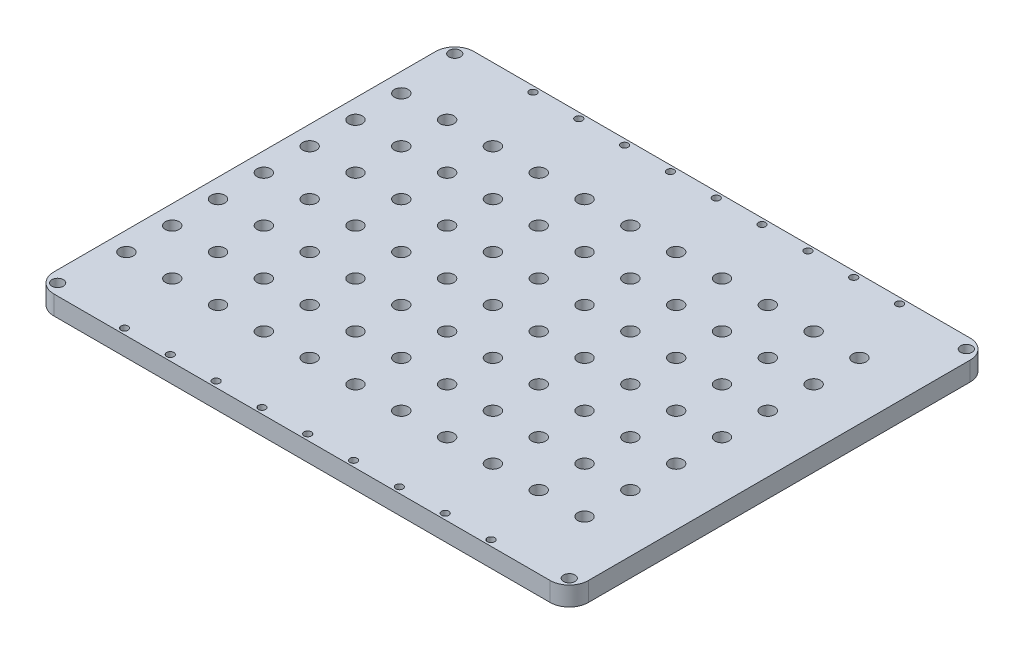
ISO-10303-21;
HEADER;
FILE_DESCRIPTION(('STEP AP214'),'2;1');
FILE_NAME('part.step','',(''),(''),'','','');
FILE_SCHEMA(('AUTOMOTIVE_DESIGN { 1 0 10303 214 1 1 1 1 }'));
ENDSEC;
DATA;
#1=APPLICATION_CONTEXT('core data for automotive mechanical design processes');
#2=APPLICATION_PROTOCOL_DEFINITION('international standard','automotive_design',2000,#1);
#3=PRODUCT_CONTEXT('',#1,'mechanical');
#4=PRODUCT('Part','Part','',(#3));
#5=PRODUCT_RELATED_PRODUCT_CATEGORY('part','',(#4));
#6=PRODUCT_DEFINITION_FORMATION('','',#4);
#7=PRODUCT_DEFINITION_CONTEXT('part definition',#1,'design');
#8=PRODUCT_DEFINITION('design','',#6,#7);
#9=PRODUCT_DEFINITION_SHAPE('','',#8);
#10=(LENGTH_UNIT() NAMED_UNIT(*) SI_UNIT(.MILLI.,.METRE.));
#11=(NAMED_UNIT(*) PLANE_ANGLE_UNIT() SI_UNIT($,.RADIAN.));
#12=(NAMED_UNIT(*) SI_UNIT($,.STERADIAN.) SOLID_ANGLE_UNIT());
#13=UNCERTAINTY_MEASURE_WITH_UNIT(LENGTH_MEASURE(1.E-05),#10,'distance_accuracy_value','');
#14=(GEOMETRIC_REPRESENTATION_CONTEXT(3) GLOBAL_UNCERTAINTY_ASSIGNED_CONTEXT((#13)) GLOBAL_UNIT_ASSIGNED_CONTEXT((#10,
#11,#12)) REPRESENTATION_CONTEXT('',''));
#15=CARTESIAN_POINT('',(0.,0.,0.));
#16=DIRECTION('',(0.,0.,1.));
#17=DIRECTION('',(1.,0.,0.));
#18=AXIS2_PLACEMENT_3D('',#15,#16,#17);
#19=CARTESIAN_POINT('',(55.,0.,-24.));
#20=DIRECTION('',(0.,1.,0.));
#21=DIRECTION('',(0.,0.,1.));
#22=AXIS2_PLACEMENT_3D('',#19,#20,#21);
#23=CYLINDRICAL_SURFACE('',#22,1.79999999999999);
#24=CARTESIAN_POINT('',(55.,0.,-24.));
#25=DIRECTION('',(0.,1.,0.));
#26=DIRECTION('',(0.,0.,1.));
#27=AXIS2_PLACEMENT_3D('',#24,#25,#26);
#28=CIRCLE('',#27,1.79999999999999);
#29=CARTESIAN_POINT('',(55.,0.,-22.2));
#30=VERTEX_POINT('',#29);
#31=EDGE_CURVE('E55',#30,#30,#28,.T.);
#32=ORIENTED_EDGE('',*,*,#31,.F.);
#33=EDGE_LOOP('',(#32));
#34=FACE_BOUND('',#33,.T.);
#35=CARTESIAN_POINT('',(55.,5.,-24.));
#36=DIRECTION('',(0.,1.,0.));
#37=DIRECTION('',(0.,0.,1.));
#38=AXIS2_PLACEMENT_3D('',#35,#36,#37);
#39=CIRCLE('',#38,1.79999999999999);
#40=CARTESIAN_POINT('',(55.,5.,-22.2));
#41=VERTEX_POINT('',#40);
#42=EDGE_CURVE('E11',#41,#41,#39,.T.);
#43=ORIENTED_EDGE('',*,*,#42,.T.);
#44=EDGE_LOOP('',(#43));
#45=FACE_BOUND('',#44,.T.);
#46=ADVANCED_FACE('F47',(#34,#45),#23,.F.);
#47=CARTESIAN_POINT('',(43.,0.,-24.));
#48=DIRECTION('',(0.,1.,0.));
#49=DIRECTION('',(0.,0.,1.));
#50=AXIS2_PLACEMENT_3D('',#47,#48,#49);
#51=CYLINDRICAL_SURFACE('',#50,1.79999999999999);
#52=CARTESIAN_POINT('',(43.,0.,-24.));
#53=DIRECTION('',(0.,1.,0.));
#54=DIRECTION('',(0.,0.,1.));
#55=AXIS2_PLACEMENT_3D('',#52,#53,#54);
#56=CIRCLE('',#55,1.79999999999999);
#57=CARTESIAN_POINT('',(43.,0.,-22.2));
#58=VERTEX_POINT('',#57);
#59=EDGE_CURVE('E686',#58,#58,#56,.T.);
#60=ORIENTED_EDGE('',*,*,#59,.F.);
#61=EDGE_LOOP('',(#60));
#62=FACE_BOUND('',#61,.T.);
#63=CARTESIAN_POINT('',(43.,5.,-24.));
#64=DIRECTION('',(0.,1.,0.));
#65=DIRECTION('',(0.,0.,1.));
#66=AXIS2_PLACEMENT_3D('',#63,#64,#65);
#67=CIRCLE('',#66,1.79999999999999);
#68=CARTESIAN_POINT('',(43.,5.,-22.2));
#69=VERTEX_POINT('',#68);
#70=EDGE_CURVE('E690',#69,#69,#67,.T.);
#71=ORIENTED_EDGE('',*,*,#70,.T.);
#72=EDGE_LOOP('',(#71));
#73=FACE_BOUND('',#72,.T.);
#74=ADVANCED_FACE('F700',(#62,#73),#51,.F.);
#75=CARTESIAN_POINT('',(31.,0.,-24.));
#76=DIRECTION('',(0.,1.,0.));
#77=DIRECTION('',(0.,0.,1.));
#78=AXIS2_PLACEMENT_3D('',#75,#76,#77);
#79=CYLINDRICAL_SURFACE('',#78,1.79999999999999);
#80=CARTESIAN_POINT('',(31.,0.,-24.));
#81=DIRECTION('',(0.,1.,0.));
#82=DIRECTION('',(0.,0.,1.));
#83=AXIS2_PLACEMENT_3D('',#80,#81,#82);
#84=CIRCLE('',#83,1.79999999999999);
#85=CARTESIAN_POINT('',(31.,0.,-22.2));
#86=VERTEX_POINT('',#85);
#87=EDGE_CURVE('E678',#86,#86,#84,.T.);
#88=ORIENTED_EDGE('',*,*,#87,.F.);
#89=EDGE_LOOP('',(#88));
#90=FACE_BOUND('',#89,.T.);
#91=CARTESIAN_POINT('',(31.,5.,-24.));
#92=DIRECTION('',(0.,1.,0.));
#93=DIRECTION('',(0.,0.,1.));
#94=AXIS2_PLACEMENT_3D('',#91,#92,#93);
#95=CIRCLE('',#94,1.79999999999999);
#96=CARTESIAN_POINT('',(31.,5.,-22.2));
#97=VERTEX_POINT('',#96);
#98=EDGE_CURVE('E682',#97,#97,#95,.T.);
#99=ORIENTED_EDGE('',*,*,#98,.T.);
#100=EDGE_LOOP('',(#99));
#101=FACE_BOUND('',#100,.T.);
#102=ADVANCED_FACE('F984',(#90,#101),#79,.F.);
#103=CARTESIAN_POINT('',(19.,0.,-24.));
#104=DIRECTION('',(0.,1.,0.));
#105=DIRECTION('',(0.,0.,1.));
#106=AXIS2_PLACEMENT_3D('',#103,#104,#105);
#107=CYLINDRICAL_SURFACE('',#106,1.79999999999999);
#108=CARTESIAN_POINT('',(19.,0.,-24.));
#109=DIRECTION('',(0.,1.,0.));
#110=DIRECTION('',(0.,0.,1.));
#111=AXIS2_PLACEMENT_3D('',#108,#109,#110);
#112=CIRCLE('',#111,1.79999999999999);
#113=CARTESIAN_POINT('',(19.,0.,-22.2));
#114=VERTEX_POINT('',#113);
#115=EDGE_CURVE('E670',#114,#114,#112,.T.);
#116=ORIENTED_EDGE('',*,*,#115,.F.);
#117=EDGE_LOOP('',(#116));
#118=FACE_BOUND('',#117,.T.);
#119=CARTESIAN_POINT('',(19.,5.,-24.));
#120=DIRECTION('',(0.,1.,0.));
#121=DIRECTION('',(0.,0.,1.));
#122=AXIS2_PLACEMENT_3D('',#119,#120,#121);
#123=CIRCLE('',#122,1.79999999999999);
#124=CARTESIAN_POINT('',(19.,5.,-22.2));
#125=VERTEX_POINT('',#124);
#126=EDGE_CURVE('E674',#125,#125,#123,.T.);
#127=ORIENTED_EDGE('',*,*,#126,.T.);
#128=EDGE_LOOP('',(#127));
#129=FACE_BOUND('',#128,.T.);
#130=ADVANCED_FACE('F980',(#118,#129),#107,.F.);
#131=CARTESIAN_POINT('',(7.00000000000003,0.,-24.));
#132=DIRECTION('',(0.,1.,0.));
#133=DIRECTION('',(0.,0.,1.));
#134=AXIS2_PLACEMENT_3D('',#131,#132,#133);
#135=CYLINDRICAL_SURFACE('',#134,1.79999999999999);
#136=CARTESIAN_POINT('',(7.00000000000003,0.,-24.));
#137=DIRECTION('',(0.,1.,0.));
#138=DIRECTION('',(0.,0.,1.));
#139=AXIS2_PLACEMENT_3D('',#136,#137,#138);
#140=CIRCLE('',#139,1.79999999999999);
#141=CARTESIAN_POINT('',(7.00000000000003,0.,-22.2));
#142=VERTEX_POINT('',#141);
#143=EDGE_CURVE('E662',#142,#142,#140,.T.);
#144=ORIENTED_EDGE('',*,*,#143,.F.);
#145=EDGE_LOOP('',(#144));
#146=FACE_BOUND('',#145,.T.);
#147=CARTESIAN_POINT('',(7.00000000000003,5.,-24.));
#148=DIRECTION('',(0.,1.,0.));
#149=DIRECTION('',(0.,0.,1.));
#150=AXIS2_PLACEMENT_3D('',#147,#148,#149);
#151=CIRCLE('',#150,1.79999999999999);
#152=CARTESIAN_POINT('',(7.00000000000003,5.,-22.2));
#153=VERTEX_POINT('',#152);
#154=EDGE_CURVE('E666',#153,#153,#151,.T.);
#155=ORIENTED_EDGE('',*,*,#154,.T.);
#156=EDGE_LOOP('',(#155));
#157=FACE_BOUND('',#156,.T.);
#158=ADVANCED_FACE('F976',(#146,#157),#135,.F.);
#159=CARTESIAN_POINT('',(-4.99999999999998,0.,-24.));
#160=DIRECTION('',(0.,1.,0.));
#161=DIRECTION('',(0.,0.,1.));
#162=AXIS2_PLACEMENT_3D('',#159,#160,#161);
#163=CYLINDRICAL_SURFACE('',#162,1.79999999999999);
#164=CARTESIAN_POINT('',(-4.99999999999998,0.,-24.));
#165=DIRECTION('',(0.,1.,0.));
#166=DIRECTION('',(0.,0.,1.));
#167=AXIS2_PLACEMENT_3D('',#164,#165,#166);
#168=CIRCLE('',#167,1.79999999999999);
#169=CARTESIAN_POINT('',(-4.99999999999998,0.,-22.2));
#170=VERTEX_POINT('',#169);
#171=EDGE_CURVE('E654',#170,#170,#168,.T.);
#172=ORIENTED_EDGE('',*,*,#171,.F.);
#173=EDGE_LOOP('',(#172));
#174=FACE_BOUND('',#173,.T.);
#175=CARTESIAN_POINT('',(-4.99999999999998,5.,-24.));
#176=DIRECTION('',(0.,1.,0.));
#177=DIRECTION('',(0.,0.,1.));
#178=AXIS2_PLACEMENT_3D('',#175,#176,#177);
#179=CIRCLE('',#178,1.79999999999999);
#180=CARTESIAN_POINT('',(-4.99999999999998,5.,-22.2));
#181=VERTEX_POINT('',#180);
#182=EDGE_CURVE('E658',#181,#181,#179,.T.);
#183=ORIENTED_EDGE('',*,*,#182,.T.);
#184=EDGE_LOOP('',(#183));
#185=FACE_BOUND('',#184,.T.);
#186=ADVANCED_FACE('F972',(#174,#185),#163,.F.);
#187=CARTESIAN_POINT('',(-17.,0.,-24.));
#188=DIRECTION('',(0.,1.,0.));
#189=DIRECTION('',(0.,0.,1.));
#190=AXIS2_PLACEMENT_3D('',#187,#188,#189);
#191=CYLINDRICAL_SURFACE('',#190,1.79999999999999);
#192=CARTESIAN_POINT('',(-17.,0.,-24.));
#193=DIRECTION('',(0.,1.,0.));
#194=DIRECTION('',(0.,0.,1.));
#195=AXIS2_PLACEMENT_3D('',#192,#193,#194);
#196=CIRCLE('',#195,1.79999999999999);
#197=CARTESIAN_POINT('',(-17.,0.,-22.2));
#198=VERTEX_POINT('',#197);
#199=EDGE_CURVE('E646',#198,#198,#196,.T.);
#200=ORIENTED_EDGE('',*,*,#199,.F.);
#201=EDGE_LOOP('',(#200));
#202=FACE_BOUND('',#201,.T.);
#203=CARTESIAN_POINT('',(-17.,5.,-24.));
#204=DIRECTION('',(0.,1.,0.));
#205=DIRECTION('',(0.,0.,1.));
#206=AXIS2_PLACEMENT_3D('',#203,#204,#205);
#207=CIRCLE('',#206,1.79999999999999);
#208=CARTESIAN_POINT('',(-17.,5.,-22.2));
#209=VERTEX_POINT('',#208);
#210=EDGE_CURVE('E650',#209,#209,#207,.T.);
#211=ORIENTED_EDGE('',*,*,#210,.T.);
#212=EDGE_LOOP('',(#211));
#213=FACE_BOUND('',#212,.T.);
#214=ADVANCED_FACE('F968',(#202,#213),#191,.F.);
#215=CARTESIAN_POINT('',(-29.,0.,-24.));
#216=DIRECTION('',(0.,1.,0.));
#217=DIRECTION('',(0.,0.,1.));
#218=AXIS2_PLACEMENT_3D('',#215,#216,#217);
#219=CYLINDRICAL_SURFACE('',#218,1.79999999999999);
#220=CARTESIAN_POINT('',(-29.,0.,-24.));
#221=DIRECTION('',(0.,1.,0.));
#222=DIRECTION('',(0.,0.,1.));
#223=AXIS2_PLACEMENT_3D('',#220,#221,#222);
#224=CIRCLE('',#223,1.79999999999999);
#225=CARTESIAN_POINT('',(-29.,0.,-22.2));
#226=VERTEX_POINT('',#225);
#227=EDGE_CURVE('E638',#226,#226,#224,.T.);
#228=ORIENTED_EDGE('',*,*,#227,.F.);
#229=EDGE_LOOP('',(#228));
#230=FACE_BOUND('',#229,.T.);
#231=CARTESIAN_POINT('',(-29.,5.,-24.));
#232=DIRECTION('',(0.,1.,0.));
#233=DIRECTION('',(0.,0.,1.));
#234=AXIS2_PLACEMENT_3D('',#231,#232,#233);
#235=CIRCLE('',#234,1.79999999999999);
#236=CARTESIAN_POINT('',(-29.,5.,-22.2));
#237=VERTEX_POINT('',#236);
#238=EDGE_CURVE('E642',#237,#237,#235,.T.);
#239=ORIENTED_EDGE('',*,*,#238,.T.);
#240=EDGE_LOOP('',(#239));
#241=FACE_BOUND('',#240,.T.);
#242=ADVANCED_FACE('F964',(#230,#241),#219,.F.);
#243=CARTESIAN_POINT('',(-41.,0.,-24.));
#244=DIRECTION('',(0.,1.,0.));
#245=DIRECTION('',(0.,0.,1.));
#246=AXIS2_PLACEMENT_3D('',#243,#244,#245);
#247=CYLINDRICAL_SURFACE('',#246,1.79999999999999);
#248=CARTESIAN_POINT('',(-41.,0.,-24.));
#249=DIRECTION('',(0.,1.,0.));
#250=DIRECTION('',(0.,0.,1.));
#251=AXIS2_PLACEMENT_3D('',#248,#249,#250);
#252=CIRCLE('',#251,1.79999999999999);
#253=CARTESIAN_POINT('',(-41.,0.,-22.2));
#254=VERTEX_POINT('',#253);
#255=EDGE_CURVE('E630',#254,#254,#252,.T.);
#256=ORIENTED_EDGE('',*,*,#255,.F.);
#257=EDGE_LOOP('',(#256));
#258=FACE_BOUND('',#257,.T.);
#259=CARTESIAN_POINT('',(-41.,5.,-24.));
#260=DIRECTION('',(0.,1.,0.));
#261=DIRECTION('',(0.,0.,1.));
#262=AXIS2_PLACEMENT_3D('',#259,#260,#261);
#263=CIRCLE('',#262,1.79999999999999);
#264=CARTESIAN_POINT('',(-41.,5.,-22.2));
#265=VERTEX_POINT('',#264);
#266=EDGE_CURVE('E634',#265,#265,#263,.T.);
#267=ORIENTED_EDGE('',*,*,#266,.T.);
#268=EDGE_LOOP('',(#267));
#269=FACE_BOUND('',#268,.T.);
#270=ADVANCED_FACE('F960',(#258,#269),#247,.F.);
#271=CARTESIAN_POINT('',(55.,0.,-12.));
#272=DIRECTION('',(0.,1.,0.));
#273=DIRECTION('',(0.,0.,1.));
#274=AXIS2_PLACEMENT_3D('',#271,#272,#273);
#275=CYLINDRICAL_SURFACE('',#274,1.79999999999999);
#276=CARTESIAN_POINT('',(55.,0.,-12.));
#277=DIRECTION('',(0.,1.,0.));
#278=DIRECTION('',(0.,0.,1.));
#279=AXIS2_PLACEMENT_3D('',#276,#277,#278);
#280=CIRCLE('',#279,1.79999999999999);
#281=CARTESIAN_POINT('',(55.,0.,-10.2));
#282=VERTEX_POINT('',#281);
#283=EDGE_CURVE('E622',#282,#282,#280,.T.);
#284=ORIENTED_EDGE('',*,*,#283,.F.);
#285=EDGE_LOOP('',(#284));
#286=FACE_BOUND('',#285,.T.);
#287=CARTESIAN_POINT('',(55.,5.,-12.));
#288=DIRECTION('',(0.,1.,0.));
#289=DIRECTION('',(0.,0.,1.));
#290=AXIS2_PLACEMENT_3D('',#287,#288,#289);
#291=CIRCLE('',#290,1.79999999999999);
#292=CARTESIAN_POINT('',(55.,5.,-10.2));
#293=VERTEX_POINT('',#292);
#294=EDGE_CURVE('E626',#293,#293,#291,.T.);
#295=ORIENTED_EDGE('',*,*,#294,.T.);
#296=EDGE_LOOP('',(#295));
#297=FACE_BOUND('',#296,.T.);
#298=ADVANCED_FACE('F956',(#286,#297),#275,.F.);
#299=CARTESIAN_POINT('',(43.,0.,-12.));
#300=DIRECTION('',(0.,1.,0.));
#301=DIRECTION('',(0.,0.,1.));
#302=AXIS2_PLACEMENT_3D('',#299,#300,#301);
#303=CYLINDRICAL_SURFACE('',#302,1.79999999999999);
#304=CARTESIAN_POINT('',(43.,0.,-12.));
#305=DIRECTION('',(0.,1.,0.));
#306=DIRECTION('',(0.,0.,1.));
#307=AXIS2_PLACEMENT_3D('',#304,#305,#306);
#308=CIRCLE('',#307,1.79999999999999);
#309=CARTESIAN_POINT('',(43.,0.,-10.2));
#310=VERTEX_POINT('',#309);
#311=EDGE_CURVE('E614',#310,#310,#308,.T.);
#312=ORIENTED_EDGE('',*,*,#311,.F.);
#313=EDGE_LOOP('',(#312));
#314=FACE_BOUND('',#313,.T.);
#315=CARTESIAN_POINT('',(43.,5.,-12.));
#316=DIRECTION('',(0.,1.,0.));
#317=DIRECTION('',(0.,0.,1.));
#318=AXIS2_PLACEMENT_3D('',#315,#316,#317);
#319=CIRCLE('',#318,1.79999999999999);
#320=CARTESIAN_POINT('',(43.,5.,-10.2));
#321=VERTEX_POINT('',#320);
#322=EDGE_CURVE('E618',#321,#321,#319,.T.);
#323=ORIENTED_EDGE('',*,*,#322,.T.);
#324=EDGE_LOOP('',(#323));
#325=FACE_BOUND('',#324,.T.);
#326=ADVANCED_FACE('F952',(#314,#325),#303,.F.);
#327=CARTESIAN_POINT('',(31.,0.,-12.));
#328=DIRECTION('',(0.,1.,0.));
#329=DIRECTION('',(0.,0.,1.));
#330=AXIS2_PLACEMENT_3D('',#327,#328,#329);
#331=CYLINDRICAL_SURFACE('',#330,1.79999999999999);
#332=CARTESIAN_POINT('',(31.,0.,-12.));
#333=DIRECTION('',(0.,1.,0.));
#334=DIRECTION('',(0.,0.,1.));
#335=AXIS2_PLACEMENT_3D('',#332,#333,#334);
#336=CIRCLE('',#335,1.79999999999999);
#337=CARTESIAN_POINT('',(31.,0.,-10.2));
#338=VERTEX_POINT('',#337);
#339=EDGE_CURVE('E606',#338,#338,#336,.T.);
#340=ORIENTED_EDGE('',*,*,#339,.F.);
#341=EDGE_LOOP('',(#340));
#342=FACE_BOUND('',#341,.T.);
#343=CARTESIAN_POINT('',(31.,5.,-12.));
#344=DIRECTION('',(0.,1.,0.));
#345=DIRECTION('',(0.,0.,1.));
#346=AXIS2_PLACEMENT_3D('',#343,#344,#345);
#347=CIRCLE('',#346,1.79999999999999);
#348=CARTESIAN_POINT('',(31.,5.,-10.2));
#349=VERTEX_POINT('',#348);
#350=EDGE_CURVE('E610',#349,#349,#347,.T.);
#351=ORIENTED_EDGE('',*,*,#350,.T.);
#352=EDGE_LOOP('',(#351));
#353=FACE_BOUND('',#352,.T.);
#354=ADVANCED_FACE('F948',(#342,#353),#331,.F.);
#355=CARTESIAN_POINT('',(19.,0.,-12.));
#356=DIRECTION('',(0.,1.,0.));
#357=DIRECTION('',(0.,0.,1.));
#358=AXIS2_PLACEMENT_3D('',#355,#356,#357);
#359=CYLINDRICAL_SURFACE('',#358,1.79999999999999);
#360=CARTESIAN_POINT('',(19.,0.,-12.));
#361=DIRECTION('',(0.,1.,0.));
#362=DIRECTION('',(0.,0.,1.));
#363=AXIS2_PLACEMENT_3D('',#360,#361,#362);
#364=CIRCLE('',#363,1.79999999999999);
#365=CARTESIAN_POINT('',(19.,0.,-10.2));
#366=VERTEX_POINT('',#365);
#367=EDGE_CURVE('E598',#366,#366,#364,.T.);
#368=ORIENTED_EDGE('',*,*,#367,.F.);
#369=EDGE_LOOP('',(#368));
#370=FACE_BOUND('',#369,.T.);
#371=CARTESIAN_POINT('',(19.,5.,-12.));
#372=DIRECTION('',(0.,1.,0.));
#373=DIRECTION('',(0.,0.,1.));
#374=AXIS2_PLACEMENT_3D('',#371,#372,#373);
#375=CIRCLE('',#374,1.79999999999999);
#376=CARTESIAN_POINT('',(19.,5.,-10.2));
#377=VERTEX_POINT('',#376);
#378=EDGE_CURVE('E602',#377,#377,#375,.T.);
#379=ORIENTED_EDGE('',*,*,#378,.T.);
#380=EDGE_LOOP('',(#379));
#381=FACE_BOUND('',#380,.T.);
#382=ADVANCED_FACE('F944',(#370,#381),#359,.F.);
#383=CARTESIAN_POINT('',(7.00000000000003,0.,-12.));
#384=DIRECTION('',(0.,1.,0.));
#385=DIRECTION('',(0.,0.,1.));
#386=AXIS2_PLACEMENT_3D('',#383,#384,#385);
#387=CYLINDRICAL_SURFACE('',#386,1.79999999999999);
#388=CARTESIAN_POINT('',(7.00000000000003,0.,-12.));
#389=DIRECTION('',(0.,1.,0.));
#390=DIRECTION('',(0.,0.,1.));
#391=AXIS2_PLACEMENT_3D('',#388,#389,#390);
#392=CIRCLE('',#391,1.79999999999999);
#393=CARTESIAN_POINT('',(7.00000000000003,0.,-10.2));
#394=VERTEX_POINT('',#393);
#395=EDGE_CURVE('E590',#394,#394,#392,.T.);
#396=ORIENTED_EDGE('',*,*,#395,.F.);
#397=EDGE_LOOP('',(#396));
#398=FACE_BOUND('',#397,.T.);
#399=CARTESIAN_POINT('',(7.00000000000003,5.,-12.));
#400=DIRECTION('',(0.,1.,0.));
#401=DIRECTION('',(0.,0.,1.));
#402=AXIS2_PLACEMENT_3D('',#399,#400,#401);
#403=CIRCLE('',#402,1.79999999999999);
#404=CARTESIAN_POINT('',(7.00000000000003,5.,-10.2));
#405=VERTEX_POINT('',#404);
#406=EDGE_CURVE('E594',#405,#405,#403,.T.);
#407=ORIENTED_EDGE('',*,*,#406,.T.);
#408=EDGE_LOOP('',(#407));
#409=FACE_BOUND('',#408,.T.);
#410=ADVANCED_FACE('F940',(#398,#409),#387,.F.);
#411=CARTESIAN_POINT('',(-4.99999999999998,0.,-12.));
#412=DIRECTION('',(0.,1.,0.));
#413=DIRECTION('',(0.,0.,1.));
#414=AXIS2_PLACEMENT_3D('',#411,#412,#413);
#415=CYLINDRICAL_SURFACE('',#414,1.79999999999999);
#416=CARTESIAN_POINT('',(-4.99999999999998,0.,-12.));
#417=DIRECTION('',(0.,1.,0.));
#418=DIRECTION('',(0.,0.,1.));
#419=AXIS2_PLACEMENT_3D('',#416,#417,#418);
#420=CIRCLE('',#419,1.79999999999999);
#421=CARTESIAN_POINT('',(-4.99999999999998,0.,-10.2));
#422=VERTEX_POINT('',#421);
#423=EDGE_CURVE('E582',#422,#422,#420,.T.);
#424=ORIENTED_EDGE('',*,*,#423,.F.);
#425=EDGE_LOOP('',(#424));
#426=FACE_BOUND('',#425,.T.);
#427=CARTESIAN_POINT('',(-4.99999999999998,5.,-12.));
#428=DIRECTION('',(0.,1.,0.));
#429=DIRECTION('',(0.,0.,1.));
#430=AXIS2_PLACEMENT_3D('',#427,#428,#429);
#431=CIRCLE('',#430,1.79999999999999);
#432=CARTESIAN_POINT('',(-4.99999999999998,5.,-10.2));
#433=VERTEX_POINT('',#432);
#434=EDGE_CURVE('E586',#433,#433,#431,.T.);
#435=ORIENTED_EDGE('',*,*,#434,.T.);
#436=EDGE_LOOP('',(#435));
#437=FACE_BOUND('',#436,.T.);
#438=ADVANCED_FACE('F936',(#426,#437),#415,.F.);
#439=CARTESIAN_POINT('',(-17.,0.,-12.));
#440=DIRECTION('',(0.,1.,0.));
#441=DIRECTION('',(0.,0.,1.));
#442=AXIS2_PLACEMENT_3D('',#439,#440,#441);
#443=CYLINDRICAL_SURFACE('',#442,1.79999999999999);
#444=CARTESIAN_POINT('',(-17.,0.,-12.));
#445=DIRECTION('',(0.,1.,0.));
#446=DIRECTION('',(0.,0.,1.));
#447=AXIS2_PLACEMENT_3D('',#444,#445,#446);
#448=CIRCLE('',#447,1.79999999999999);
#449=CARTESIAN_POINT('',(-17.,0.,-10.2));
#450=VERTEX_POINT('',#449);
#451=EDGE_CURVE('E574',#450,#450,#448,.T.);
#452=ORIENTED_EDGE('',*,*,#451,.F.);
#453=EDGE_LOOP('',(#452));
#454=FACE_BOUND('',#453,.T.);
#455=CARTESIAN_POINT('',(-17.,5.,-12.));
#456=DIRECTION('',(0.,1.,0.));
#457=DIRECTION('',(0.,0.,1.));
#458=AXIS2_PLACEMENT_3D('',#455,#456,#457);
#459=CIRCLE('',#458,1.79999999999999);
#460=CARTESIAN_POINT('',(-17.,5.,-10.2));
#461=VERTEX_POINT('',#460);
#462=EDGE_CURVE('E578',#461,#461,#459,.T.);
#463=ORIENTED_EDGE('',*,*,#462,.T.);
#464=EDGE_LOOP('',(#463));
#465=FACE_BOUND('',#464,.T.);
#466=ADVANCED_FACE('F932',(#454,#465),#443,.F.);
#467=CARTESIAN_POINT('',(-29.,0.,-12.));
#468=DIRECTION('',(0.,1.,0.));
#469=DIRECTION('',(0.,0.,1.));
#470=AXIS2_PLACEMENT_3D('',#467,#468,#469);
#471=CYLINDRICAL_SURFACE('',#470,1.79999999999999);
#472=CARTESIAN_POINT('',(-29.,0.,-12.));
#473=DIRECTION('',(0.,1.,0.));
#474=DIRECTION('',(0.,0.,1.));
#475=AXIS2_PLACEMENT_3D('',#472,#473,#474);
#476=CIRCLE('',#475,1.79999999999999);
#477=CARTESIAN_POINT('',(-29.,0.,-10.2));
#478=VERTEX_POINT('',#477);
#479=EDGE_CURVE('E566',#478,#478,#476,.T.);
#480=ORIENTED_EDGE('',*,*,#479,.F.);
#481=EDGE_LOOP('',(#480));
#482=FACE_BOUND('',#481,.T.);
#483=CARTESIAN_POINT('',(-29.,5.,-12.));
#484=DIRECTION('',(0.,1.,0.));
#485=DIRECTION('',(0.,0.,1.));
#486=AXIS2_PLACEMENT_3D('',#483,#484,#485);
#487=CIRCLE('',#486,1.79999999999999);
#488=CARTESIAN_POINT('',(-29.,5.,-10.2));
#489=VERTEX_POINT('',#488);
#490=EDGE_CURVE('E570',#489,#489,#487,.T.);
#491=ORIENTED_EDGE('',*,*,#490,.T.);
#492=EDGE_LOOP('',(#491));
#493=FACE_BOUND('',#492,.T.);
#494=ADVANCED_FACE('F928',(#482,#493),#471,.F.);
#495=CARTESIAN_POINT('',(-41.,0.,-12.));
#496=DIRECTION('',(0.,1.,0.));
#497=DIRECTION('',(0.,0.,1.));
#498=AXIS2_PLACEMENT_3D('',#495,#496,#497);
#499=CYLINDRICAL_SURFACE('',#498,1.79999999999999);
#500=CARTESIAN_POINT('',(-41.,0.,-12.));
#501=DIRECTION('',(0.,1.,0.));
#502=DIRECTION('',(0.,0.,1.));
#503=AXIS2_PLACEMENT_3D('',#500,#501,#502);
#504=CIRCLE('',#503,1.79999999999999);
#505=CARTESIAN_POINT('',(-41.,0.,-10.2));
#506=VERTEX_POINT('',#505);
#507=EDGE_CURVE('E558',#506,#506,#504,.T.);
#508=ORIENTED_EDGE('',*,*,#507,.F.);
#509=EDGE_LOOP('',(#508));
#510=FACE_BOUND('',#509,.T.);
#511=CARTESIAN_POINT('',(-41.,5.,-12.));
#512=DIRECTION('',(0.,1.,0.));
#513=DIRECTION('',(0.,0.,1.));
#514=AXIS2_PLACEMENT_3D('',#511,#512,#513);
#515=CIRCLE('',#514,1.79999999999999);
#516=CARTESIAN_POINT('',(-41.,5.,-10.2));
#517=VERTEX_POINT('',#516);
#518=EDGE_CURVE('E562',#517,#517,#515,.T.);
#519=ORIENTED_EDGE('',*,*,#518,.T.);
#520=EDGE_LOOP('',(#519));
#521=FACE_BOUND('',#520,.T.);
#522=ADVANCED_FACE('F924',(#510,#521),#499,.F.);
#523=CARTESIAN_POINT('',(55.,0.,0.));
#524=DIRECTION('',(0.,1.,0.));
#525=DIRECTION('',(0.,0.,1.));
#526=AXIS2_PLACEMENT_3D('',#523,#524,#525);
#527=CYLINDRICAL_SURFACE('',#526,1.79999999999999);
#528=CARTESIAN_POINT('',(55.,0.,0.));
#529=DIRECTION('',(0.,1.,0.));
#530=DIRECTION('',(0.,0.,1.));
#531=AXIS2_PLACEMENT_3D('',#528,#529,#530);
#532=CIRCLE('',#531,1.79999999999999);
#533=CARTESIAN_POINT('',(55.,0.,1.79999999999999));
#534=VERTEX_POINT('',#533);
#535=EDGE_CURVE('E550',#534,#534,#532,.T.);
#536=ORIENTED_EDGE('',*,*,#535,.F.);
#537=EDGE_LOOP('',(#536));
#538=FACE_BOUND('',#537,.T.);
#539=CARTESIAN_POINT('',(55.,5.,0.));
#540=DIRECTION('',(0.,1.,0.));
#541=DIRECTION('',(0.,0.,1.));
#542=AXIS2_PLACEMENT_3D('',#539,#540,#541);
#543=CIRCLE('',#542,1.79999999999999);
#544=CARTESIAN_POINT('',(55.,5.,1.79999999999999));
#545=VERTEX_POINT('',#544);
#546=EDGE_CURVE('E554',#545,#545,#543,.T.);
#547=ORIENTED_EDGE('',*,*,#546,.T.);
#548=EDGE_LOOP('',(#547));
#549=FACE_BOUND('',#548,.T.);
#550=ADVANCED_FACE('F920',(#538,#549),#527,.F.);
#551=CARTESIAN_POINT('',(43.,0.,0.));
#552=DIRECTION('',(0.,1.,0.));
#553=DIRECTION('',(0.,0.,1.));
#554=AXIS2_PLACEMENT_3D('',#551,#552,#553);
#555=CYLINDRICAL_SURFACE('',#554,1.79999999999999);
#556=CARTESIAN_POINT('',(43.,0.,0.));
#557=DIRECTION('',(0.,1.,0.));
#558=DIRECTION('',(0.,0.,1.));
#559=AXIS2_PLACEMENT_3D('',#556,#557,#558);
#560=CIRCLE('',#559,1.79999999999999);
#561=CARTESIAN_POINT('',(43.,0.,1.79999999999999));
#562=VERTEX_POINT('',#561);
#563=EDGE_CURVE('E542',#562,#562,#560,.T.);
#564=ORIENTED_EDGE('',*,*,#563,.F.);
#565=EDGE_LOOP('',(#564));
#566=FACE_BOUND('',#565,.T.);
#567=CARTESIAN_POINT('',(43.,5.,0.));
#568=DIRECTION('',(0.,1.,0.));
#569=DIRECTION('',(0.,0.,1.));
#570=AXIS2_PLACEMENT_3D('',#567,#568,#569);
#571=CIRCLE('',#570,1.79999999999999);
#572=CARTESIAN_POINT('',(43.,5.,1.79999999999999));
#573=VERTEX_POINT('',#572);
#574=EDGE_CURVE('E546',#573,#573,#571,.T.);
#575=ORIENTED_EDGE('',*,*,#574,.T.);
#576=EDGE_LOOP('',(#575));
#577=FACE_BOUND('',#576,.T.);
#578=ADVANCED_FACE('F916',(#566,#577),#555,.F.);
#579=CARTESIAN_POINT('',(31.,0.,0.));
#580=DIRECTION('',(0.,1.,0.));
#581=DIRECTION('',(0.,0.,1.));
#582=AXIS2_PLACEMENT_3D('',#579,#580,#581);
#583=CYLINDRICAL_SURFACE('',#582,1.79999999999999);
#584=CARTESIAN_POINT('',(31.,0.,0.));
#585=DIRECTION('',(0.,1.,0.));
#586=DIRECTION('',(0.,0.,1.));
#587=AXIS2_PLACEMENT_3D('',#584,#585,#586);
#588=CIRCLE('',#587,1.79999999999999);
#589=CARTESIAN_POINT('',(31.,0.,1.79999999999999));
#590=VERTEX_POINT('',#589);
#591=EDGE_CURVE('E534',#590,#590,#588,.T.);
#592=ORIENTED_EDGE('',*,*,#591,.F.);
#593=EDGE_LOOP('',(#592));
#594=FACE_BOUND('',#593,.T.);
#595=CARTESIAN_POINT('',(31.,5.,0.));
#596=DIRECTION('',(0.,1.,0.));
#597=DIRECTION('',(0.,0.,1.));
#598=AXIS2_PLACEMENT_3D('',#595,#596,#597);
#599=CIRCLE('',#598,1.79999999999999);
#600=CARTESIAN_POINT('',(31.,5.,1.79999999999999));
#601=VERTEX_POINT('',#600);
#602=EDGE_CURVE('E538',#601,#601,#599,.T.);
#603=ORIENTED_EDGE('',*,*,#602,.T.);
#604=EDGE_LOOP('',(#603));
#605=FACE_BOUND('',#604,.T.);
#606=ADVANCED_FACE('F912',(#594,#605),#583,.F.);
#607=CARTESIAN_POINT('',(19.,0.,0.));
#608=DIRECTION('',(0.,1.,0.));
#609=DIRECTION('',(0.,0.,1.));
#610=AXIS2_PLACEMENT_3D('',#607,#608,#609);
#611=CYLINDRICAL_SURFACE('',#610,1.79999999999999);
#612=CARTESIAN_POINT('',(19.,0.,0.));
#613=DIRECTION('',(0.,1.,0.));
#614=DIRECTION('',(0.,0.,1.));
#615=AXIS2_PLACEMENT_3D('',#612,#613,#614);
#616=CIRCLE('',#615,1.79999999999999);
#617=CARTESIAN_POINT('',(19.,0.,1.79999999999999));
#618=VERTEX_POINT('',#617);
#619=EDGE_CURVE('E526',#618,#618,#616,.T.);
#620=ORIENTED_EDGE('',*,*,#619,.F.);
#621=EDGE_LOOP('',(#620));
#622=FACE_BOUND('',#621,.T.);
#623=CARTESIAN_POINT('',(19.,5.,0.));
#624=DIRECTION('',(0.,1.,0.));
#625=DIRECTION('',(0.,0.,1.));
#626=AXIS2_PLACEMENT_3D('',#623,#624,#625);
#627=CIRCLE('',#626,1.79999999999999);
#628=CARTESIAN_POINT('',(19.,5.,1.79999999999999));
#629=VERTEX_POINT('',#628);
#630=EDGE_CURVE('E530',#629,#629,#627,.T.);
#631=ORIENTED_EDGE('',*,*,#630,.T.);
#632=EDGE_LOOP('',(#631));
#633=FACE_BOUND('',#632,.T.);
#634=ADVANCED_FACE('F908',(#622,#633),#611,.F.);
#635=CARTESIAN_POINT('',(7.00000000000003,0.,0.));
#636=DIRECTION('',(0.,1.,0.));
#637=DIRECTION('',(0.,0.,1.));
#638=AXIS2_PLACEMENT_3D('',#635,#636,#637);
#639=CYLINDRICAL_SURFACE('',#638,1.79999999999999);
#640=CARTESIAN_POINT('',(7.00000000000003,0.,0.));
#641=DIRECTION('',(0.,1.,0.));
#642=DIRECTION('',(0.,0.,1.));
#643=AXIS2_PLACEMENT_3D('',#640,#641,#642);
#644=CIRCLE('',#643,1.79999999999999);
#645=CARTESIAN_POINT('',(7.00000000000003,0.,1.79999999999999));
#646=VERTEX_POINT('',#645);
#647=EDGE_CURVE('E518',#646,#646,#644,.T.);
#648=ORIENTED_EDGE('',*,*,#647,.F.);
#649=EDGE_LOOP('',(#648));
#650=FACE_BOUND('',#649,.T.);
#651=CARTESIAN_POINT('',(7.00000000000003,5.,0.));
#652=DIRECTION('',(0.,1.,0.));
#653=DIRECTION('',(0.,0.,1.));
#654=AXIS2_PLACEMENT_3D('',#651,#652,#653);
#655=CIRCLE('',#654,1.79999999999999);
#656=CARTESIAN_POINT('',(7.00000000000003,5.,1.79999999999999));
#657=VERTEX_POINT('',#656);
#658=EDGE_CURVE('E522',#657,#657,#655,.T.);
#659=ORIENTED_EDGE('',*,*,#658,.T.);
#660=EDGE_LOOP('',(#659));
#661=FACE_BOUND('',#660,.T.);
#662=ADVANCED_FACE('F904',(#650,#661),#639,.F.);
#663=CARTESIAN_POINT('',(-4.99999999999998,0.,0.));
#664=DIRECTION('',(0.,1.,0.));
#665=DIRECTION('',(0.,0.,1.));
#666=AXIS2_PLACEMENT_3D('',#663,#664,#665);
#667=CYLINDRICAL_SURFACE('',#666,1.79999999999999);
#668=CARTESIAN_POINT('',(-4.99999999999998,0.,0.));
#669=DIRECTION('',(0.,1.,0.));
#670=DIRECTION('',(0.,0.,1.));
#671=AXIS2_PLACEMENT_3D('',#668,#669,#670);
#672=CIRCLE('',#671,1.79999999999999);
#673=CARTESIAN_POINT('',(-4.99999999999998,0.,1.79999999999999));
#674=VERTEX_POINT('',#673);
#675=EDGE_CURVE('E510',#674,#674,#672,.T.);
#676=ORIENTED_EDGE('',*,*,#675,.F.);
#677=EDGE_LOOP('',(#676));
#678=FACE_BOUND('',#677,.T.);
#679=CARTESIAN_POINT('',(-4.99999999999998,5.,0.));
#680=DIRECTION('',(0.,1.,0.));
#681=DIRECTION('',(0.,0.,1.));
#682=AXIS2_PLACEMENT_3D('',#679,#680,#681);
#683=CIRCLE('',#682,1.79999999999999);
#684=CARTESIAN_POINT('',(-4.99999999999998,5.,1.79999999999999));
#685=VERTEX_POINT('',#684);
#686=EDGE_CURVE('E514',#685,#685,#683,.T.);
#687=ORIENTED_EDGE('',*,*,#686,.T.);
#688=EDGE_LOOP('',(#687));
#689=FACE_BOUND('',#688,.T.);
#690=ADVANCED_FACE('F900',(#678,#689),#667,.F.);
#691=CARTESIAN_POINT('',(-17.,0.,0.));
#692=DIRECTION('',(0.,1.,0.));
#693=DIRECTION('',(0.,0.,1.));
#694=AXIS2_PLACEMENT_3D('',#691,#692,#693);
#695=CYLINDRICAL_SURFACE('',#694,1.79999999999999);
#696=CARTESIAN_POINT('',(-17.,0.,0.));
#697=DIRECTION('',(0.,1.,0.));
#698=DIRECTION('',(0.,0.,1.));
#699=AXIS2_PLACEMENT_3D('',#696,#697,#698);
#700=CIRCLE('',#699,1.79999999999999);
#701=CARTESIAN_POINT('',(-17.,0.,1.79999999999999));
#702=VERTEX_POINT('',#701);
#703=EDGE_CURVE('E502',#702,#702,#700,.T.);
#704=ORIENTED_EDGE('',*,*,#703,.F.);
#705=EDGE_LOOP('',(#704));
#706=FACE_BOUND('',#705,.T.);
#707=CARTESIAN_POINT('',(-17.,5.,0.));
#708=DIRECTION('',(0.,1.,0.));
#709=DIRECTION('',(0.,0.,1.));
#710=AXIS2_PLACEMENT_3D('',#707,#708,#709);
#711=CIRCLE('',#710,1.79999999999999);
#712=CARTESIAN_POINT('',(-17.,5.,1.79999999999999));
#713=VERTEX_POINT('',#712);
#714=EDGE_CURVE('E506',#713,#713,#711,.T.);
#715=ORIENTED_EDGE('',*,*,#714,.T.);
#716=EDGE_LOOP('',(#715));
#717=FACE_BOUND('',#716,.T.);
#718=ADVANCED_FACE('F896',(#706,#717),#695,.F.);
#719=CARTESIAN_POINT('',(-29.,0.,0.));
#720=DIRECTION('',(0.,1.,0.));
#721=DIRECTION('',(0.,0.,1.));
#722=AXIS2_PLACEMENT_3D('',#719,#720,#721);
#723=CYLINDRICAL_SURFACE('',#722,1.79999999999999);
#724=CARTESIAN_POINT('',(-29.,0.,0.));
#725=DIRECTION('',(0.,1.,0.));
#726=DIRECTION('',(0.,0.,1.));
#727=AXIS2_PLACEMENT_3D('',#724,#725,#726);
#728=CIRCLE('',#727,1.79999999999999);
#729=CARTESIAN_POINT('',(-29.,0.,1.79999999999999));
#730=VERTEX_POINT('',#729);
#731=EDGE_CURVE('E494',#730,#730,#728,.T.);
#732=ORIENTED_EDGE('',*,*,#731,.F.);
#733=EDGE_LOOP('',(#732));
#734=FACE_BOUND('',#733,.T.);
#735=CARTESIAN_POINT('',(-29.,5.,0.));
#736=DIRECTION('',(0.,1.,0.));
#737=DIRECTION('',(0.,0.,1.));
#738=AXIS2_PLACEMENT_3D('',#735,#736,#737);
#739=CIRCLE('',#738,1.79999999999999);
#740=CARTESIAN_POINT('',(-29.,5.,1.79999999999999));
#741=VERTEX_POINT('',#740);
#742=EDGE_CURVE('E498',#741,#741,#739,.T.);
#743=ORIENTED_EDGE('',*,*,#742,.T.);
#744=EDGE_LOOP('',(#743));
#745=FACE_BOUND('',#744,.T.);
#746=ADVANCED_FACE('F892',(#734,#745),#723,.F.);
#747=CARTESIAN_POINT('',(-41.,0.,0.));
#748=DIRECTION('',(0.,1.,0.));
#749=DIRECTION('',(0.,0.,1.));
#750=AXIS2_PLACEMENT_3D('',#747,#748,#749);
#751=CYLINDRICAL_SURFACE('',#750,1.79999999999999);
#752=CARTESIAN_POINT('',(-41.,0.,0.));
#753=DIRECTION('',(0.,1.,0.));
#754=DIRECTION('',(0.,0.,1.));
#755=AXIS2_PLACEMENT_3D('',#752,#753,#754);
#756=CIRCLE('',#755,1.79999999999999);
#757=CARTESIAN_POINT('',(-41.,0.,1.79999999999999));
#758=VERTEX_POINT('',#757);
#759=EDGE_CURVE('E486',#758,#758,#756,.T.);
#760=ORIENTED_EDGE('',*,*,#759,.F.);
#761=EDGE_LOOP('',(#760));
#762=FACE_BOUND('',#761,.T.);
#763=CARTESIAN_POINT('',(-41.,5.,0.));
#764=DIRECTION('',(0.,1.,0.));
#765=DIRECTION('',(0.,0.,1.));
#766=AXIS2_PLACEMENT_3D('',#763,#764,#765);
#767=CIRCLE('',#766,1.79999999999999);
#768=CARTESIAN_POINT('',(-41.,5.,1.79999999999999));
#769=VERTEX_POINT('',#768);
#770=EDGE_CURVE('E490',#769,#769,#767,.T.);
#771=ORIENTED_EDGE('',*,*,#770,.T.);
#772=EDGE_LOOP('',(#771));
#773=FACE_BOUND('',#772,.T.);
#774=ADVANCED_FACE('F888',(#762,#773),#751,.F.);
#775=CARTESIAN_POINT('',(55.0000000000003,0.,12.));
#776=DIRECTION('',(0.,1.,0.));
#777=DIRECTION('',(0.,0.,1.));
#778=AXIS2_PLACEMENT_3D('',#775,#776,#777);
#779=CYLINDRICAL_SURFACE('',#778,1.79999999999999);
#780=CARTESIAN_POINT('',(55.0000000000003,0.,12.));
#781=DIRECTION('',(0.,1.,0.));
#782=DIRECTION('',(0.,0.,1.));
#783=AXIS2_PLACEMENT_3D('',#780,#781,#782);
#784=CIRCLE('',#783,1.79999999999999);
#785=CARTESIAN_POINT('',(55.0000000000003,0.,13.8));
#786=VERTEX_POINT('',#785);
#787=EDGE_CURVE('E478',#786,#786,#784,.T.);
#788=ORIENTED_EDGE('',*,*,#787,.F.);
#789=EDGE_LOOP('',(#788));
#790=FACE_BOUND('',#789,.T.);
#791=CARTESIAN_POINT('',(55.0000000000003,5.,12.));
#792=DIRECTION('',(0.,1.,0.));
#793=DIRECTION('',(0.,0.,1.));
#794=AXIS2_PLACEMENT_3D('',#791,#792,#793);
#795=CIRCLE('',#794,1.79999999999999);
#796=CARTESIAN_POINT('',(55.0000000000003,5.,13.8));
#797=VERTEX_POINT('',#796);
#798=EDGE_CURVE('E482',#797,#797,#795,.T.);
#799=ORIENTED_EDGE('',*,*,#798,.T.);
#800=EDGE_LOOP('',(#799));
#801=FACE_BOUND('',#800,.T.);
#802=ADVANCED_FACE('F884',(#790,#801),#779,.F.);
#803=CARTESIAN_POINT('',(43.0000000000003,0.,12.));
#804=DIRECTION('',(0.,1.,0.));
#805=DIRECTION('',(0.,0.,1.));
#806=AXIS2_PLACEMENT_3D('',#803,#804,#805);
#807=CYLINDRICAL_SURFACE('',#806,1.79999999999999);
#808=CARTESIAN_POINT('',(43.0000000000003,0.,12.));
#809=DIRECTION('',(0.,1.,0.));
#810=DIRECTION('',(0.,0.,1.));
#811=AXIS2_PLACEMENT_3D('',#808,#809,#810);
#812=CIRCLE('',#811,1.79999999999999);
#813=CARTESIAN_POINT('',(43.0000000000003,0.,13.8));
#814=VERTEX_POINT('',#813);
#815=EDGE_CURVE('E470',#814,#814,#812,.T.);
#816=ORIENTED_EDGE('',*,*,#815,.F.);
#817=EDGE_LOOP('',(#816));
#818=FACE_BOUND('',#817,.T.);
#819=CARTESIAN_POINT('',(43.0000000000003,5.,12.));
#820=DIRECTION('',(0.,1.,0.));
#821=DIRECTION('',(0.,0.,1.));
#822=AXIS2_PLACEMENT_3D('',#819,#820,#821);
#823=CIRCLE('',#822,1.79999999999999);
#824=CARTESIAN_POINT('',(43.0000000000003,5.,13.8));
#825=VERTEX_POINT('',#824);
#826=EDGE_CURVE('E474',#825,#825,#823,.T.);
#827=ORIENTED_EDGE('',*,*,#826,.T.);
#828=EDGE_LOOP('',(#827));
#829=FACE_BOUND('',#828,.T.);
#830=ADVANCED_FACE('F880',(#818,#829),#807,.F.);
#831=CARTESIAN_POINT('',(31.0000000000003,0.,12.));
#832=DIRECTION('',(0.,1.,0.));
#833=DIRECTION('',(0.,0.,1.));
#834=AXIS2_PLACEMENT_3D('',#831,#832,#833);
#835=CYLINDRICAL_SURFACE('',#834,1.79999999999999);
#836=CARTESIAN_POINT('',(31.0000000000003,0.,12.));
#837=DIRECTION('',(0.,1.,0.));
#838=DIRECTION('',(0.,0.,1.));
#839=AXIS2_PLACEMENT_3D('',#836,#837,#838);
#840=CIRCLE('',#839,1.79999999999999);
#841=CARTESIAN_POINT('',(31.0000000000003,0.,13.8));
#842=VERTEX_POINT('',#841);
#843=EDGE_CURVE('E462',#842,#842,#840,.T.);
#844=ORIENTED_EDGE('',*,*,#843,.F.);
#845=EDGE_LOOP('',(#844));
#846=FACE_BOUND('',#845,.T.);
#847=CARTESIAN_POINT('',(31.0000000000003,5.,12.));
#848=DIRECTION('',(0.,1.,0.));
#849=DIRECTION('',(0.,0.,1.));
#850=AXIS2_PLACEMENT_3D('',#847,#848,#849);
#851=CIRCLE('',#850,1.79999999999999);
#852=CARTESIAN_POINT('',(31.0000000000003,5.,13.8));
#853=VERTEX_POINT('',#852);
#854=EDGE_CURVE('E466',#853,#853,#851,.T.);
#855=ORIENTED_EDGE('',*,*,#854,.T.);
#856=EDGE_LOOP('',(#855));
#857=FACE_BOUND('',#856,.T.);
#858=ADVANCED_FACE('F876',(#846,#857),#835,.F.);
#859=CARTESIAN_POINT('',(19.0000000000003,0.,12.));
#860=DIRECTION('',(0.,1.,0.));
#861=DIRECTION('',(0.,0.,1.));
#862=AXIS2_PLACEMENT_3D('',#859,#860,#861);
#863=CYLINDRICAL_SURFACE('',#862,1.79999999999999);
#864=CARTESIAN_POINT('',(19.0000000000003,0.,12.));
#865=DIRECTION('',(0.,1.,0.));
#866=DIRECTION('',(0.,0.,1.));
#867=AXIS2_PLACEMENT_3D('',#864,#865,#866);
#868=CIRCLE('',#867,1.79999999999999);
#869=CARTESIAN_POINT('',(19.0000000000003,0.,13.8));
#870=VERTEX_POINT('',#869);
#871=EDGE_CURVE('E454',#870,#870,#868,.T.);
#872=ORIENTED_EDGE('',*,*,#871,.F.);
#873=EDGE_LOOP('',(#872));
#874=FACE_BOUND('',#873,.T.);
#875=CARTESIAN_POINT('',(19.0000000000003,5.,12.));
#876=DIRECTION('',(0.,1.,0.));
#877=DIRECTION('',(0.,0.,1.));
#878=AXIS2_PLACEMENT_3D('',#875,#876,#877);
#879=CIRCLE('',#878,1.79999999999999);
#880=CARTESIAN_POINT('',(19.0000000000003,5.,13.8));
#881=VERTEX_POINT('',#880);
#882=EDGE_CURVE('E458',#881,#881,#879,.T.);
#883=ORIENTED_EDGE('',*,*,#882,.T.);
#884=EDGE_LOOP('',(#883));
#885=FACE_BOUND('',#884,.T.);
#886=ADVANCED_FACE('F872',(#874,#885),#863,.F.);
#887=CARTESIAN_POINT('',(7.00000000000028,0.,12.));
#888=DIRECTION('',(0.,1.,0.));
#889=DIRECTION('',(0.,0.,1.));
#890=AXIS2_PLACEMENT_3D('',#887,#888,#889);
#891=CYLINDRICAL_SURFACE('',#890,1.79999999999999);
#892=CARTESIAN_POINT('',(7.00000000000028,0.,12.));
#893=DIRECTION('',(0.,1.,0.));
#894=DIRECTION('',(0.,0.,1.));
#895=AXIS2_PLACEMENT_3D('',#892,#893,#894);
#896=CIRCLE('',#895,1.79999999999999);
#897=CARTESIAN_POINT('',(7.00000000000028,0.,13.8));
#898=VERTEX_POINT('',#897);
#899=EDGE_CURVE('E446',#898,#898,#896,.T.);
#900=ORIENTED_EDGE('',*,*,#899,.F.);
#901=EDGE_LOOP('',(#900));
#902=FACE_BOUND('',#901,.T.);
#903=CARTESIAN_POINT('',(7.00000000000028,5.,12.));
#904=DIRECTION('',(0.,1.,0.));
#905=DIRECTION('',(0.,0.,1.));
#906=AXIS2_PLACEMENT_3D('',#903,#904,#905);
#907=CIRCLE('',#906,1.79999999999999);
#908=CARTESIAN_POINT('',(7.00000000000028,5.,13.8));
#909=VERTEX_POINT('',#908);
#910=EDGE_CURVE('E450',#909,#909,#907,.T.);
#911=ORIENTED_EDGE('',*,*,#910,.T.);
#912=EDGE_LOOP('',(#911));
#913=FACE_BOUND('',#912,.T.);
#914=ADVANCED_FACE('F868',(#902,#913),#891,.F.);
#915=CARTESIAN_POINT('',(-4.99999999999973,0.,12.));
#916=DIRECTION('',(0.,1.,0.));
#917=DIRECTION('',(0.,0.,1.));
#918=AXIS2_PLACEMENT_3D('',#915,#916,#917);
#919=CYLINDRICAL_SURFACE('',#918,1.79999999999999);
#920=CARTESIAN_POINT('',(-4.99999999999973,0.,12.));
#921=DIRECTION('',(0.,1.,0.));
#922=DIRECTION('',(0.,0.,1.));
#923=AXIS2_PLACEMENT_3D('',#920,#921,#922);
#924=CIRCLE('',#923,1.79999999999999);
#925=CARTESIAN_POINT('',(-4.99999999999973,0.,13.8));
#926=VERTEX_POINT('',#925);
#927=EDGE_CURVE('E438',#926,#926,#924,.T.);
#928=ORIENTED_EDGE('',*,*,#927,.F.);
#929=EDGE_LOOP('',(#928));
#930=FACE_BOUND('',#929,.T.);
#931=CARTESIAN_POINT('',(-4.99999999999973,5.,12.));
#932=DIRECTION('',(0.,1.,0.));
#933=DIRECTION('',(0.,0.,1.));
#934=AXIS2_PLACEMENT_3D('',#931,#932,#933);
#935=CIRCLE('',#934,1.79999999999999);
#936=CARTESIAN_POINT('',(-4.99999999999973,5.,13.8));
#937=VERTEX_POINT('',#936);
#938=EDGE_CURVE('E442',#937,#937,#935,.T.);
#939=ORIENTED_EDGE('',*,*,#938,.T.);
#940=EDGE_LOOP('',(#939));
#941=FACE_BOUND('',#940,.T.);
#942=ADVANCED_FACE('F864',(#930,#941),#919,.F.);
#943=CARTESIAN_POINT('',(-16.9999999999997,0.,12.));
#944=DIRECTION('',(0.,1.,0.));
#945=DIRECTION('',(0.,0.,1.));
#946=AXIS2_PLACEMENT_3D('',#943,#944,#945);
#947=CYLINDRICAL_SURFACE('',#946,1.79999999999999);
#948=CARTESIAN_POINT('',(-16.9999999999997,0.,12.));
#949=DIRECTION('',(0.,1.,0.));
#950=DIRECTION('',(0.,0.,1.));
#951=AXIS2_PLACEMENT_3D('',#948,#949,#950);
#952=CIRCLE('',#951,1.79999999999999);
#953=CARTESIAN_POINT('',(-16.9999999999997,0.,13.8));
#954=VERTEX_POINT('',#953);
#955=EDGE_CURVE('E430',#954,#954,#952,.T.);
#956=ORIENTED_EDGE('',*,*,#955,.F.);
#957=EDGE_LOOP('',(#956));
#958=FACE_BOUND('',#957,.T.);
#959=CARTESIAN_POINT('',(-16.9999999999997,5.,12.));
#960=DIRECTION('',(0.,1.,0.));
#961=DIRECTION('',(0.,0.,1.));
#962=AXIS2_PLACEMENT_3D('',#959,#960,#961);
#963=CIRCLE('',#962,1.79999999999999);
#964=CARTESIAN_POINT('',(-16.9999999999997,5.,13.8));
#965=VERTEX_POINT('',#964);
#966=EDGE_CURVE('E434',#965,#965,#963,.T.);
#967=ORIENTED_EDGE('',*,*,#966,.T.);
#968=EDGE_LOOP('',(#967));
#969=FACE_BOUND('',#968,.T.);
#970=ADVANCED_FACE('F860',(#958,#969),#947,.F.);
#971=CARTESIAN_POINT('',(-28.9999999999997,0.,12.));
#972=DIRECTION('',(0.,1.,0.));
#973=DIRECTION('',(0.,0.,1.));
#974=AXIS2_PLACEMENT_3D('',#971,#972,#973);
#975=CYLINDRICAL_SURFACE('',#974,1.79999999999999);
#976=CARTESIAN_POINT('',(-28.9999999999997,0.,12.));
#977=DIRECTION('',(0.,1.,0.));
#978=DIRECTION('',(0.,0.,1.));
#979=AXIS2_PLACEMENT_3D('',#976,#977,#978);
#980=CIRCLE('',#979,1.79999999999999);
#981=CARTESIAN_POINT('',(-28.9999999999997,0.,13.8));
#982=VERTEX_POINT('',#981);
#983=EDGE_CURVE('E422',#982,#982,#980,.T.);
#984=ORIENTED_EDGE('',*,*,#983,.F.);
#985=EDGE_LOOP('',(#984));
#986=FACE_BOUND('',#985,.T.);
#987=CARTESIAN_POINT('',(-28.9999999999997,5.,12.));
#988=DIRECTION('',(0.,1.,0.));
#989=DIRECTION('',(0.,0.,1.));
#990=AXIS2_PLACEMENT_3D('',#987,#988,#989);
#991=CIRCLE('',#990,1.79999999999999);
#992=CARTESIAN_POINT('',(-28.9999999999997,5.,13.8));
#993=VERTEX_POINT('',#992);
#994=EDGE_CURVE('E426',#993,#993,#991,.T.);
#995=ORIENTED_EDGE('',*,*,#994,.T.);
#996=EDGE_LOOP('',(#995));
#997=FACE_BOUND('',#996,.T.);
#998=ADVANCED_FACE('F856',(#986,#997),#975,.F.);
#999=CARTESIAN_POINT('',(-40.9999999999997,0.,12.));
#1000=DIRECTION('',(0.,1.,0.));
#1001=DIRECTION('',(0.,0.,1.));
#1002=AXIS2_PLACEMENT_3D('',#999,#1000,#1001);
#1003=CYLINDRICAL_SURFACE('',#1002,1.79999999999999);
#1004=CARTESIAN_POINT('',(-40.9999999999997,0.,12.));
#1005=DIRECTION('',(0.,1.,0.));
#1006=DIRECTION('',(0.,0.,1.));
#1007=AXIS2_PLACEMENT_3D('',#1004,#1005,#1006);
#1008=CIRCLE('',#1007,1.79999999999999);
#1009=CARTESIAN_POINT('',(-40.9999999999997,0.,13.8));
#1010=VERTEX_POINT('',#1009);
#1011=EDGE_CURVE('E414',#1010,#1010,#1008,.T.);
#1012=ORIENTED_EDGE('',*,*,#1011,.F.);
#1013=EDGE_LOOP('',(#1012));
#1014=FACE_BOUND('',#1013,.T.);
#1015=CARTESIAN_POINT('',(-40.9999999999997,5.,12.));
#1016=DIRECTION('',(0.,1.,0.));
#1017=DIRECTION('',(0.,0.,1.));
#1018=AXIS2_PLACEMENT_3D('',#1015,#1016,#1017);
#1019=CIRCLE('',#1018,1.79999999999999);
#1020=CARTESIAN_POINT('',(-40.9999999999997,5.,13.8));
#1021=VERTEX_POINT('',#1020);
#1022=EDGE_CURVE('E418',#1021,#1021,#1019,.T.);
#1023=ORIENTED_EDGE('',*,*,#1022,.T.);
#1024=EDGE_LOOP('',(#1023));
#1025=FACE_BOUND('',#1024,.T.);
#1026=ADVANCED_FACE('F852',(#1014,#1025),#1003,.F.);
#1027=CARTESIAN_POINT('',(55.0000000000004,0.,24.));
#1028=DIRECTION('',(0.,1.,0.));
#1029=DIRECTION('',(0.,0.,1.));
#1030=AXIS2_PLACEMENT_3D('',#1027,#1028,#1029);
#1031=CYLINDRICAL_SURFACE('',#1030,1.79999999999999);
#1032=CARTESIAN_POINT('',(55.0000000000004,0.,24.));
#1033=DIRECTION('',(0.,1.,0.));
#1034=DIRECTION('',(0.,0.,1.));
#1035=AXIS2_PLACEMENT_3D('',#1032,#1033,#1034);
#1036=CIRCLE('',#1035,1.79999999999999);
#1037=CARTESIAN_POINT('',(55.0000000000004,0.,25.8));
#1038=VERTEX_POINT('',#1037);
#1039=EDGE_CURVE('E406',#1038,#1038,#1036,.T.);
#1040=ORIENTED_EDGE('',*,*,#1039,.F.);
#1041=EDGE_LOOP('',(#1040));
#1042=FACE_BOUND('',#1041,.T.);
#1043=CARTESIAN_POINT('',(55.0000000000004,5.,24.));
#1044=DIRECTION('',(0.,1.,0.));
#1045=DIRECTION('',(0.,0.,1.));
#1046=AXIS2_PLACEMENT_3D('',#1043,#1044,#1045);
#1047=CIRCLE('',#1046,1.79999999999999);
#1048=CARTESIAN_POINT('',(55.0000000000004,5.,25.8));
#1049=VERTEX_POINT('',#1048);
#1050=EDGE_CURVE('E410',#1049,#1049,#1047,.T.);
#1051=ORIENTED_EDGE('',*,*,#1050,.T.);
#1052=EDGE_LOOP('',(#1051));
#1053=FACE_BOUND('',#1052,.T.);
#1054=ADVANCED_FACE('F848',(#1042,#1053),#1031,.F.);
#1055=CARTESIAN_POINT('',(43.0000000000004,0.,24.));
#1056=DIRECTION('',(0.,1.,0.));
#1057=DIRECTION('',(0.,0.,1.));
#1058=AXIS2_PLACEMENT_3D('',#1055,#1056,#1057);
#1059=CYLINDRICAL_SURFACE('',#1058,1.79999999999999);
#1060=CARTESIAN_POINT('',(43.0000000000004,0.,24.));
#1061=DIRECTION('',(0.,1.,0.));
#1062=DIRECTION('',(0.,0.,1.));
#1063=AXIS2_PLACEMENT_3D('',#1060,#1061,#1062);
#1064=CIRCLE('',#1063,1.79999999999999);
#1065=CARTESIAN_POINT('',(43.0000000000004,0.,25.8));
#1066=VERTEX_POINT('',#1065);
#1067=EDGE_CURVE('E398',#1066,#1066,#1064,.T.);
#1068=ORIENTED_EDGE('',*,*,#1067,.F.);
#1069=EDGE_LOOP('',(#1068));
#1070=FACE_BOUND('',#1069,.T.);
#1071=CARTESIAN_POINT('',(43.0000000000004,5.,24.));
#1072=DIRECTION('',(0.,1.,0.));
#1073=DIRECTION('',(0.,0.,1.));
#1074=AXIS2_PLACEMENT_3D('',#1071,#1072,#1073);
#1075=CIRCLE('',#1074,1.79999999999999);
#1076=CARTESIAN_POINT('',(43.0000000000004,5.,25.8));
#1077=VERTEX_POINT('',#1076);
#1078=EDGE_CURVE('E402',#1077,#1077,#1075,.T.);
#1079=ORIENTED_EDGE('',*,*,#1078,.T.);
#1080=EDGE_LOOP('',(#1079));
#1081=FACE_BOUND('',#1080,.T.);
#1082=ADVANCED_FACE('F844',(#1070,#1081),#1059,.F.);
#1083=CARTESIAN_POINT('',(31.0000000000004,0.,24.));
#1084=DIRECTION('',(0.,1.,0.));
#1085=DIRECTION('',(0.,0.,1.));
#1086=AXIS2_PLACEMENT_3D('',#1083,#1084,#1085);
#1087=CYLINDRICAL_SURFACE('',#1086,1.79999999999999);
#1088=CARTESIAN_POINT('',(31.0000000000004,0.,24.));
#1089=DIRECTION('',(0.,1.,0.));
#1090=DIRECTION('',(0.,0.,1.));
#1091=AXIS2_PLACEMENT_3D('',#1088,#1089,#1090);
#1092=CIRCLE('',#1091,1.79999999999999);
#1093=CARTESIAN_POINT('',(31.0000000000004,0.,25.8));
#1094=VERTEX_POINT('',#1093);
#1095=EDGE_CURVE('E390',#1094,#1094,#1092,.T.);
#1096=ORIENTED_EDGE('',*,*,#1095,.F.);
#1097=EDGE_LOOP('',(#1096));
#1098=FACE_BOUND('',#1097,.T.);
#1099=CARTESIAN_POINT('',(31.0000000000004,5.,24.));
#1100=DIRECTION('',(0.,1.,0.));
#1101=DIRECTION('',(0.,0.,1.));
#1102=AXIS2_PLACEMENT_3D('',#1099,#1100,#1101);
#1103=CIRCLE('',#1102,1.79999999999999);
#1104=CARTESIAN_POINT('',(31.0000000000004,5.,25.8));
#1105=VERTEX_POINT('',#1104);
#1106=EDGE_CURVE('E394',#1105,#1105,#1103,.T.);
#1107=ORIENTED_EDGE('',*,*,#1106,.T.);
#1108=EDGE_LOOP('',(#1107));
#1109=FACE_BOUND('',#1108,.T.);
#1110=ADVANCED_FACE('F840',(#1098,#1109),#1087,.F.);
#1111=CARTESIAN_POINT('',(19.0000000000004,0.,24.));
#1112=DIRECTION('',(0.,1.,0.));
#1113=DIRECTION('',(0.,0.,1.));
#1114=AXIS2_PLACEMENT_3D('',#1111,#1112,#1113);
#1115=CYLINDRICAL_SURFACE('',#1114,1.79999999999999);
#1116=CARTESIAN_POINT('',(19.0000000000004,0.,24.));
#1117=DIRECTION('',(0.,1.,0.));
#1118=DIRECTION('',(0.,0.,1.));
#1119=AXIS2_PLACEMENT_3D('',#1116,#1117,#1118);
#1120=CIRCLE('',#1119,1.79999999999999);
#1121=CARTESIAN_POINT('',(19.0000000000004,0.,25.8));
#1122=VERTEX_POINT('',#1121);
#1123=EDGE_CURVE('E382',#1122,#1122,#1120,.T.);
#1124=ORIENTED_EDGE('',*,*,#1123,.F.);
#1125=EDGE_LOOP('',(#1124));
#1126=FACE_BOUND('',#1125,.T.);
#1127=CARTESIAN_POINT('',(19.0000000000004,5.,24.));
#1128=DIRECTION('',(0.,1.,0.));
#1129=DIRECTION('',(0.,0.,1.));
#1130=AXIS2_PLACEMENT_3D('',#1127,#1128,#1129);
#1131=CIRCLE('',#1130,1.79999999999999);
#1132=CARTESIAN_POINT('',(19.0000000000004,5.,25.8));
#1133=VERTEX_POINT('',#1132);
#1134=EDGE_CURVE('E386',#1133,#1133,#1131,.T.);
#1135=ORIENTED_EDGE('',*,*,#1134,.T.);
#1136=EDGE_LOOP('',(#1135));
#1137=FACE_BOUND('',#1136,.T.);
#1138=ADVANCED_FACE('F836',(#1126,#1137),#1115,.F.);
#1139=CARTESIAN_POINT('',(7.00000000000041,0.,24.));
#1140=DIRECTION('',(0.,1.,0.));
#1141=DIRECTION('',(0.,0.,1.));
#1142=AXIS2_PLACEMENT_3D('',#1139,#1140,#1141);
#1143=CYLINDRICAL_SURFACE('',#1142,1.79999999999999);
#1144=CARTESIAN_POINT('',(7.00000000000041,0.,24.));
#1145=DIRECTION('',(0.,1.,0.));
#1146=DIRECTION('',(0.,0.,1.));
#1147=AXIS2_PLACEMENT_3D('',#1144,#1145,#1146);
#1148=CIRCLE('',#1147,1.79999999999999);
#1149=CARTESIAN_POINT('',(7.00000000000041,0.,25.8));
#1150=VERTEX_POINT('',#1149);
#1151=EDGE_CURVE('E374',#1150,#1150,#1148,.T.);
#1152=ORIENTED_EDGE('',*,*,#1151,.F.);
#1153=EDGE_LOOP('',(#1152));
#1154=FACE_BOUND('',#1153,.T.);
#1155=CARTESIAN_POINT('',(7.00000000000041,5.,24.));
#1156=DIRECTION('',(0.,1.,0.));
#1157=DIRECTION('',(0.,0.,1.));
#1158=AXIS2_PLACEMENT_3D('',#1155,#1156,#1157);
#1159=CIRCLE('',#1158,1.79999999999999);
#1160=CARTESIAN_POINT('',(7.00000000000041,5.,25.8));
#1161=VERTEX_POINT('',#1160);
#1162=EDGE_CURVE('E378',#1161,#1161,#1159,.T.);
#1163=ORIENTED_EDGE('',*,*,#1162,.T.);
#1164=EDGE_LOOP('',(#1163));
#1165=FACE_BOUND('',#1164,.T.);
#1166=ADVANCED_FACE('F832',(#1154,#1165),#1143,.F.);
#1167=CARTESIAN_POINT('',(-4.9999999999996,0.,24.));
#1168=DIRECTION('',(0.,1.,0.));
#1169=DIRECTION('',(0.,0.,1.));
#1170=AXIS2_PLACEMENT_3D('',#1167,#1168,#1169);
#1171=CYLINDRICAL_SURFACE('',#1170,1.79999999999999);
#1172=CARTESIAN_POINT('',(-4.9999999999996,0.,24.));
#1173=DIRECTION('',(0.,1.,0.));
#1174=DIRECTION('',(0.,0.,1.));
#1175=AXIS2_PLACEMENT_3D('',#1172,#1173,#1174);
#1176=CIRCLE('',#1175,1.79999999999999);
#1177=CARTESIAN_POINT('',(-4.9999999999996,0.,25.8));
#1178=VERTEX_POINT('',#1177);
#1179=EDGE_CURVE('E366',#1178,#1178,#1176,.T.);
#1180=ORIENTED_EDGE('',*,*,#1179,.F.);
#1181=EDGE_LOOP('',(#1180));
#1182=FACE_BOUND('',#1181,.T.);
#1183=CARTESIAN_POINT('',(-4.9999999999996,5.,24.));
#1184=DIRECTION('',(0.,1.,0.));
#1185=DIRECTION('',(0.,0.,1.));
#1186=AXIS2_PLACEMENT_3D('',#1183,#1184,#1185);
#1187=CIRCLE('',#1186,1.79999999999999);
#1188=CARTESIAN_POINT('',(-4.9999999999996,5.,25.8));
#1189=VERTEX_POINT('',#1188);
#1190=EDGE_CURVE('E370',#1189,#1189,#1187,.T.);
#1191=ORIENTED_EDGE('',*,*,#1190,.T.);
#1192=EDGE_LOOP('',(#1191));
#1193=FACE_BOUND('',#1192,.T.);
#1194=ADVANCED_FACE('F828',(#1182,#1193),#1171,.F.);
#1195=CARTESIAN_POINT('',(-16.9999999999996,0.,24.));
#1196=DIRECTION('',(0.,1.,0.));
#1197=DIRECTION('',(0.,0.,1.));
#1198=AXIS2_PLACEMENT_3D('',#1195,#1196,#1197);
#1199=CYLINDRICAL_SURFACE('',#1198,1.79999999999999);
#1200=CARTESIAN_POINT('',(-16.9999999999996,0.,24.));
#1201=DIRECTION('',(0.,1.,0.));
#1202=DIRECTION('',(0.,0.,1.));
#1203=AXIS2_PLACEMENT_3D('',#1200,#1201,#1202);
#1204=CIRCLE('',#1203,1.79999999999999);
#1205=CARTESIAN_POINT('',(-16.9999999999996,0.,25.8));
#1206=VERTEX_POINT('',#1205);
#1207=EDGE_CURVE('E358',#1206,#1206,#1204,.T.);
#1208=ORIENTED_EDGE('',*,*,#1207,.F.);
#1209=EDGE_LOOP('',(#1208));
#1210=FACE_BOUND('',#1209,.T.);
#1211=CARTESIAN_POINT('',(-16.9999999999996,5.,24.));
#1212=DIRECTION('',(0.,1.,0.));
#1213=DIRECTION('',(0.,0.,1.));
#1214=AXIS2_PLACEMENT_3D('',#1211,#1212,#1213);
#1215=CIRCLE('',#1214,1.79999999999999);
#1216=CARTESIAN_POINT('',(-16.9999999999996,5.,25.8));
#1217=VERTEX_POINT('',#1216);
#1218=EDGE_CURVE('E362',#1217,#1217,#1215,.T.);
#1219=ORIENTED_EDGE('',*,*,#1218,.T.);
#1220=EDGE_LOOP('',(#1219));
#1221=FACE_BOUND('',#1220,.T.);
#1222=ADVANCED_FACE('F824',(#1210,#1221),#1199,.F.);
#1223=CARTESIAN_POINT('',(-28.9999999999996,0.,24.));
#1224=DIRECTION('',(0.,1.,0.));
#1225=DIRECTION('',(0.,0.,1.));
#1226=AXIS2_PLACEMENT_3D('',#1223,#1224,#1225);
#1227=CYLINDRICAL_SURFACE('',#1226,1.79999999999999);
#1228=CARTESIAN_POINT('',(-28.9999999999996,0.,24.));
#1229=DIRECTION('',(0.,1.,0.));
#1230=DIRECTION('',(0.,0.,1.));
#1231=AXIS2_PLACEMENT_3D('',#1228,#1229,#1230);
#1232=CIRCLE('',#1231,1.79999999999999);
#1233=CARTESIAN_POINT('',(-28.9999999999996,0.,25.8));
#1234=VERTEX_POINT('',#1233);
#1235=EDGE_CURVE('E350',#1234,#1234,#1232,.T.);
#1236=ORIENTED_EDGE('',*,*,#1235,.F.);
#1237=EDGE_LOOP('',(#1236));
#1238=FACE_BOUND('',#1237,.T.);
#1239=CARTESIAN_POINT('',(-28.9999999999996,5.,24.));
#1240=DIRECTION('',(0.,1.,0.));
#1241=DIRECTION('',(0.,0.,1.));
#1242=AXIS2_PLACEMENT_3D('',#1239,#1240,#1241);
#1243=CIRCLE('',#1242,1.79999999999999);
#1244=CARTESIAN_POINT('',(-28.9999999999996,5.,25.8));
#1245=VERTEX_POINT('',#1244);
#1246=EDGE_CURVE('E354',#1245,#1245,#1243,.T.);
#1247=ORIENTED_EDGE('',*,*,#1246,.T.);
#1248=EDGE_LOOP('',(#1247));
#1249=FACE_BOUND('',#1248,.T.);
#1250=ADVANCED_FACE('F820',(#1238,#1249),#1227,.F.);
#1251=CARTESIAN_POINT('',(-40.9999999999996,0.,24.));
#1252=DIRECTION('',(0.,1.,0.));
#1253=DIRECTION('',(0.,0.,1.));
#1254=AXIS2_PLACEMENT_3D('',#1251,#1252,#1253);
#1255=CYLINDRICAL_SURFACE('',#1254,1.79999999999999);
#1256=CARTESIAN_POINT('',(-40.9999999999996,0.,24.));
#1257=DIRECTION('',(0.,1.,0.));
#1258=DIRECTION('',(0.,0.,1.));
#1259=AXIS2_PLACEMENT_3D('',#1256,#1257,#1258);
#1260=CIRCLE('',#1259,1.79999999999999);
#1261=CARTESIAN_POINT('',(-40.9999999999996,0.,25.8));
#1262=VERTEX_POINT('',#1261);
#1263=EDGE_CURVE('E342',#1262,#1262,#1260,.T.);
#1264=ORIENTED_EDGE('',*,*,#1263,.F.);
#1265=EDGE_LOOP('',(#1264));
#1266=FACE_BOUND('',#1265,.T.);
#1267=CARTESIAN_POINT('',(-40.9999999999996,5.,24.));
#1268=DIRECTION('',(0.,1.,0.));
#1269=DIRECTION('',(0.,0.,1.));
#1270=AXIS2_PLACEMENT_3D('',#1267,#1268,#1269);
#1271=CIRCLE('',#1270,1.79999999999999);
#1272=CARTESIAN_POINT('',(-40.9999999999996,5.,25.8));
#1273=VERTEX_POINT('',#1272);
#1274=EDGE_CURVE('E346',#1273,#1273,#1271,.T.);
#1275=ORIENTED_EDGE('',*,*,#1274,.T.);
#1276=EDGE_LOOP('',(#1275));
#1277=FACE_BOUND('',#1276,.T.);
#1278=ADVANCED_FACE('F816',(#1266,#1277),#1255,.F.);
#1279=CARTESIAN_POINT('',(55.0000000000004,0.,36.));
#1280=DIRECTION('',(0.,1.,0.));
#1281=DIRECTION('',(0.,0.,1.));
#1282=AXIS2_PLACEMENT_3D('',#1279,#1280,#1281);
#1283=CYLINDRICAL_SURFACE('',#1282,1.79999999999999);
#1284=CARTESIAN_POINT('',(55.0000000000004,0.,36.));
#1285=DIRECTION('',(0.,1.,0.));
#1286=DIRECTION('',(0.,0.,1.));
#1287=AXIS2_PLACEMENT_3D('',#1284,#1285,#1286);
#1288=CIRCLE('',#1287,1.79999999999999);
#1289=CARTESIAN_POINT('',(55.0000000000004,0.,37.8));
#1290=VERTEX_POINT('',#1289);
#1291=EDGE_CURVE('E334',#1290,#1290,#1288,.T.);
#1292=ORIENTED_EDGE('',*,*,#1291,.F.);
#1293=EDGE_LOOP('',(#1292));
#1294=FACE_BOUND('',#1293,.T.);
#1295=CARTESIAN_POINT('',(55.0000000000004,5.,36.));
#1296=DIRECTION('',(0.,1.,0.));
#1297=DIRECTION('',(0.,0.,1.));
#1298=AXIS2_PLACEMENT_3D('',#1295,#1296,#1297);
#1299=CIRCLE('',#1298,1.79999999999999);
#1300=CARTESIAN_POINT('',(55.0000000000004,5.,37.8));
#1301=VERTEX_POINT('',#1300);
#1302=EDGE_CURVE('E338',#1301,#1301,#1299,.T.);
#1303=ORIENTED_EDGE('',*,*,#1302,.T.);
#1304=EDGE_LOOP('',(#1303));
#1305=FACE_BOUND('',#1304,.T.);
#1306=ADVANCED_FACE('F812',(#1294,#1305),#1283,.F.);
#1307=CARTESIAN_POINT('',(43.0000000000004,0.,36.));
#1308=DIRECTION('',(0.,1.,0.));
#1309=DIRECTION('',(0.,0.,1.));
#1310=AXIS2_PLACEMENT_3D('',#1307,#1308,#1309);
#1311=CYLINDRICAL_SURFACE('',#1310,1.79999999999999);
#1312=CARTESIAN_POINT('',(43.0000000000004,0.,36.));
#1313=DIRECTION('',(0.,1.,0.));
#1314=DIRECTION('',(0.,0.,1.));
#1315=AXIS2_PLACEMENT_3D('',#1312,#1313,#1314);
#1316=CIRCLE('',#1315,1.79999999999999);
#1317=CARTESIAN_POINT('',(43.0000000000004,0.,37.8));
#1318=VERTEX_POINT('',#1317);
#1319=EDGE_CURVE('E326',#1318,#1318,#1316,.T.);
#1320=ORIENTED_EDGE('',*,*,#1319,.F.);
#1321=EDGE_LOOP('',(#1320));
#1322=FACE_BOUND('',#1321,.T.);
#1323=CARTESIAN_POINT('',(43.0000000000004,5.,36.));
#1324=DIRECTION('',(0.,1.,0.));
#1325=DIRECTION('',(0.,0.,1.));
#1326=AXIS2_PLACEMENT_3D('',#1323,#1324,#1325);
#1327=CIRCLE('',#1326,1.79999999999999);
#1328=CARTESIAN_POINT('',(43.0000000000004,5.,37.8));
#1329=VERTEX_POINT('',#1328);
#1330=EDGE_CURVE('E330',#1329,#1329,#1327,.T.);
#1331=ORIENTED_EDGE('',*,*,#1330,.T.);
#1332=EDGE_LOOP('',(#1331));
#1333=FACE_BOUND('',#1332,.T.);
#1334=ADVANCED_FACE('F808',(#1322,#1333),#1311,.F.);
#1335=CARTESIAN_POINT('',(31.0000000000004,0.,36.));
#1336=DIRECTION('',(0.,1.,0.));
#1337=DIRECTION('',(0.,0.,1.));
#1338=AXIS2_PLACEMENT_3D('',#1335,#1336,#1337);
#1339=CYLINDRICAL_SURFACE('',#1338,1.79999999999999);
#1340=CARTESIAN_POINT('',(31.0000000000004,0.,36.));
#1341=DIRECTION('',(0.,1.,0.));
#1342=DIRECTION('',(0.,0.,1.));
#1343=AXIS2_PLACEMENT_3D('',#1340,#1341,#1342);
#1344=CIRCLE('',#1343,1.79999999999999);
#1345=CARTESIAN_POINT('',(31.0000000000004,0.,37.8));
#1346=VERTEX_POINT('',#1345);
#1347=EDGE_CURVE('E318',#1346,#1346,#1344,.T.);
#1348=ORIENTED_EDGE('',*,*,#1347,.F.);
#1349=EDGE_LOOP('',(#1348));
#1350=FACE_BOUND('',#1349,.T.);
#1351=CARTESIAN_POINT('',(31.0000000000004,5.,36.));
#1352=DIRECTION('',(0.,1.,0.));
#1353=DIRECTION('',(0.,0.,1.));
#1354=AXIS2_PLACEMENT_3D('',#1351,#1352,#1353);
#1355=CIRCLE('',#1354,1.79999999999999);
#1356=CARTESIAN_POINT('',(31.0000000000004,5.,37.8));
#1357=VERTEX_POINT('',#1356);
#1358=EDGE_CURVE('E322',#1357,#1357,#1355,.T.);
#1359=ORIENTED_EDGE('',*,*,#1358,.T.);
#1360=EDGE_LOOP('',(#1359));
#1361=FACE_BOUND('',#1360,.T.);
#1362=ADVANCED_FACE('F804',(#1350,#1361),#1339,.F.);
#1363=CARTESIAN_POINT('',(19.0000000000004,0.,36.));
#1364=DIRECTION('',(0.,1.,0.));
#1365=DIRECTION('',(0.,0.,1.));
#1366=AXIS2_PLACEMENT_3D('',#1363,#1364,#1365);
#1367=CYLINDRICAL_SURFACE('',#1366,1.79999999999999);
#1368=CARTESIAN_POINT('',(19.0000000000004,0.,36.));
#1369=DIRECTION('',(0.,1.,0.));
#1370=DIRECTION('',(0.,0.,1.));
#1371=AXIS2_PLACEMENT_3D('',#1368,#1369,#1370);
#1372=CIRCLE('',#1371,1.79999999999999);
#1373=CARTESIAN_POINT('',(19.0000000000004,0.,37.8));
#1374=VERTEX_POINT('',#1373);
#1375=EDGE_CURVE('E310',#1374,#1374,#1372,.T.);
#1376=ORIENTED_EDGE('',*,*,#1375,.F.);
#1377=EDGE_LOOP('',(#1376));
#1378=FACE_BOUND('',#1377,.T.);
#1379=CARTESIAN_POINT('',(19.0000000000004,5.,36.));
#1380=DIRECTION('',(0.,1.,0.));
#1381=DIRECTION('',(0.,0.,1.));
#1382=AXIS2_PLACEMENT_3D('',#1379,#1380,#1381);
#1383=CIRCLE('',#1382,1.79999999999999);
#1384=CARTESIAN_POINT('',(19.0000000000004,5.,37.8));
#1385=VERTEX_POINT('',#1384);
#1386=EDGE_CURVE('E314',#1385,#1385,#1383,.T.);
#1387=ORIENTED_EDGE('',*,*,#1386,.T.);
#1388=EDGE_LOOP('',(#1387));
#1389=FACE_BOUND('',#1388,.T.);
#1390=ADVANCED_FACE('F800',(#1378,#1389),#1367,.F.);
#1391=CARTESIAN_POINT('',(7.00000000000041,0.,36.));
#1392=DIRECTION('',(0.,1.,0.));
#1393=DIRECTION('',(0.,0.,1.));
#1394=AXIS2_PLACEMENT_3D('',#1391,#1392,#1393);
#1395=CYLINDRICAL_SURFACE('',#1394,1.79999999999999);
#1396=CARTESIAN_POINT('',(7.00000000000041,0.,36.));
#1397=DIRECTION('',(0.,1.,0.));
#1398=DIRECTION('',(0.,0.,1.));
#1399=AXIS2_PLACEMENT_3D('',#1396,#1397,#1398);
#1400=CIRCLE('',#1399,1.79999999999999);
#1401=CARTESIAN_POINT('',(7.00000000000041,0.,37.8));
#1402=VERTEX_POINT('',#1401);
#1403=EDGE_CURVE('E302',#1402,#1402,#1400,.T.);
#1404=ORIENTED_EDGE('',*,*,#1403,.F.);
#1405=EDGE_LOOP('',(#1404));
#1406=FACE_BOUND('',#1405,.T.);
#1407=CARTESIAN_POINT('',(7.00000000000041,5.,36.));
#1408=DIRECTION('',(0.,1.,0.));
#1409=DIRECTION('',(0.,0.,1.));
#1410=AXIS2_PLACEMENT_3D('',#1407,#1408,#1409);
#1411=CIRCLE('',#1410,1.79999999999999);
#1412=CARTESIAN_POINT('',(7.00000000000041,5.,37.8));
#1413=VERTEX_POINT('',#1412);
#1414=EDGE_CURVE('E306',#1413,#1413,#1411,.T.);
#1415=ORIENTED_EDGE('',*,*,#1414,.T.);
#1416=EDGE_LOOP('',(#1415));
#1417=FACE_BOUND('',#1416,.T.);
#1418=ADVANCED_FACE('F796',(#1406,#1417),#1395,.F.);
#1419=CARTESIAN_POINT('',(-4.9999999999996,0.,36.));
#1420=DIRECTION('',(0.,1.,0.));
#1421=DIRECTION('',(0.,0.,1.));
#1422=AXIS2_PLACEMENT_3D('',#1419,#1420,#1421);
#1423=CYLINDRICAL_SURFACE('',#1422,1.79999999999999);
#1424=CARTESIAN_POINT('',(-4.9999999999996,0.,36.));
#1425=DIRECTION('',(0.,1.,0.));
#1426=DIRECTION('',(0.,0.,1.));
#1427=AXIS2_PLACEMENT_3D('',#1424,#1425,#1426);
#1428=CIRCLE('',#1427,1.79999999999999);
#1429=CARTESIAN_POINT('',(-4.9999999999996,0.,37.8));
#1430=VERTEX_POINT('',#1429);
#1431=EDGE_CURVE('E294',#1430,#1430,#1428,.T.);
#1432=ORIENTED_EDGE('',*,*,#1431,.F.);
#1433=EDGE_LOOP('',(#1432));
#1434=FACE_BOUND('',#1433,.T.);
#1435=CARTESIAN_POINT('',(-4.9999999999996,5.,36.));
#1436=DIRECTION('',(0.,1.,0.));
#1437=DIRECTION('',(0.,0.,1.));
#1438=AXIS2_PLACEMENT_3D('',#1435,#1436,#1437);
#1439=CIRCLE('',#1438,1.79999999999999);
#1440=CARTESIAN_POINT('',(-4.9999999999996,5.,37.8));
#1441=VERTEX_POINT('',#1440);
#1442=EDGE_CURVE('E298',#1441,#1441,#1439,.T.);
#1443=ORIENTED_EDGE('',*,*,#1442,.T.);
#1444=EDGE_LOOP('',(#1443));
#1445=FACE_BOUND('',#1444,.T.);
#1446=ADVANCED_FACE('F792',(#1434,#1445),#1423,.F.);
#1447=CARTESIAN_POINT('',(-16.9999999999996,0.,36.));
#1448=DIRECTION('',(0.,1.,0.));
#1449=DIRECTION('',(0.,0.,1.));
#1450=AXIS2_PLACEMENT_3D('',#1447,#1448,#1449);
#1451=CYLINDRICAL_SURFACE('',#1450,1.79999999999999);
#1452=CARTESIAN_POINT('',(-16.9999999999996,0.,36.));
#1453=DIRECTION('',(0.,1.,0.));
#1454=DIRECTION('',(0.,0.,1.));
#1455=AXIS2_PLACEMENT_3D('',#1452,#1453,#1454);
#1456=CIRCLE('',#1455,1.79999999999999);
#1457=CARTESIAN_POINT('',(-16.9999999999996,0.,37.8));
#1458=VERTEX_POINT('',#1457);
#1459=EDGE_CURVE('E286',#1458,#1458,#1456,.T.);
#1460=ORIENTED_EDGE('',*,*,#1459,.F.);
#1461=EDGE_LOOP('',(#1460));
#1462=FACE_BOUND('',#1461,.T.);
#1463=CARTESIAN_POINT('',(-16.9999999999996,5.,36.));
#1464=DIRECTION('',(0.,1.,0.));
#1465=DIRECTION('',(0.,0.,1.));
#1466=AXIS2_PLACEMENT_3D('',#1463,#1464,#1465);
#1467=CIRCLE('',#1466,1.79999999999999);
#1468=CARTESIAN_POINT('',(-16.9999999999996,5.,37.8));
#1469=VERTEX_POINT('',#1468);
#1470=EDGE_CURVE('E290',#1469,#1469,#1467,.T.);
#1471=ORIENTED_EDGE('',*,*,#1470,.T.);
#1472=EDGE_LOOP('',(#1471));
#1473=FACE_BOUND('',#1472,.T.);
#1474=ADVANCED_FACE('F788',(#1462,#1473),#1451,.F.);
#1475=CARTESIAN_POINT('',(-28.9999999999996,0.,36.));
#1476=DIRECTION('',(0.,1.,0.));
#1477=DIRECTION('',(0.,0.,1.));
#1478=AXIS2_PLACEMENT_3D('',#1475,#1476,#1477);
#1479=CYLINDRICAL_SURFACE('',#1478,1.79999999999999);
#1480=CARTESIAN_POINT('',(-28.9999999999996,0.,36.));
#1481=DIRECTION('',(0.,1.,0.));
#1482=DIRECTION('',(0.,0.,1.));
#1483=AXIS2_PLACEMENT_3D('',#1480,#1481,#1482);
#1484=CIRCLE('',#1483,1.79999999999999);
#1485=CARTESIAN_POINT('',(-28.9999999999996,0.,37.8));
#1486=VERTEX_POINT('',#1485);
#1487=EDGE_CURVE('E278',#1486,#1486,#1484,.T.);
#1488=ORIENTED_EDGE('',*,*,#1487,.F.);
#1489=EDGE_LOOP('',(#1488));
#1490=FACE_BOUND('',#1489,.T.);
#1491=CARTESIAN_POINT('',(-28.9999999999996,5.,36.));
#1492=DIRECTION('',(0.,1.,0.));
#1493=DIRECTION('',(0.,0.,1.));
#1494=AXIS2_PLACEMENT_3D('',#1491,#1492,#1493);
#1495=CIRCLE('',#1494,1.79999999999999);
#1496=CARTESIAN_POINT('',(-28.9999999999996,5.,37.8));
#1497=VERTEX_POINT('',#1496);
#1498=EDGE_CURVE('E282',#1497,#1497,#1495,.T.);
#1499=ORIENTED_EDGE('',*,*,#1498,.T.);
#1500=EDGE_LOOP('',(#1499));
#1501=FACE_BOUND('',#1500,.T.);
#1502=ADVANCED_FACE('F784',(#1490,#1501),#1479,.F.);
#1503=CARTESIAN_POINT('',(-40.9999999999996,0.,36.));
#1504=DIRECTION('',(0.,1.,0.));
#1505=DIRECTION('',(0.,0.,1.));
#1506=AXIS2_PLACEMENT_3D('',#1503,#1504,#1505);
#1507=CYLINDRICAL_SURFACE('',#1506,1.79999999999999);
#1508=CARTESIAN_POINT('',(-40.9999999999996,0.,36.));
#1509=DIRECTION('',(0.,1.,0.));
#1510=DIRECTION('',(0.,0.,1.));
#1511=AXIS2_PLACEMENT_3D('',#1508,#1509,#1510);
#1512=CIRCLE('',#1511,1.79999999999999);
#1513=CARTESIAN_POINT('',(-40.9999999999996,0.,37.8));
#1514=VERTEX_POINT('',#1513);
#1515=EDGE_CURVE('E270',#1514,#1514,#1512,.T.);
#1516=ORIENTED_EDGE('',*,*,#1515,.F.);
#1517=EDGE_LOOP('',(#1516));
#1518=FACE_BOUND('',#1517,.T.);
#1519=CARTESIAN_POINT('',(-40.9999999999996,5.,36.));
#1520=DIRECTION('',(0.,1.,0.));
#1521=DIRECTION('',(0.,0.,1.));
#1522=AXIS2_PLACEMENT_3D('',#1519,#1520,#1521);
#1523=CIRCLE('',#1522,1.79999999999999);
#1524=CARTESIAN_POINT('',(-40.9999999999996,5.,37.8));
#1525=VERTEX_POINT('',#1524);
#1526=EDGE_CURVE('E274',#1525,#1525,#1523,.T.);
#1527=ORIENTED_EDGE('',*,*,#1526,.T.);
#1528=EDGE_LOOP('',(#1527));
#1529=FACE_BOUND('',#1528,.T.);
#1530=ADVANCED_FACE('F780',(#1518,#1529),#1507,.F.);
#1531=CARTESIAN_POINT('',(55.,0.,-36.));
#1532=DIRECTION('',(0.,1.,0.));
#1533=DIRECTION('',(0.,0.,1.));
#1534=AXIS2_PLACEMENT_3D('',#1531,#1532,#1533);
#1535=CYLINDRICAL_SURFACE('',#1534,1.79999999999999);
#1536=CARTESIAN_POINT('',(55.,0.,-36.));
#1537=DIRECTION('',(0.,1.,0.));
#1538=DIRECTION('',(0.,0.,1.));
#1539=AXIS2_PLACEMENT_3D('',#1536,#1537,#1538);
#1540=CIRCLE('',#1539,1.79999999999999);
#1541=CARTESIAN_POINT('',(55.,0.,-34.2));
#1542=VERTEX_POINT('',#1541);
#1543=EDGE_CURVE('E262',#1542,#1542,#1540,.T.);
#1544=ORIENTED_EDGE('',*,*,#1543,.F.);
#1545=EDGE_LOOP('',(#1544));
#1546=FACE_BOUND('',#1545,.T.);
#1547=CARTESIAN_POINT('',(55.,5.,-36.));
#1548=DIRECTION('',(0.,1.,0.));
#1549=DIRECTION('',(0.,0.,1.));
#1550=AXIS2_PLACEMENT_3D('',#1547,#1548,#1549);
#1551=CIRCLE('',#1550,1.79999999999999);
#1552=CARTESIAN_POINT('',(55.,5.,-34.2));
#1553=VERTEX_POINT('',#1552);
#1554=EDGE_CURVE('E266',#1553,#1553,#1551,.T.);
#1555=ORIENTED_EDGE('',*,*,#1554,.T.);
#1556=EDGE_LOOP('',(#1555));
#1557=FACE_BOUND('',#1556,.T.);
#1558=ADVANCED_FACE('F776',(#1546,#1557),#1535,.F.);
#1559=CARTESIAN_POINT('',(43.,0.,-36.));
#1560=DIRECTION('',(0.,1.,0.));
#1561=DIRECTION('',(0.,0.,1.));
#1562=AXIS2_PLACEMENT_3D('',#1559,#1560,#1561);
#1563=CYLINDRICAL_SURFACE('',#1562,1.79999999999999);
#1564=CARTESIAN_POINT('',(43.,0.,-36.));
#1565=DIRECTION('',(0.,1.,0.));
#1566=DIRECTION('',(0.,0.,1.));
#1567=AXIS2_PLACEMENT_3D('',#1564,#1565,#1566);
#1568=CIRCLE('',#1567,1.79999999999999);
#1569=CARTESIAN_POINT('',(43.,0.,-34.2));
#1570=VERTEX_POINT('',#1569);
#1571=EDGE_CURVE('E254',#1570,#1570,#1568,.T.);
#1572=ORIENTED_EDGE('',*,*,#1571,.F.);
#1573=EDGE_LOOP('',(#1572));
#1574=FACE_BOUND('',#1573,.T.);
#1575=CARTESIAN_POINT('',(43.,5.,-36.));
#1576=DIRECTION('',(0.,1.,0.));
#1577=DIRECTION('',(0.,0.,1.));
#1578=AXIS2_PLACEMENT_3D('',#1575,#1576,#1577);
#1579=CIRCLE('',#1578,1.79999999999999);
#1580=CARTESIAN_POINT('',(43.,5.,-34.2));
#1581=VERTEX_POINT('',#1580);
#1582=EDGE_CURVE('E258',#1581,#1581,#1579,.T.);
#1583=ORIENTED_EDGE('',*,*,#1582,.T.);
#1584=EDGE_LOOP('',(#1583));
#1585=FACE_BOUND('',#1584,.T.);
#1586=ADVANCED_FACE('F772',(#1574,#1585),#1563,.F.);
#1587=CARTESIAN_POINT('',(31.,0.,-36.));
#1588=DIRECTION('',(0.,1.,0.));
#1589=DIRECTION('',(0.,0.,1.));
#1590=AXIS2_PLACEMENT_3D('',#1587,#1588,#1589);
#1591=CYLINDRICAL_SURFACE('',#1590,1.79999999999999);
#1592=CARTESIAN_POINT('',(31.,0.,-36.));
#1593=DIRECTION('',(0.,1.,0.));
#1594=DIRECTION('',(0.,0.,1.));
#1595=AXIS2_PLACEMENT_3D('',#1592,#1593,#1594);
#1596=CIRCLE('',#1595,1.79999999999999);
#1597=CARTESIAN_POINT('',(31.,0.,-34.2));
#1598=VERTEX_POINT('',#1597);
#1599=EDGE_CURVE('E246',#1598,#1598,#1596,.T.);
#1600=ORIENTED_EDGE('',*,*,#1599,.F.);
#1601=EDGE_LOOP('',(#1600));
#1602=FACE_BOUND('',#1601,.T.);
#1603=CARTESIAN_POINT('',(31.,5.,-36.));
#1604=DIRECTION('',(0.,1.,0.));
#1605=DIRECTION('',(0.,0.,1.));
#1606=AXIS2_PLACEMENT_3D('',#1603,#1604,#1605);
#1607=CIRCLE('',#1606,1.79999999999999);
#1608=CARTESIAN_POINT('',(31.,5.,-34.2));
#1609=VERTEX_POINT('',#1608);
#1610=EDGE_CURVE('E250',#1609,#1609,#1607,.T.);
#1611=ORIENTED_EDGE('',*,*,#1610,.T.);
#1612=EDGE_LOOP('',(#1611));
#1613=FACE_BOUND('',#1612,.T.);
#1614=ADVANCED_FACE('F768',(#1602,#1613),#1591,.F.);
#1615=CARTESIAN_POINT('',(19.,0.,-36.));
#1616=DIRECTION('',(0.,1.,0.));
#1617=DIRECTION('',(0.,0.,1.));
#1618=AXIS2_PLACEMENT_3D('',#1615,#1616,#1617);
#1619=CYLINDRICAL_SURFACE('',#1618,1.79999999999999);
#1620=CARTESIAN_POINT('',(19.,0.,-36.));
#1621=DIRECTION('',(0.,1.,0.));
#1622=DIRECTION('',(0.,0.,1.));
#1623=AXIS2_PLACEMENT_3D('',#1620,#1621,#1622);
#1624=CIRCLE('',#1623,1.79999999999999);
#1625=CARTESIAN_POINT('',(19.,0.,-34.2));
#1626=VERTEX_POINT('',#1625);
#1627=EDGE_CURVE('E238',#1626,#1626,#1624,.T.);
#1628=ORIENTED_EDGE('',*,*,#1627,.F.);
#1629=EDGE_LOOP('',(#1628));
#1630=FACE_BOUND('',#1629,.T.);
#1631=CARTESIAN_POINT('',(19.,5.,-36.));
#1632=DIRECTION('',(0.,1.,0.));
#1633=DIRECTION('',(0.,0.,1.));
#1634=AXIS2_PLACEMENT_3D('',#1631,#1632,#1633);
#1635=CIRCLE('',#1634,1.79999999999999);
#1636=CARTESIAN_POINT('',(19.,5.,-34.2));
#1637=VERTEX_POINT('',#1636);
#1638=EDGE_CURVE('E242',#1637,#1637,#1635,.T.);
#1639=ORIENTED_EDGE('',*,*,#1638,.T.);
#1640=EDGE_LOOP('',(#1639));
#1641=FACE_BOUND('',#1640,.T.);
#1642=ADVANCED_FACE('F764',(#1630,#1641),#1619,.F.);
#1643=CARTESIAN_POINT('',(7.00000000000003,0.,-36.));
#1644=DIRECTION('',(0.,1.,0.));
#1645=DIRECTION('',(0.,0.,1.));
#1646=AXIS2_PLACEMENT_3D('',#1643,#1644,#1645);
#1647=CYLINDRICAL_SURFACE('',#1646,1.79999999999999);
#1648=CARTESIAN_POINT('',(7.00000000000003,0.,-36.));
#1649=DIRECTION('',(0.,1.,0.));
#1650=DIRECTION('',(0.,0.,1.));
#1651=AXIS2_PLACEMENT_3D('',#1648,#1649,#1650);
#1652=CIRCLE('',#1651,1.79999999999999);
#1653=CARTESIAN_POINT('',(7.00000000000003,0.,-34.2));
#1654=VERTEX_POINT('',#1653);
#1655=EDGE_CURVE('E230',#1654,#1654,#1652,.T.);
#1656=ORIENTED_EDGE('',*,*,#1655,.F.);
#1657=EDGE_LOOP('',(#1656));
#1658=FACE_BOUND('',#1657,.T.);
#1659=CARTESIAN_POINT('',(7.00000000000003,5.,-36.));
#1660=DIRECTION('',(0.,1.,0.));
#1661=DIRECTION('',(0.,0.,1.));
#1662=AXIS2_PLACEMENT_3D('',#1659,#1660,#1661);
#1663=CIRCLE('',#1662,1.79999999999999);
#1664=CARTESIAN_POINT('',(7.00000000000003,5.,-34.2));
#1665=VERTEX_POINT('',#1664);
#1666=EDGE_CURVE('E234',#1665,#1665,#1663,.T.);
#1667=ORIENTED_EDGE('',*,*,#1666,.T.);
#1668=EDGE_LOOP('',(#1667));
#1669=FACE_BOUND('',#1668,.T.);
#1670=ADVANCED_FACE('F760',(#1658,#1669),#1647,.F.);
#1671=CARTESIAN_POINT('',(-4.99999999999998,0.,-36.));
#1672=DIRECTION('',(0.,1.,0.));
#1673=DIRECTION('',(0.,0.,1.));
#1674=AXIS2_PLACEMENT_3D('',#1671,#1672,#1673);
#1675=CYLINDRICAL_SURFACE('',#1674,1.79999999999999);
#1676=CARTESIAN_POINT('',(-4.99999999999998,0.,-36.));
#1677=DIRECTION('',(0.,1.,0.));
#1678=DIRECTION('',(0.,0.,1.));
#1679=AXIS2_PLACEMENT_3D('',#1676,#1677,#1678);
#1680=CIRCLE('',#1679,1.79999999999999);
#1681=CARTESIAN_POINT('',(-4.99999999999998,0.,-34.2));
#1682=VERTEX_POINT('',#1681);
#1683=EDGE_CURVE('E222',#1682,#1682,#1680,.T.);
#1684=ORIENTED_EDGE('',*,*,#1683,.F.);
#1685=EDGE_LOOP('',(#1684));
#1686=FACE_BOUND('',#1685,.T.);
#1687=CARTESIAN_POINT('',(-4.99999999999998,5.,-36.));
#1688=DIRECTION('',(0.,1.,0.));
#1689=DIRECTION('',(0.,0.,1.));
#1690=AXIS2_PLACEMENT_3D('',#1687,#1688,#1689);
#1691=CIRCLE('',#1690,1.79999999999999);
#1692=CARTESIAN_POINT('',(-4.99999999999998,5.,-34.2));
#1693=VERTEX_POINT('',#1692);
#1694=EDGE_CURVE('E226',#1693,#1693,#1691,.T.);
#1695=ORIENTED_EDGE('',*,*,#1694,.T.);
#1696=EDGE_LOOP('',(#1695));
#1697=FACE_BOUND('',#1696,.T.);
#1698=ADVANCED_FACE('F756',(#1686,#1697),#1675,.F.);
#1699=CARTESIAN_POINT('',(-17.,0.,-36.));
#1700=DIRECTION('',(0.,1.,0.));
#1701=DIRECTION('',(0.,0.,1.));
#1702=AXIS2_PLACEMENT_3D('',#1699,#1700,#1701);
#1703=CYLINDRICAL_SURFACE('',#1702,1.79999999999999);
#1704=CARTESIAN_POINT('',(-17.,0.,-36.));
#1705=DIRECTION('',(0.,1.,0.));
#1706=DIRECTION('',(0.,0.,1.));
#1707=AXIS2_PLACEMENT_3D('',#1704,#1705,#1706);
#1708=CIRCLE('',#1707,1.79999999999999);
#1709=CARTESIAN_POINT('',(-17.,0.,-34.2));
#1710=VERTEX_POINT('',#1709);
#1711=EDGE_CURVE('E214',#1710,#1710,#1708,.T.);
#1712=ORIENTED_EDGE('',*,*,#1711,.F.);
#1713=EDGE_LOOP('',(#1712));
#1714=FACE_BOUND('',#1713,.T.);
#1715=CARTESIAN_POINT('',(-17.,5.,-36.));
#1716=DIRECTION('',(0.,1.,0.));
#1717=DIRECTION('',(0.,0.,1.));
#1718=AXIS2_PLACEMENT_3D('',#1715,#1716,#1717);
#1719=CIRCLE('',#1718,1.79999999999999);
#1720=CARTESIAN_POINT('',(-17.,5.,-34.2));
#1721=VERTEX_POINT('',#1720);
#1722=EDGE_CURVE('E218',#1721,#1721,#1719,.T.);
#1723=ORIENTED_EDGE('',*,*,#1722,.T.);
#1724=EDGE_LOOP('',(#1723));
#1725=FACE_BOUND('',#1724,.T.);
#1726=ADVANCED_FACE('F752',(#1714,#1725),#1703,.F.);
#1727=CARTESIAN_POINT('',(-29.,0.,-36.));
#1728=DIRECTION('',(0.,1.,0.));
#1729=DIRECTION('',(0.,0.,1.));
#1730=AXIS2_PLACEMENT_3D('',#1727,#1728,#1729);
#1731=CYLINDRICAL_SURFACE('',#1730,1.79999999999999);
#1732=CARTESIAN_POINT('',(-29.,0.,-36.));
#1733=DIRECTION('',(0.,1.,0.));
#1734=DIRECTION('',(0.,0.,1.));
#1735=AXIS2_PLACEMENT_3D('',#1732,#1733,#1734);
#1736=CIRCLE('',#1735,1.79999999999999);
#1737=CARTESIAN_POINT('',(-29.,0.,-34.2));
#1738=VERTEX_POINT('',#1737);
#1739=EDGE_CURVE('E206',#1738,#1738,#1736,.T.);
#1740=ORIENTED_EDGE('',*,*,#1739,.F.);
#1741=EDGE_LOOP('',(#1740));
#1742=FACE_BOUND('',#1741,.T.);
#1743=CARTESIAN_POINT('',(-29.,5.,-36.));
#1744=DIRECTION('',(0.,1.,0.));
#1745=DIRECTION('',(0.,0.,1.));
#1746=AXIS2_PLACEMENT_3D('',#1743,#1744,#1745);
#1747=CIRCLE('',#1746,1.79999999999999);
#1748=CARTESIAN_POINT('',(-29.,5.,-34.2));
#1749=VERTEX_POINT('',#1748);
#1750=EDGE_CURVE('E210',#1749,#1749,#1747,.T.);
#1751=ORIENTED_EDGE('',*,*,#1750,.T.);
#1752=EDGE_LOOP('',(#1751));
#1753=FACE_BOUND('',#1752,.T.);
#1754=ADVANCED_FACE('F748',(#1742,#1753),#1731,.F.);
#1755=CARTESIAN_POINT('',(-41.,0.,-36.));
#1756=DIRECTION('',(0.,1.,0.));
#1757=DIRECTION('',(0.,0.,1.));
#1758=AXIS2_PLACEMENT_3D('',#1755,#1756,#1757);
#1759=CYLINDRICAL_SURFACE('',#1758,1.79999999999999);
#1760=CARTESIAN_POINT('',(-41.,0.,-36.));
#1761=DIRECTION('',(0.,1.,0.));
#1762=DIRECTION('',(0.,0.,1.));
#1763=AXIS2_PLACEMENT_3D('',#1760,#1761,#1762);
#1764=CIRCLE('',#1763,1.79999999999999);
#1765=CARTESIAN_POINT('',(-41.,0.,-34.2));
#1766=VERTEX_POINT('',#1765);
#1767=EDGE_CURVE('E198',#1766,#1766,#1764,.T.);
#1768=ORIENTED_EDGE('',*,*,#1767,.F.);
#1769=EDGE_LOOP('',(#1768));
#1770=FACE_BOUND('',#1769,.T.);
#1771=CARTESIAN_POINT('',(-41.,5.,-36.));
#1772=DIRECTION('',(0.,1.,0.));
#1773=DIRECTION('',(0.,0.,1.));
#1774=AXIS2_PLACEMENT_3D('',#1771,#1772,#1773);
#1775=CIRCLE('',#1774,1.79999999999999);
#1776=CARTESIAN_POINT('',(-41.,5.,-34.2));
#1777=VERTEX_POINT('',#1776);
#1778=EDGE_CURVE('E202',#1777,#1777,#1775,.T.);
#1779=ORIENTED_EDGE('',*,*,#1778,.T.);
#1780=EDGE_LOOP('',(#1779));
#1781=FACE_BOUND('',#1780,.T.);
#1782=ADVANCED_FACE('F731',(#1770,#1781),#1759,.F.);
#1783=CARTESIAN_POINT('',(70.,5.,-55.));
#1784=DIRECTION('',(-1.,0.,0.));
#1785=DIRECTION('',(0.,0.,1.));
#1786=AXIS2_PLACEMENT_3D('',#1783,#1784,#1785);
#1787=PLANE('',#1786);
#1788=DIRECTION('',(0.,0.,-1.));
#1789=VECTOR('',#1788,1.);
#1790=CARTESIAN_POINT('',(70.,0.,-55.));
#1791=LINE('',#1790,#1789);
#1792=CARTESIAN_POINT('',(70.,0.,50.));
#1793=VERTEX_POINT('',#1792);
#1794=CARTESIAN_POINT('',(70.,0.,-50.));
#1795=VERTEX_POINT('',#1794);
#1796=EDGE_CURVE('E145',#1793,#1795,#1791,.T.);
#1797=ORIENTED_EDGE('',*,*,#1796,.T.);
#1798=DIRECTION('',(0.,-1.,0.));
#1799=VECTOR('',#1798,1.);
#1800=CARTESIAN_POINT('',(70.,5.,-50.));
#1801=LINE('',#1800,#1799);
#1802=CARTESIAN_POINT('',(70.,5.,-50.));
#1803=VERTEX_POINT('',#1802);
#1804=EDGE_CURVE('E119',#1795,#1803,#1801,.F.);
#1805=ORIENTED_EDGE('',*,*,#1804,.T.);
#1806=DIRECTION('',(0.,0.,-1.));
#1807=VECTOR('',#1806,1.);
#1808=CARTESIAN_POINT('',(70.,5.,-55.));
#1809=LINE('',#1808,#1807);
#1810=CARTESIAN_POINT('',(70.,5.,50.));
#1811=VERTEX_POINT('',#1810);
#1812=EDGE_CURVE('E158',#1811,#1803,#1809,.T.);
#1813=ORIENTED_EDGE('',*,*,#1812,.F.);
#1814=DIRECTION('',(0.,-1.,0.));
#1815=VECTOR('',#1814,1.);
#1816=CARTESIAN_POINT('',(70.,5.,50.));
#1817=LINE('',#1816,#1815);
#1818=EDGE_CURVE('E125',#1811,#1793,#1817,.T.);
#1819=ORIENTED_EDGE('',*,*,#1818,.T.);
#1820=EDGE_LOOP('',(#1797,#1805,#1813,#1819));
#1821=FACE_BOUND('',#1820,.T.);
#1822=ADVANCED_FACE('F728',(#1821),#1787,.F.);
#1823=CARTESIAN_POINT('',(-70.,5.,-55.));
#1824=DIRECTION('',(0.,0.,1.));
#1825=DIRECTION('',(1.,0.,0.));
#1826=AXIS2_PLACEMENT_3D('',#1823,#1824,#1825);
#1827=PLANE('',#1826);
#1828=DIRECTION('',(-1.,0.,0.));
#1829=VECTOR('',#1828,1.);
#1830=CARTESIAN_POINT('',(-70.,5.,-55.));
#1831=LINE('',#1830,#1829);
#1832=CARTESIAN_POINT('',(65.,5.,-55.));
#1833=VERTEX_POINT('',#1832);
#1834=CARTESIAN_POINT('',(-65.,5.,-55.));
#1835=VERTEX_POINT('',#1834);
#1836=EDGE_CURVE('E135',#1833,#1835,#1831,.T.);
#1837=ORIENTED_EDGE('',*,*,#1836,.F.);
#1838=DIRECTION('',(0.,-1.,0.));
#1839=VECTOR('',#1838,1.);
#1840=CARTESIAN_POINT('',(65.,5.,-55.));
#1841=LINE('',#1840,#1839);
#1842=CARTESIAN_POINT('',(65.,0.,-55.));
#1843=VERTEX_POINT('',#1842);
#1844=EDGE_CURVE('E118',#1833,#1843,#1841,.T.);
#1845=ORIENTED_EDGE('',*,*,#1844,.T.);
#1846=DIRECTION('',(-1.,0.,0.));
#1847=VECTOR('',#1846,1.);
#1848=CARTESIAN_POINT('',(-70.,0.,-55.));
#1849=LINE('',#1848,#1847);
#1850=CARTESIAN_POINT('',(-65.,0.,-55.));
#1851=VERTEX_POINT('',#1850);
#1852=EDGE_CURVE('E132',#1843,#1851,#1849,.T.);
#1853=ORIENTED_EDGE('',*,*,#1852,.T.);
#1854=DIRECTION('',(0.,-1.,0.));
#1855=VECTOR('',#1854,1.);
#1856=CARTESIAN_POINT('',(-65.,5.,-55.));
#1857=LINE('',#1856,#1855);
#1858=EDGE_CURVE('E138',#1851,#1835,#1857,.F.);
#1859=ORIENTED_EDGE('',*,*,#1858,.T.);
#1860=EDGE_LOOP('',(#1837,#1845,#1853,#1859));
#1861=FACE_BOUND('',#1860,.T.);
#1862=ADVANCED_FACE('F131',(#1861),#1827,.F.);
#1863=CARTESIAN_POINT('',(-70.,5.,-55.));
#1864=DIRECTION('',(1.,0.,0.));
#1865=DIRECTION('',(0.,0.,-1.));
#1866=AXIS2_PLACEMENT_3D('',#1863,#1864,#1865);
#1867=PLANE('',#1866);
#1868=DIRECTION('',(0.,0.,1.));
#1869=VECTOR('',#1868,1.);
#1870=CARTESIAN_POINT('',(-70.,0.,-55.));
#1871=LINE('',#1870,#1869);
#1872=CARTESIAN_POINT('',(-70.,0.,-50.));
#1873=VERTEX_POINT('',#1872);
#1874=CARTESIAN_POINT('',(-70.,0.,50.));
#1875=VERTEX_POINT('',#1874);
#1876=EDGE_CURVE('E144',#1873,#1875,#1871,.T.);
#1877=ORIENTED_EDGE('',*,*,#1876,.T.);
#1878=DIRECTION('',(0.,-1.,0.));
#1879=VECTOR('',#1878,1.);
#1880=CARTESIAN_POINT('',(-70.,5.,50.));
#1881=LINE('',#1880,#1879);
#1882=CARTESIAN_POINT('',(-70.,5.,50.));
#1883=VERTEX_POINT('',#1882);
#1884=EDGE_CURVE('E195',#1875,#1883,#1881,.F.);
#1885=ORIENTED_EDGE('',*,*,#1884,.T.);
#1886=DIRECTION('',(0.,0.,1.));
#1887=VECTOR('',#1886,1.);
#1888=CARTESIAN_POINT('',(-70.,5.,-55.));
#1889=LINE('',#1888,#1887);
#1890=CARTESIAN_POINT('',(-70.,5.,-50.));
#1891=VERTEX_POINT('',#1890);
#1892=EDGE_CURVE('E1913',#1891,#1883,#1889,.T.);
#1893=ORIENTED_EDGE('',*,*,#1892,.F.);
#1894=DIRECTION('',(0.,-1.,0.));
#1895=VECTOR('',#1894,1.);
#1896=CARTESIAN_POINT('',(-70.,5.,-50.));
#1897=LINE('',#1896,#1895);
#1898=EDGE_CURVE('E191',#1891,#1873,#1897,.T.);
#1899=ORIENTED_EDGE('',*,*,#1898,.T.);
#1900=EDGE_LOOP('',(#1877,#1885,#1893,#1899));
#1901=FACE_BOUND('',#1900,.T.);
#1902=ADVANCED_FACE('F715',(#1901),#1867,.F.);
#1903=CARTESIAN_POINT('',(-70.,5.,55.));
#1904=DIRECTION('',(0.,0.,-1.));
#1905=DIRECTION('',(-1.,0.,0.));
#1906=AXIS2_PLACEMENT_3D('',#1903,#1904,#1905);
#1907=PLANE('',#1906);
#1908=DIRECTION('',(1.,0.,0.));
#1909=VECTOR('',#1908,1.);
#1910=CARTESIAN_POINT('',(-70.,0.,55.));
#1911=LINE('',#1910,#1909);
#1912=CARTESIAN_POINT('',(-65.,0.,55.));
#1913=VERTEX_POINT('',#1912);
#1914=CARTESIAN_POINT('',(65.,0.,55.));
#1915=VERTEX_POINT('',#1914);
#1916=EDGE_CURVE('E150',#1913,#1915,#1911,.T.);
#1917=ORIENTED_EDGE('',*,*,#1916,.T.);
#1918=DIRECTION('',(0.,-1.,0.));
#1919=VECTOR('',#1918,1.);
#1920=CARTESIAN_POINT('',(65.,5.,55.));
#1921=LINE('',#1920,#1919);
#1922=CARTESIAN_POINT('',(65.,5.,55.));
#1923=VERTEX_POINT('',#1922);
#1924=EDGE_CURVE('E62',#1915,#1923,#1921,.F.);
#1925=ORIENTED_EDGE('',*,*,#1924,.T.);
#1926=DIRECTION('',(1.,0.,0.));
#1927=VECTOR('',#1926,1.);
#1928=CARTESIAN_POINT('',(-70.,5.,55.));
#1929=LINE('',#1928,#1927);
#1930=CARTESIAN_POINT('',(-65.,5.,55.));
#1931=VERTEX_POINT('',#1930);
#1932=EDGE_CURVE('E160',#1931,#1923,#1929,.T.);
#1933=ORIENTED_EDGE('',*,*,#1932,.F.);
#1934=DIRECTION('',(0.,-1.,0.));
#1935=VECTOR('',#1934,1.);
#1936=CARTESIAN_POINT('',(-65.,5.,55.));
#1937=LINE('',#1936,#1935);
#1938=EDGE_CURVE('E185',#1931,#1913,#1937,.T.);
#1939=ORIENTED_EDGE('',*,*,#1938,.T.);
#1940=EDGE_LOOP('',(#1917,#1925,#1933,#1939));
#1941=FACE_BOUND('',#1940,.T.);
#1942=ADVANCED_FACE('F705',(#1941),#1907,.F.);
#1943=CARTESIAN_POINT('',(0.,5.,0.));
#1944=DIRECTION('',(0.,1.,0.));
#1945=DIRECTION('',(0.,0.,1.));
#1946=AXIS2_PLACEMENT_3D('',#1943,#1944,#1945);
#1947=PLANE('',#1946);
#1948=CARTESIAN_POINT('',(-53.,5.,-24.));
#1949=DIRECTION('',(0.,1.,0.));
#1950=DIRECTION('',(0.,0.,1.));
#1951=AXIS2_PLACEMENT_3D('',#1948,#1949,#1950);
#1952=CIRCLE('',#1951,1.79999999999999);
#1953=CARTESIAN_POINT('',(-53.,5.,-22.2));
#1954=VERTEX_POINT('',#1953);
#1955=EDGE_CURVE('E2375',#1954,#1954,#1952,.T.);
#1956=ORIENTED_EDGE('',*,*,#1955,.F.);
#1957=EDGE_LOOP('',(#1956));
#1958=FACE_BOUND('',#1957,.T.);
#1959=CARTESIAN_POINT('',(-53.,5.,-12.));
#1960=DIRECTION('',(0.,1.,0.));
#1961=DIRECTION('',(0.,0.,1.));
#1962=AXIS2_PLACEMENT_3D('',#1959,#1960,#1961);
#1963=CIRCLE('',#1962,1.79999999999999);
#1964=CARTESIAN_POINT('',(-53.,5.,-10.2));
#1965=VERTEX_POINT('',#1964);
#1966=EDGE_CURVE('E2367',#1965,#1965,#1963,.T.);
#1967=ORIENTED_EDGE('',*,*,#1966,.F.);
#1968=EDGE_LOOP('',(#1967));
#1969=FACE_BOUND('',#1968,.T.);
#1970=CARTESIAN_POINT('',(-53.,5.,0.));
#1971=DIRECTION('',(0.,1.,0.));
#1972=DIRECTION('',(0.,0.,1.));
#1973=AXIS2_PLACEMENT_3D('',#1970,#1971,#1972);
#1974=CIRCLE('',#1973,1.79999999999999);
#1975=CARTESIAN_POINT('',(-53.,5.,1.79999999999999));
#1976=VERTEX_POINT('',#1975);
#1977=EDGE_CURVE('E2359',#1976,#1976,#1974,.T.);
#1978=ORIENTED_EDGE('',*,*,#1977,.F.);
#1979=EDGE_LOOP('',(#1978));
#1980=FACE_BOUND('',#1979,.T.);
#1981=CARTESIAN_POINT('',(-52.9999999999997,5.,12.));
#1982=DIRECTION('',(0.,1.,0.));
#1983=DIRECTION('',(0.,0.,1.));
#1984=AXIS2_PLACEMENT_3D('',#1981,#1982,#1983);
#1985=CIRCLE('',#1984,1.79999999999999);
#1986=CARTESIAN_POINT('',(-52.9999999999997,5.,13.8));
#1987=VERTEX_POINT('',#1986);
#1988=EDGE_CURVE('E2351',#1987,#1987,#1985,.T.);
#1989=ORIENTED_EDGE('',*,*,#1988,.F.);
#1990=EDGE_LOOP('',(#1989));
#1991=FACE_BOUND('',#1990,.T.);
#1992=CARTESIAN_POINT('',(-52.9999999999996,5.,24.));
#1993=DIRECTION('',(0.,1.,0.));
#1994=DIRECTION('',(0.,0.,1.));
#1995=AXIS2_PLACEMENT_3D('',#1992,#1993,#1994);
#1996=CIRCLE('',#1995,1.79999999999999);
#1997=CARTESIAN_POINT('',(-52.9999999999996,5.,25.8));
#1998=VERTEX_POINT('',#1997);
#1999=EDGE_CURVE('E2343',#1998,#1998,#1996,.T.);
#2000=ORIENTED_EDGE('',*,*,#1999,.F.);
#2001=EDGE_LOOP('',(#2000));
#2002=FACE_BOUND('',#2001,.T.);
#2003=CARTESIAN_POINT('',(-52.9999999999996,5.,36.));
#2004=DIRECTION('',(0.,1.,0.));
#2005=DIRECTION('',(0.,0.,1.));
#2006=AXIS2_PLACEMENT_3D('',#2003,#2004,#2005);
#2007=CIRCLE('',#2006,1.79999999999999);
#2008=CARTESIAN_POINT('',(-52.9999999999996,5.,37.8));
#2009=VERTEX_POINT('',#2008);
#2010=EDGE_CURVE('E2335',#2009,#2009,#2007,.T.);
#2011=ORIENTED_EDGE('',*,*,#2010,.F.);
#2012=EDGE_LOOP('',(#2011));
#2013=FACE_BOUND('',#2012,.T.);
#2014=CARTESIAN_POINT('',(-53.,5.,-36.));
#2015=DIRECTION('',(0.,1.,0.));
#2016=DIRECTION('',(0.,0.,1.));
#2017=AXIS2_PLACEMENT_3D('',#2014,#2015,#2016);
#2018=CIRCLE('',#2017,1.79999999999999);
#2019=CARTESIAN_POINT('',(-53.,5.,-34.2));
#2020=VERTEX_POINT('',#2019);
#2021=EDGE_CURVE('E2277',#2020,#2020,#2018,.T.);
#2022=ORIENTED_EDGE('',*,*,#2021,.F.);
#2023=EDGE_LOOP('',(#2022));
#2024=FACE_BOUND('',#2023,.T.);
#2025=CARTESIAN_POINT('',(-65.,5.,-36.));
#2026=DIRECTION('',(0.,1.,0.));
#2027=DIRECTION('',(0.,0.,1.));
#2028=AXIS2_PLACEMENT_3D('',#2025,#2026,#2027);
#2029=CIRCLE('',#2028,1.79999999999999);
#2030=CARTESIAN_POINT('',(-65.,5.,-34.2));
#2031=VERTEX_POINT('',#2030);
#2032=EDGE_CURVE('E2321',#2031,#2031,#2029,.T.);
#2033=ORIENTED_EDGE('',*,*,#2032,.F.);
#2034=EDGE_LOOP('',(#2033));
#2035=FACE_BOUND('',#2034,.T.);
#2036=CARTESIAN_POINT('',(-65.,5.,-24.));
#2037=DIRECTION('',(0.,1.,0.));
#2038=DIRECTION('',(0.,0.,1.));
#2039=AXIS2_PLACEMENT_3D('',#2036,#2037,#2038);
#2040=CIRCLE('',#2039,1.79999999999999);
#2041=CARTESIAN_POINT('',(-65.,5.,-22.2));
#2042=VERTEX_POINT('',#2041);
#2043=EDGE_CURVE('E2313',#2042,#2042,#2040,.T.);
#2044=ORIENTED_EDGE('',*,*,#2043,.F.);
#2045=EDGE_LOOP('',(#2044));
#2046=FACE_BOUND('',#2045,.T.);
#2047=CARTESIAN_POINT('',(-65.,5.,-12.));
#2048=DIRECTION('',(0.,1.,0.));
#2049=DIRECTION('',(0.,0.,1.));
#2050=AXIS2_PLACEMENT_3D('',#2047,#2048,#2049);
#2051=CIRCLE('',#2050,1.79999999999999);
#2052=CARTESIAN_POINT('',(-65.,5.,-10.2));
#2053=VERTEX_POINT('',#2052);
#2054=EDGE_CURVE('E2305',#2053,#2053,#2051,.T.);
#2055=ORIENTED_EDGE('',*,*,#2054,.F.);
#2056=EDGE_LOOP('',(#2055));
#2057=FACE_BOUND('',#2056,.T.);
#2058=CARTESIAN_POINT('',(-65.,5.,0.));
#2059=DIRECTION('',(0.,1.,0.));
#2060=DIRECTION('',(0.,0.,1.));
#2061=AXIS2_PLACEMENT_3D('',#2058,#2059,#2060);
#2062=CIRCLE('',#2061,1.79999999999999);
#2063=CARTESIAN_POINT('',(-65.,5.,1.79999999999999));
#2064=VERTEX_POINT('',#2063);
#2065=EDGE_CURVE('E2297',#2064,#2064,#2062,.T.);
#2066=ORIENTED_EDGE('',*,*,#2065,.F.);
#2067=EDGE_LOOP('',(#2066));
#2068=FACE_BOUND('',#2067,.T.);
#2069=CARTESIAN_POINT('',(-64.9999999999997,5.,12.));
#2070=DIRECTION('',(0.,1.,0.));
#2071=DIRECTION('',(0.,0.,1.));
#2072=AXIS2_PLACEMENT_3D('',#2069,#2070,#2071);
#2073=CIRCLE('',#2072,1.79999999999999);
#2074=CARTESIAN_POINT('',(-64.9999999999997,5.,13.8));
#2075=VERTEX_POINT('',#2074);
#2076=EDGE_CURVE('E2289',#2075,#2075,#2073,.T.);
#2077=ORIENTED_EDGE('',*,*,#2076,.F.);
#2078=EDGE_LOOP('',(#2077));
#2079=FACE_BOUND('',#2078,.T.);
#2080=CARTESIAN_POINT('',(-64.9999999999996,5.,24.));
#2081=DIRECTION('',(0.,1.,0.));
#2082=DIRECTION('',(0.,0.,1.));
#2083=AXIS2_PLACEMENT_3D('',#2080,#2081,#2082);
#2084=CIRCLE('',#2083,1.79999999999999);
#2085=CARTESIAN_POINT('',(-64.9999999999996,5.,25.8));
#2086=VERTEX_POINT('',#2085);
#2087=EDGE_CURVE('E2281',#2086,#2086,#2084,.T.);
#2088=ORIENTED_EDGE('',*,*,#2087,.F.);
#2089=EDGE_LOOP('',(#2088));
#2090=FACE_BOUND('',#2089,.T.);
#2091=CARTESIAN_POINT('',(-64.9999999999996,5.,36.));
#2092=DIRECTION('',(0.,1.,0.));
#2093=DIRECTION('',(0.,0.,1.));
#2094=AXIS2_PLACEMENT_3D('',#2091,#2092,#2093);
#2095=CIRCLE('',#2094,1.79999999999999);
#2096=CARTESIAN_POINT('',(-64.9999999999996,5.,37.8));
#2097=VERTEX_POINT('',#2096);
#2098=EDGE_CURVE('E2272',#2097,#2097,#2095,.T.);
#2099=ORIENTED_EDGE('',*,*,#2098,.F.);
#2100=EDGE_LOOP('',(#2099));
#2101=FACE_BOUND('',#2100,.T.);
#2102=CARTESIAN_POINT('',(-48.,5.,-53.5));
#2103=DIRECTION('',(0.,-1.,0.));
#2104=DIRECTION('',(0.,0.,-1.));
#2105=AXIS2_PLACEMENT_3D('',#2102,#2103,#2104);
#2106=CIRCLE('',#2105,0.950000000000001);
#2107=CARTESIAN_POINT('',(-48.,5.,-54.45));
#2108=VERTEX_POINT('',#2107);
#2109=EDGE_CURVE('E2265',#2108,#2108,#2106,.T.);
#2110=ORIENTED_EDGE('',*,*,#2109,.T.);
#2111=EDGE_LOOP('',(#2110));
#2112=FACE_BOUND('',#2111,.T.);
#2113=CARTESIAN_POINT('',(-36.,5.,-53.5));
#2114=DIRECTION('',(0.,-1.,0.));
#2115=DIRECTION('',(0.,0.,-1.));
#2116=AXIS2_PLACEMENT_3D('',#2113,#2114,#2115);
#2117=CIRCLE('',#2116,0.950000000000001);
#2118=CARTESIAN_POINT('',(-36.,5.,-54.45));
#2119=VERTEX_POINT('',#2118);
#2120=EDGE_CURVE('E2257',#2119,#2119,#2117,.T.);
#2121=ORIENTED_EDGE('',*,*,#2120,.T.);
#2122=EDGE_LOOP('',(#2121));
#2123=FACE_BOUND('',#2122,.T.);
#2124=CARTESIAN_POINT('',(-24.,5.,-53.5));
#2125=DIRECTION('',(0.,-1.,0.));
#2126=DIRECTION('',(0.,0.,-1.));
#2127=AXIS2_PLACEMENT_3D('',#2124,#2125,#2126);
#2128=CIRCLE('',#2127,0.950000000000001);
#2129=CARTESIAN_POINT('',(-24.,5.,-54.45));
#2130=VERTEX_POINT('',#2129);
#2131=EDGE_CURVE('E2249',#2130,#2130,#2128,.T.);
#2132=ORIENTED_EDGE('',*,*,#2131,.T.);
#2133=EDGE_LOOP('',(#2132));
#2134=FACE_BOUND('',#2133,.T.);
#2135=CARTESIAN_POINT('',(-12.,5.,-53.5));
#2136=DIRECTION('',(0.,-1.,0.));
#2137=DIRECTION('',(0.,0.,-1.));
#2138=AXIS2_PLACEMENT_3D('',#2135,#2136,#2137);
#2139=CIRCLE('',#2138,0.950000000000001);
#2140=CARTESIAN_POINT('',(-12.,5.,-54.45));
#2141=VERTEX_POINT('',#2140);
#2142=EDGE_CURVE('E2241',#2141,#2141,#2139,.T.);
#2143=ORIENTED_EDGE('',*,*,#2142,.T.);
#2144=EDGE_LOOP('',(#2143));
#2145=FACE_BOUND('',#2144,.T.);
#2146=CARTESIAN_POINT('',(0.,5.,-53.5));
#2147=DIRECTION('',(0.,-1.,0.));
#2148=DIRECTION('',(0.,0.,-1.));
#2149=AXIS2_PLACEMENT_3D('',#2146,#2147,#2148);
#2150=CIRCLE('',#2149,0.95);
#2151=CARTESIAN_POINT('',(0.,5.,-54.45));
#2152=VERTEX_POINT('',#2151);
#2153=EDGE_CURVE('E2233',#2152,#2152,#2150,.T.);
#2154=ORIENTED_EDGE('',*,*,#2153,.T.);
#2155=EDGE_LOOP('',(#2154));
#2156=FACE_BOUND('',#2155,.T.);
#2157=CARTESIAN_POINT('',(12.,5.,-53.5));
#2158=DIRECTION('',(0.,-1.,0.));
#2159=DIRECTION('',(0.,0.,-1.));
#2160=AXIS2_PLACEMENT_3D('',#2157,#2158,#2159);
#2161=CIRCLE('',#2160,0.950000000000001);
#2162=CARTESIAN_POINT('',(12.,5.,-54.45));
#2163=VERTEX_POINT('',#2162);
#2164=EDGE_CURVE('E2225',#2163,#2163,#2161,.T.);
#2165=ORIENTED_EDGE('',*,*,#2164,.T.);
#2166=EDGE_LOOP('',(#2165));
#2167=FACE_BOUND('',#2166,.T.);
#2168=CARTESIAN_POINT('',(24.,5.,-53.5));
#2169=DIRECTION('',(0.,-1.,0.));
#2170=DIRECTION('',(0.,0.,-1.));
#2171=AXIS2_PLACEMENT_3D('',#2168,#2169,#2170);
#2172=CIRCLE('',#2171,0.950000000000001);
#2173=CARTESIAN_POINT('',(24.,5.,-54.45));
#2174=VERTEX_POINT('',#2173);
#2175=EDGE_CURVE('E2217',#2174,#2174,#2172,.T.);
#2176=ORIENTED_EDGE('',*,*,#2175,.T.);
#2177=EDGE_LOOP('',(#2176));
#2178=FACE_BOUND('',#2177,.T.);
#2179=CARTESIAN_POINT('',(48.,5.,-53.5));
#2180=DIRECTION('',(0.,-1.,0.));
#2181=DIRECTION('',(0.,0.,-1.));
#2182=AXIS2_PLACEMENT_3D('',#2179,#2180,#2181);
#2183=CIRCLE('',#2182,0.950000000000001);
#2184=CARTESIAN_POINT('',(48.,5.,-54.45));
#2185=VERTEX_POINT('',#2184);
#2186=EDGE_CURVE('E2209',#2185,#2185,#2183,.T.);
#2187=ORIENTED_EDGE('',*,*,#2186,.T.);
#2188=EDGE_LOOP('',(#2187));
#2189=FACE_BOUND('',#2188,.T.);
#2190=CARTESIAN_POINT('',(36.,5.,-53.5));
#2191=DIRECTION('',(0.,-1.,0.));
#2192=DIRECTION('',(0.,0.,-1.));
#2193=AXIS2_PLACEMENT_3D('',#2190,#2191,#2192);
#2194=CIRCLE('',#2193,0.950000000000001);
#2195=CARTESIAN_POINT('',(36.,5.,-54.45));
#2196=VERTEX_POINT('',#2195);
#2197=EDGE_CURVE('E2200',#2196,#2196,#2194,.T.);
#2198=ORIENTED_EDGE('',*,*,#2197,.T.);
#2199=EDGE_LOOP('',(#2198));
#2200=FACE_BOUND('',#2199,.T.);
#2201=CARTESIAN_POINT('',(-48.,5.,53.5));
#2202=DIRECTION('',(0.,1.,0.));
#2203=DIRECTION('',(0.,0.,1.));
#2204=AXIS2_PLACEMENT_3D('',#2201,#2202,#2203);
#2205=CIRCLE('',#2204,0.950000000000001);
#2206=CARTESIAN_POINT('',(-48.,5.,54.45));
#2207=VERTEX_POINT('',#2206);
#2208=EDGE_CURVE('E2193',#2207,#2207,#2205,.T.);
#2209=ORIENTED_EDGE('',*,*,#2208,.F.);
#2210=EDGE_LOOP('',(#2209));
#2211=FACE_BOUND('',#2210,.T.);
#2212=CARTESIAN_POINT('',(-36.,5.,53.5));
#2213=DIRECTION('',(0.,1.,0.));
#2214=DIRECTION('',(0.,0.,1.));
#2215=AXIS2_PLACEMENT_3D('',#2212,#2213,#2214);
#2216=CIRCLE('',#2215,0.950000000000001);
#2217=CARTESIAN_POINT('',(-36.,5.,54.45));
#2218=VERTEX_POINT('',#2217);
#2219=EDGE_CURVE('E2189',#2218,#2218,#2216,.T.);
#2220=ORIENTED_EDGE('',*,*,#2219,.F.);
#2221=EDGE_LOOP('',(#2220));
#2222=FACE_BOUND('',#2221,.T.);
#2223=CARTESIAN_POINT('',(-24.,5.,53.5));
#2224=DIRECTION('',(0.,1.,0.));
#2225=DIRECTION('',(0.,0.,1.));
#2226=AXIS2_PLACEMENT_3D('',#2223,#2224,#2225);
#2227=CIRCLE('',#2226,0.950000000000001);
#2228=CARTESIAN_POINT('',(-24.,5.,54.45));
#2229=VERTEX_POINT('',#2228);
#2230=EDGE_CURVE('E2181',#2229,#2229,#2227,.T.);
#2231=ORIENTED_EDGE('',*,*,#2230,.F.);
#2232=EDGE_LOOP('',(#2231));
#2233=FACE_BOUND('',#2232,.T.);
#2234=CARTESIAN_POINT('',(-12.,5.,53.5));
#2235=DIRECTION('',(0.,1.,0.));
#2236=DIRECTION('',(0.,0.,1.));
#2237=AXIS2_PLACEMENT_3D('',#2234,#2235,#2236);
#2238=CIRCLE('',#2237,0.950000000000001);
#2239=CARTESIAN_POINT('',(-12.,5.,54.45));
#2240=VERTEX_POINT('',#2239);
#2241=EDGE_CURVE('E2173',#2240,#2240,#2238,.T.);
#2242=ORIENTED_EDGE('',*,*,#2241,.F.);
#2243=EDGE_LOOP('',(#2242));
#2244=FACE_BOUND('',#2243,.T.);
#2245=CARTESIAN_POINT('',(0.,5.,53.5));
#2246=DIRECTION('',(0.,1.,0.));
#2247=DIRECTION('',(0.,0.,1.));
#2248=AXIS2_PLACEMENT_3D('',#2245,#2246,#2247);
#2249=CIRCLE('',#2248,0.95);
#2250=CARTESIAN_POINT('',(0.,5.,54.45));
#2251=VERTEX_POINT('',#2250);
#2252=EDGE_CURVE('E2165',#2251,#2251,#2249,.T.);
#2253=ORIENTED_EDGE('',*,*,#2252,.F.);
#2254=EDGE_LOOP('',(#2253));
#2255=FACE_BOUND('',#2254,.T.);
#2256=CARTESIAN_POINT('',(12.,5.,53.5));
#2257=DIRECTION('',(0.,1.,0.));
#2258=DIRECTION('',(0.,0.,1.));
#2259=AXIS2_PLACEMENT_3D('',#2256,#2257,#2258);
#2260=CIRCLE('',#2259,0.950000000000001);
#2261=CARTESIAN_POINT('',(12.,5.,54.45));
#2262=VERTEX_POINT('',#2261);
#2263=EDGE_CURVE('E2157',#2262,#2262,#2260,.T.);
#2264=ORIENTED_EDGE('',*,*,#2263,.F.);
#2265=EDGE_LOOP('',(#2264));
#2266=FACE_BOUND('',#2265,.T.);
#2267=CARTESIAN_POINT('',(24.,5.,53.5));
#2268=DIRECTION('',(0.,1.,0.));
#2269=DIRECTION('',(0.,0.,1.));
#2270=AXIS2_PLACEMENT_3D('',#2267,#2268,#2269);
#2271=CIRCLE('',#2270,0.950000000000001);
#2272=CARTESIAN_POINT('',(24.,5.,54.45));
#2273=VERTEX_POINT('',#2272);
#2274=EDGE_CURVE('E2149',#2273,#2273,#2271,.T.);
#2275=ORIENTED_EDGE('',*,*,#2274,.F.);
#2276=EDGE_LOOP('',(#2275));
#2277=FACE_BOUND('',#2276,.T.);
#2278=CARTESIAN_POINT('',(48.,5.,53.5));
#2279=DIRECTION('',(0.,1.,0.));
#2280=DIRECTION('',(0.,0.,1.));
#2281=AXIS2_PLACEMENT_3D('',#2278,#2279,#2280);
#2282=CIRCLE('',#2281,0.950000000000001);
#2283=CARTESIAN_POINT('',(48.,5.,54.45));
#2284=VERTEX_POINT('',#2283);
#2285=EDGE_CURVE('E2141',#2284,#2284,#2282,.T.);
#2286=ORIENTED_EDGE('',*,*,#2285,.F.);
#2287=EDGE_LOOP('',(#2286));
#2288=FACE_BOUND('',#2287,.T.);
#2289=CARTESIAN_POINT('',(36.,5.,53.5));
#2290=DIRECTION('',(0.,1.,0.));
#2291=DIRECTION('',(0.,0.,1.));
#2292=AXIS2_PLACEMENT_3D('',#2289,#2290,#2291);
#2293=CIRCLE('',#2292,0.950000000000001);
#2294=CARTESIAN_POINT('',(36.,5.,54.45));
#2295=VERTEX_POINT('',#2294);
#2296=EDGE_CURVE('E2132',#2295,#2295,#2293,.T.);
#2297=ORIENTED_EDGE('',*,*,#2296,.F.);
#2298=EDGE_LOOP('',(#2297));
#2299=FACE_BOUND('',#2298,.T.);
#2300=CARTESIAN_POINT('',(66.9988878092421,5.,-52.0011121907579));
#2301=DIRECTION('',(0.,1.,0.));
#2302=DIRECTION('',(0.,0.,1.));
#2303=AXIS2_PLACEMENT_3D('',#2300,#2301,#2302);
#2304=CIRCLE('',#2303,1.5);
#2305=CARTESIAN_POINT('',(66.9988878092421,5.,-50.5011121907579));
#2306=VERTEX_POINT('',#2305);
#2307=EDGE_CURVE('E2112',#2306,#2306,#2304,.T.);
#2308=ORIENTED_EDGE('',*,*,#2307,.F.);
#2309=EDGE_LOOP('',(#2308));
#2310=FACE_BOUND('',#2309,.T.);
#2311=CARTESIAN_POINT('',(-67.0011121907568,5.,51.9988878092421));
#2312=DIRECTION('',(0.,1.,0.));
#2313=DIRECTION('',(0.,0.,1.));
#2314=AXIS2_PLACEMENT_3D('',#2311,#2312,#2313);
#2315=CIRCLE('',#2314,1.5);
#2316=CARTESIAN_POINT('',(-67.0011121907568,5.,53.4988878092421));
#2317=VERTEX_POINT('',#2316);
#2318=EDGE_CURVE('E2121',#2317,#2317,#2315,.T.);
#2319=ORIENTED_EDGE('',*,*,#2318,.F.);
#2320=EDGE_LOOP('',(#2319));
#2321=FACE_BOUND('',#2320,.T.);
#2322=CARTESIAN_POINT('',(66.9988878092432,5.,51.9988878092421));
#2323=DIRECTION('',(0.,1.,0.));
#2324=DIRECTION('',(0.,0.,1.));
#2325=AXIS2_PLACEMENT_3D('',#2322,#2323,#2324);
#2326=CIRCLE('',#2325,1.5);
#2327=CARTESIAN_POINT('',(66.9988878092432,5.,53.4988878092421));
#2328=VERTEX_POINT('',#2327);
#2329=EDGE_CURVE('E1898',#2328,#2328,#2326,.T.);
#2330=ORIENTED_EDGE('',*,*,#2329,.F.);
#2331=EDGE_LOOP('',(#2330));
#2332=FACE_BOUND('',#2331,.T.);
#2333=CARTESIAN_POINT('',(-67.0011121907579,5.,-52.0011121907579));
#2334=DIRECTION('',(0.,1.,0.));
#2335=DIRECTION('',(0.,0.,1.));
#2336=AXIS2_PLACEMENT_3D('',#2333,#2334,#2335);
#2337=CIRCLE('',#2336,1.5);
#2338=CARTESIAN_POINT('',(-67.0011121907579,5.,-50.5011121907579));
#2339=VERTEX_POINT('',#2338);
#2340=EDGE_CURVE('E1895',#2339,#2339,#2337,.T.);
#2341=ORIENTED_EDGE('',*,*,#2340,.F.);
#2342=EDGE_LOOP('',(#2341));
#2343=FACE_BOUND('',#2342,.T.);
#2344=ORIENTED_EDGE('',*,*,#1812,.T.);
#2345=CARTESIAN_POINT('',(65.,5.,-50.));
#2346=DIRECTION('',(0.,1.,0.));
#2347=DIRECTION('',(0.,0.,1.));
#2348=AXIS2_PLACEMENT_3D('',#2345,#2346,#2347);
#2349=CIRCLE('',#2348,5.);
#2350=EDGE_CURVE('E182',#1803,#1833,#2349,.T.);
#2351=ORIENTED_EDGE('',*,*,#2350,.T.);
#2352=ORIENTED_EDGE('',*,*,#1836,.T.);
#2353=CARTESIAN_POINT('',(-65.,5.,-50.));
#2354=DIRECTION('',(0.,1.,0.));
#2355=DIRECTION('',(0.,0.,1.));
#2356=AXIS2_PLACEMENT_3D('',#2353,#2354,#2355);
#2357=CIRCLE('',#2356,5.);
#2358=EDGE_CURVE('E174',#1835,#1891,#2357,.T.);
#2359=ORIENTED_EDGE('',*,*,#2358,.T.);
#2360=ORIENTED_EDGE('',*,*,#1892,.T.);
#2361=CARTESIAN_POINT('',(-65.,5.,50.));
#2362=DIRECTION('',(0.,1.,0.));
#2363=DIRECTION('',(0.,0.,1.));
#2364=AXIS2_PLACEMENT_3D('',#2361,#2362,#2363);
#2365=CIRCLE('',#2364,5.);
#2366=EDGE_CURVE('E69',#1883,#1931,#2365,.T.);
#2367=ORIENTED_EDGE('',*,*,#2366,.T.);
#2368=ORIENTED_EDGE('',*,*,#1932,.T.);
#2369=CARTESIAN_POINT('',(65.,5.,50.));
#2370=DIRECTION('',(0.,1.,0.));
#2371=DIRECTION('',(0.,0.,1.));
#2372=AXIS2_PLACEMENT_3D('',#2369,#2370,#2371);
#2373=CIRCLE('',#2372,5.);
#2374=EDGE_CURVE('E179',#1923,#1811,#2373,.T.);
#2375=ORIENTED_EDGE('',*,*,#2374,.T.);
#2376=EDGE_LOOP('',(#2344,#2351,#2352,#2359,#2360,#2367,#2368,#2375));
#2377=FACE_BOUND('',#2376,.T.);
#2378=ORIENTED_EDGE('',*,*,#1778,.F.);
#2379=EDGE_LOOP('',(#2378));
#2380=FACE_BOUND('',#2379,.T.);
#2381=ORIENTED_EDGE('',*,*,#1750,.F.);
#2382=EDGE_LOOP('',(#2381));
#2383=FACE_BOUND('',#2382,.T.);
#2384=ORIENTED_EDGE('',*,*,#1722,.F.);
#2385=EDGE_LOOP('',(#2384));
#2386=FACE_BOUND('',#2385,.T.);
#2387=ORIENTED_EDGE('',*,*,#1694,.F.);
#2388=EDGE_LOOP('',(#2387));
#2389=FACE_BOUND('',#2388,.T.);
#2390=ORIENTED_EDGE('',*,*,#1666,.F.);
#2391=EDGE_LOOP('',(#2390));
#2392=FACE_BOUND('',#2391,.T.);
#2393=ORIENTED_EDGE('',*,*,#1638,.F.);
#2394=EDGE_LOOP('',(#2393));
#2395=FACE_BOUND('',#2394,.T.);
#2396=ORIENTED_EDGE('',*,*,#1610,.F.);
#2397=EDGE_LOOP('',(#2396));
#2398=FACE_BOUND('',#2397,.T.);
#2399=ORIENTED_EDGE('',*,*,#1582,.F.);
#2400=EDGE_LOOP('',(#2399));
#2401=FACE_BOUND('',#2400,.T.);
#2402=ORIENTED_EDGE('',*,*,#1554,.F.);
#2403=EDGE_LOOP('',(#2402));
#2404=FACE_BOUND('',#2403,.T.);
#2405=ORIENTED_EDGE('',*,*,#1526,.F.);
#2406=EDGE_LOOP('',(#2405));
#2407=FACE_BOUND('',#2406,.T.);
#2408=ORIENTED_EDGE('',*,*,#1498,.F.);
#2409=EDGE_LOOP('',(#2408));
#2410=FACE_BOUND('',#2409,.T.);
#2411=ORIENTED_EDGE('',*,*,#1470,.F.);
#2412=EDGE_LOOP('',(#2411));
#2413=FACE_BOUND('',#2412,.T.);
#2414=ORIENTED_EDGE('',*,*,#1442,.F.);
#2415=EDGE_LOOP('',(#2414));
#2416=FACE_BOUND('',#2415,.T.);
#2417=ORIENTED_EDGE('',*,*,#1414,.F.);
#2418=EDGE_LOOP('',(#2417));
#2419=FACE_BOUND('',#2418,.T.);
#2420=ORIENTED_EDGE('',*,*,#1386,.F.);
#2421=EDGE_LOOP('',(#2420));
#2422=FACE_BOUND('',#2421,.T.);
#2423=ORIENTED_EDGE('',*,*,#1358,.F.);
#2424=EDGE_LOOP('',(#2423));
#2425=FACE_BOUND('',#2424,.T.);
#2426=ORIENTED_EDGE('',*,*,#1330,.F.);
#2427=EDGE_LOOP('',(#2426));
#2428=FACE_BOUND('',#2427,.T.);
#2429=ORIENTED_EDGE('',*,*,#1302,.F.);
#2430=EDGE_LOOP('',(#2429));
#2431=FACE_BOUND('',#2430,.T.);
#2432=ORIENTED_EDGE('',*,*,#1274,.F.);
#2433=EDGE_LOOP('',(#2432));
#2434=FACE_BOUND('',#2433,.T.);
#2435=ORIENTED_EDGE('',*,*,#1246,.F.);
#2436=EDGE_LOOP('',(#2435));
#2437=FACE_BOUND('',#2436,.T.);
#2438=ORIENTED_EDGE('',*,*,#1218,.F.);
#2439=EDGE_LOOP('',(#2438));
#2440=FACE_BOUND('',#2439,.T.);
#2441=ORIENTED_EDGE('',*,*,#1190,.F.);
#2442=EDGE_LOOP('',(#2441));
#2443=FACE_BOUND('',#2442,.T.);
#2444=ORIENTED_EDGE('',*,*,#1162,.F.);
#2445=EDGE_LOOP('',(#2444));
#2446=FACE_BOUND('',#2445,.T.);
#2447=ORIENTED_EDGE('',*,*,#1134,.F.);
#2448=EDGE_LOOP('',(#2447));
#2449=FACE_BOUND('',#2448,.T.);
#2450=ORIENTED_EDGE('',*,*,#1106,.F.);
#2451=EDGE_LOOP('',(#2450));
#2452=FACE_BOUND('',#2451,.T.);
#2453=ORIENTED_EDGE('',*,*,#1078,.F.);
#2454=EDGE_LOOP('',(#2453));
#2455=FACE_BOUND('',#2454,.T.);
#2456=ORIENTED_EDGE('',*,*,#1050,.F.);
#2457=EDGE_LOOP('',(#2456));
#2458=FACE_BOUND('',#2457,.T.);
#2459=ORIENTED_EDGE('',*,*,#1022,.F.);
#2460=EDGE_LOOP('',(#2459));
#2461=FACE_BOUND('',#2460,.T.);
#2462=ORIENTED_EDGE('',*,*,#994,.F.);
#2463=EDGE_LOOP('',(#2462));
#2464=FACE_BOUND('',#2463,.T.);
#2465=ORIENTED_EDGE('',*,*,#966,.F.);
#2466=EDGE_LOOP('',(#2465));
#2467=FACE_BOUND('',#2466,.T.);
#2468=ORIENTED_EDGE('',*,*,#938,.F.);
#2469=EDGE_LOOP('',(#2468));
#2470=FACE_BOUND('',#2469,.T.);
#2471=ORIENTED_EDGE('',*,*,#910,.F.);
#2472=EDGE_LOOP('',(#2471));
#2473=FACE_BOUND('',#2472,.T.);
#2474=ORIENTED_EDGE('',*,*,#882,.F.);
#2475=EDGE_LOOP('',(#2474));
#2476=FACE_BOUND('',#2475,.T.);
#2477=ORIENTED_EDGE('',*,*,#854,.F.);
#2478=EDGE_LOOP('',(#2477));
#2479=FACE_BOUND('',#2478,.T.);
#2480=ORIENTED_EDGE('',*,*,#826,.F.);
#2481=EDGE_LOOP('',(#2480));
#2482=FACE_BOUND('',#2481,.T.);
#2483=ORIENTED_EDGE('',*,*,#798,.F.);
#2484=EDGE_LOOP('',(#2483));
#2485=FACE_BOUND('',#2484,.T.);
#2486=ORIENTED_EDGE('',*,*,#770,.F.);
#2487=EDGE_LOOP('',(#2486));
#2488=FACE_BOUND('',#2487,.T.);
#2489=ORIENTED_EDGE('',*,*,#742,.F.);
#2490=EDGE_LOOP('',(#2489));
#2491=FACE_BOUND('',#2490,.T.);
#2492=ORIENTED_EDGE('',*,*,#714,.F.);
#2493=EDGE_LOOP('',(#2492));
#2494=FACE_BOUND('',#2493,.T.);
#2495=ORIENTED_EDGE('',*,*,#686,.F.);
#2496=EDGE_LOOP('',(#2495));
#2497=FACE_BOUND('',#2496,.T.);
#2498=ORIENTED_EDGE('',*,*,#658,.F.);
#2499=EDGE_LOOP('',(#2498));
#2500=FACE_BOUND('',#2499,.T.);
#2501=ORIENTED_EDGE('',*,*,#630,.F.);
#2502=EDGE_LOOP('',(#2501));
#2503=FACE_BOUND('',#2502,.T.);
#2504=ORIENTED_EDGE('',*,*,#602,.F.);
#2505=EDGE_LOOP('',(#2504));
#2506=FACE_BOUND('',#2505,.T.);
#2507=ORIENTED_EDGE('',*,*,#574,.F.);
#2508=EDGE_LOOP('',(#2507));
#2509=FACE_BOUND('',#2508,.T.);
#2510=ORIENTED_EDGE('',*,*,#546,.F.);
#2511=EDGE_LOOP('',(#2510));
#2512=FACE_BOUND('',#2511,.T.);
#2513=ORIENTED_EDGE('',*,*,#518,.F.);
#2514=EDGE_LOOP('',(#2513));
#2515=FACE_BOUND('',#2514,.T.);
#2516=ORIENTED_EDGE('',*,*,#490,.F.);
#2517=EDGE_LOOP('',(#2516));
#2518=FACE_BOUND('',#2517,.T.);
#2519=ORIENTED_EDGE('',*,*,#462,.F.);
#2520=EDGE_LOOP('',(#2519));
#2521=FACE_BOUND('',#2520,.T.);
#2522=ORIENTED_EDGE('',*,*,#434,.F.);
#2523=EDGE_LOOP('',(#2522));
#2524=FACE_BOUND('',#2523,.T.);
#2525=ORIENTED_EDGE('',*,*,#406,.F.);
#2526=EDGE_LOOP('',(#2525));
#2527=FACE_BOUND('',#2526,.T.);
#2528=ORIENTED_EDGE('',*,*,#378,.F.);
#2529=EDGE_LOOP('',(#2528));
#2530=FACE_BOUND('',#2529,.T.);
#2531=ORIENTED_EDGE('',*,*,#350,.F.);
#2532=EDGE_LOOP('',(#2531));
#2533=FACE_BOUND('',#2532,.T.);
#2534=ORIENTED_EDGE('',*,*,#322,.F.);
#2535=EDGE_LOOP('',(#2534));
#2536=FACE_BOUND('',#2535,.T.);
#2537=ORIENTED_EDGE('',*,*,#294,.F.);
#2538=EDGE_LOOP('',(#2537));
#2539=FACE_BOUND('',#2538,.T.);
#2540=ORIENTED_EDGE('',*,*,#266,.F.);
#2541=EDGE_LOOP('',(#2540));
#2542=FACE_BOUND('',#2541,.T.);
#2543=ORIENTED_EDGE('',*,*,#238,.F.);
#2544=EDGE_LOOP('',(#2543));
#2545=FACE_BOUND('',#2544,.T.);
#2546=ORIENTED_EDGE('',*,*,#210,.F.);
#2547=EDGE_LOOP('',(#2546));
#2548=FACE_BOUND('',#2547,.T.);
#2549=ORIENTED_EDGE('',*,*,#182,.F.);
#2550=EDGE_LOOP('',(#2549));
#2551=FACE_BOUND('',#2550,.T.);
#2552=ORIENTED_EDGE('',*,*,#154,.F.);
#2553=EDGE_LOOP('',(#2552));
#2554=FACE_BOUND('',#2553,.T.);
#2555=ORIENTED_EDGE('',*,*,#126,.F.);
#2556=EDGE_LOOP('',(#2555));
#2557=FACE_BOUND('',#2556,.T.);
#2558=ORIENTED_EDGE('',*,*,#98,.F.);
#2559=EDGE_LOOP('',(#2558));
#2560=FACE_BOUND('',#2559,.T.);
#2561=ORIENTED_EDGE('',*,*,#70,.F.);
#2562=EDGE_LOOP('',(#2561));
#2563=FACE_BOUND('',#2562,.T.);
#2564=ORIENTED_EDGE('',*,*,#42,.F.);
#2565=EDGE_LOOP('',(#2564));
#2566=FACE_BOUND('',#2565,.T.);
#2567=ADVANCED_FACE('F703',(#1958,#1969,#1980,#1991,#2002,#2013,#2024,#2035,#2046,#2057,#2068,
#2079,#2090,#2101,#2112,#2123,#2134,#2145,#2156,#2167,#2178,#2189,#2200,#2211,#2222,#2233,#2244,
#2255,#2266,#2277,#2288,#2299,#2310,#2321,#2332,#2343,#2377,#2380,#2383,#2386,#2389,#2392,#2395,
#2398,#2401,#2404,#2407,#2410,#2413,#2416,#2419,#2422,#2425,#2428,#2431,#2434,#2437,#2440,#2443,
#2446,#2449,#2452,#2455,#2458,#2461,#2464,#2467,#2470,#2473,#2476,#2479,#2482,#2485,#2488,#2491,
#2494,#2497,#2500,#2503,#2506,#2509,#2512,#2515,#2518,#2521,#2524,#2527,#2530,#2533,#2536,#2539,
#2542,#2545,#2548,#2551,#2554,#2557,#2560,#2563,#2566),#1947,.T.);
#2568=CARTESIAN_POINT('',(0.,0.,0.));
#2569=DIRECTION('',(0.,1.,0.));
#2570=DIRECTION('',(0.,0.,1.));
#2571=AXIS2_PLACEMENT_3D('',#2568,#2569,#2570);
#2572=PLANE('',#2571);
#2573=CARTESIAN_POINT('',(-53.,0.,-24.));
#2574=DIRECTION('',(0.,1.,0.));
#2575=DIRECTION('',(0.,0.,1.));
#2576=AXIS2_PLACEMENT_3D('',#2573,#2574,#2575);
#2577=CIRCLE('',#2576,1.79999999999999);
#2578=CARTESIAN_POINT('',(-53.,0.,-22.2));
#2579=VERTEX_POINT('',#2578);
#2580=EDGE_CURVE('E2379',#2579,#2579,#2577,.T.);
#2581=ORIENTED_EDGE('',*,*,#2580,.T.);
#2582=EDGE_LOOP('',(#2581));
#2583=FACE_BOUND('',#2582,.T.);
#2584=CARTESIAN_POINT('',(-53.,0.,-12.));
#2585=DIRECTION('',(0.,1.,0.));
#2586=DIRECTION('',(0.,0.,1.));
#2587=AXIS2_PLACEMENT_3D('',#2584,#2585,#2586);
#2588=CIRCLE('',#2587,1.79999999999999);
#2589=CARTESIAN_POINT('',(-53.,0.,-10.2));
#2590=VERTEX_POINT('',#2589);
#2591=EDGE_CURVE('E2371',#2590,#2590,#2588,.T.);
#2592=ORIENTED_EDGE('',*,*,#2591,.T.);
#2593=EDGE_LOOP('',(#2592));
#2594=FACE_BOUND('',#2593,.T.);
#2595=CARTESIAN_POINT('',(-53.,0.,0.));
#2596=DIRECTION('',(0.,1.,0.));
#2597=DIRECTION('',(0.,0.,1.));
#2598=AXIS2_PLACEMENT_3D('',#2595,#2596,#2597);
#2599=CIRCLE('',#2598,1.79999999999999);
#2600=CARTESIAN_POINT('',(-53.,0.,1.79999999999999));
#2601=VERTEX_POINT('',#2600);
#2602=EDGE_CURVE('E2363',#2601,#2601,#2599,.T.);
#2603=ORIENTED_EDGE('',*,*,#2602,.T.);
#2604=EDGE_LOOP('',(#2603));
#2605=FACE_BOUND('',#2604,.T.);
#2606=CARTESIAN_POINT('',(-52.9999999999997,0.,12.));
#2607=DIRECTION('',(0.,1.,0.));
#2608=DIRECTION('',(0.,0.,1.));
#2609=AXIS2_PLACEMENT_3D('',#2606,#2607,#2608);
#2610=CIRCLE('',#2609,1.79999999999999);
#2611=CARTESIAN_POINT('',(-52.9999999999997,0.,13.8));
#2612=VERTEX_POINT('',#2611);
#2613=EDGE_CURVE('E2355',#2612,#2612,#2610,.T.);
#2614=ORIENTED_EDGE('',*,*,#2613,.T.);
#2615=EDGE_LOOP('',(#2614));
#2616=FACE_BOUND('',#2615,.T.);
#2617=CARTESIAN_POINT('',(-52.9999999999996,0.,24.));
#2618=DIRECTION('',(0.,1.,0.));
#2619=DIRECTION('',(0.,0.,1.));
#2620=AXIS2_PLACEMENT_3D('',#2617,#2618,#2619);
#2621=CIRCLE('',#2620,1.79999999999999);
#2622=CARTESIAN_POINT('',(-52.9999999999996,0.,25.8));
#2623=VERTEX_POINT('',#2622);
#2624=EDGE_CURVE('E2347',#2623,#2623,#2621,.T.);
#2625=ORIENTED_EDGE('',*,*,#2624,.T.);
#2626=EDGE_LOOP('',(#2625));
#2627=FACE_BOUND('',#2626,.T.);
#2628=CARTESIAN_POINT('',(-52.9999999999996,0.,36.));
#2629=DIRECTION('',(0.,1.,0.));
#2630=DIRECTION('',(0.,0.,1.));
#2631=AXIS2_PLACEMENT_3D('',#2628,#2629,#2630);
#2632=CIRCLE('',#2631,1.79999999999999);
#2633=CARTESIAN_POINT('',(-52.9999999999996,0.,37.8));
#2634=VERTEX_POINT('',#2633);
#2635=EDGE_CURVE('E2339',#2634,#2634,#2632,.T.);
#2636=ORIENTED_EDGE('',*,*,#2635,.T.);
#2637=EDGE_LOOP('',(#2636));
#2638=FACE_BOUND('',#2637,.T.);
#2639=CARTESIAN_POINT('',(-53.,0.,-36.));
#2640=DIRECTION('',(0.,1.,0.));
#2641=DIRECTION('',(0.,0.,1.));
#2642=AXIS2_PLACEMENT_3D('',#2639,#2640,#2641);
#2643=CIRCLE('',#2642,1.79999999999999);
#2644=CARTESIAN_POINT('',(-53.,0.,-34.2));
#2645=VERTEX_POINT('',#2644);
#2646=EDGE_CURVE('E2331',#2645,#2645,#2643,.T.);
#2647=ORIENTED_EDGE('',*,*,#2646,.T.);
#2648=EDGE_LOOP('',(#2647));
#2649=FACE_BOUND('',#2648,.T.);
#2650=CARTESIAN_POINT('',(-65.,0.,-36.));
#2651=DIRECTION('',(0.,1.,0.));
#2652=DIRECTION('',(0.,0.,1.));
#2653=AXIS2_PLACEMENT_3D('',#2650,#2651,#2652);
#2654=CIRCLE('',#2653,1.79999999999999);
#2655=CARTESIAN_POINT('',(-65.,0.,-34.2));
#2656=VERTEX_POINT('',#2655);
#2657=EDGE_CURVE('E2205',#2656,#2656,#2654,.T.);
#2658=ORIENTED_EDGE('',*,*,#2657,.T.);
#2659=EDGE_LOOP('',(#2658));
#2660=FACE_BOUND('',#2659,.T.);
#2661=CARTESIAN_POINT('',(-65.,0.,-24.));
#2662=DIRECTION('',(0.,1.,0.));
#2663=DIRECTION('',(0.,0.,1.));
#2664=AXIS2_PLACEMENT_3D('',#2661,#2662,#2663);
#2665=CIRCLE('',#2664,1.79999999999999);
#2666=CARTESIAN_POINT('',(-65.,0.,-22.2));
#2667=VERTEX_POINT('',#2666);
#2668=EDGE_CURVE('E2317',#2667,#2667,#2665,.T.);
#2669=ORIENTED_EDGE('',*,*,#2668,.T.);
#2670=EDGE_LOOP('',(#2669));
#2671=FACE_BOUND('',#2670,.T.);
#2672=CARTESIAN_POINT('',(-65.,0.,-12.));
#2673=DIRECTION('',(0.,1.,0.));
#2674=DIRECTION('',(0.,0.,1.));
#2675=AXIS2_PLACEMENT_3D('',#2672,#2673,#2674);
#2676=CIRCLE('',#2675,1.79999999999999);
#2677=CARTESIAN_POINT('',(-65.,0.,-10.2));
#2678=VERTEX_POINT('',#2677);
#2679=EDGE_CURVE('E2309',#2678,#2678,#2676,.T.);
#2680=ORIENTED_EDGE('',*,*,#2679,.T.);
#2681=EDGE_LOOP('',(#2680));
#2682=FACE_BOUND('',#2681,.T.);
#2683=CARTESIAN_POINT('',(-65.,0.,0.));
#2684=DIRECTION('',(0.,1.,0.));
#2685=DIRECTION('',(0.,0.,1.));
#2686=AXIS2_PLACEMENT_3D('',#2683,#2684,#2685);
#2687=CIRCLE('',#2686,1.79999999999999);
#2688=CARTESIAN_POINT('',(-65.,0.,1.79999999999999));
#2689=VERTEX_POINT('',#2688);
#2690=EDGE_CURVE('E2301',#2689,#2689,#2687,.T.);
#2691=ORIENTED_EDGE('',*,*,#2690,.T.);
#2692=EDGE_LOOP('',(#2691));
#2693=FACE_BOUND('',#2692,.T.);
#2694=CARTESIAN_POINT('',(-64.9999999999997,0.,12.));
#2695=DIRECTION('',(0.,1.,0.));
#2696=DIRECTION('',(0.,0.,1.));
#2697=AXIS2_PLACEMENT_3D('',#2694,#2695,#2696);
#2698=CIRCLE('',#2697,1.79999999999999);
#2699=CARTESIAN_POINT('',(-64.9999999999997,0.,13.8));
#2700=VERTEX_POINT('',#2699);
#2701=EDGE_CURVE('E2293',#2700,#2700,#2698,.T.);
#2702=ORIENTED_EDGE('',*,*,#2701,.T.);
#2703=EDGE_LOOP('',(#2702));
#2704=FACE_BOUND('',#2703,.T.);
#2705=CARTESIAN_POINT('',(-64.9999999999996,0.,24.));
#2706=DIRECTION('',(0.,1.,0.));
#2707=DIRECTION('',(0.,0.,1.));
#2708=AXIS2_PLACEMENT_3D('',#2705,#2706,#2707);
#2709=CIRCLE('',#2708,1.79999999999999);
#2710=CARTESIAN_POINT('',(-64.9999999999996,0.,25.8));
#2711=VERTEX_POINT('',#2710);
#2712=EDGE_CURVE('E2285',#2711,#2711,#2709,.T.);
#2713=ORIENTED_EDGE('',*,*,#2712,.T.);
#2714=EDGE_LOOP('',(#2713));
#2715=FACE_BOUND('',#2714,.T.);
#2716=CARTESIAN_POINT('',(-64.9999999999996,0.,36.));
#2717=DIRECTION('',(0.,1.,0.));
#2718=DIRECTION('',(0.,0.,1.));
#2719=AXIS2_PLACEMENT_3D('',#2716,#2717,#2718);
#2720=CIRCLE('',#2719,1.79999999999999);
#2721=CARTESIAN_POINT('',(-64.9999999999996,0.,37.8));
#2722=VERTEX_POINT('',#2721);
#2723=EDGE_CURVE('E2276',#2722,#2722,#2720,.T.);
#2724=ORIENTED_EDGE('',*,*,#2723,.T.);
#2725=EDGE_LOOP('',(#2724));
#2726=FACE_BOUND('',#2725,.T.);
#2727=CARTESIAN_POINT('',(-48.,0.,-53.5));
#2728=DIRECTION('',(0.,-1.,0.));
#2729=DIRECTION('',(0.,0.,-1.));
#2730=AXIS2_PLACEMENT_3D('',#2727,#2728,#2729);
#2731=CIRCLE('',#2730,0.950000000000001);
#2732=CARTESIAN_POINT('',(-48.,0.,-54.45));
#2733=VERTEX_POINT('',#2732);
#2734=EDGE_CURVE('E2133',#2733,#2733,#2731,.T.);
#2735=ORIENTED_EDGE('',*,*,#2734,.F.);
#2736=EDGE_LOOP('',(#2735));
#2737=FACE_BOUND('',#2736,.T.);
#2738=CARTESIAN_POINT('',(-36.,0.,-53.5));
#2739=DIRECTION('',(0.,-1.,0.));
#2740=DIRECTION('',(0.,0.,-1.));
#2741=AXIS2_PLACEMENT_3D('',#2738,#2739,#2740);
#2742=CIRCLE('',#2741,0.950000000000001);
#2743=CARTESIAN_POINT('',(-36.,0.,-54.45));
#2744=VERTEX_POINT('',#2743);
#2745=EDGE_CURVE('E2261',#2744,#2744,#2742,.T.);
#2746=ORIENTED_EDGE('',*,*,#2745,.F.);
#2747=EDGE_LOOP('',(#2746));
#2748=FACE_BOUND('',#2747,.T.);
#2749=CARTESIAN_POINT('',(-24.,0.,-53.5));
#2750=DIRECTION('',(0.,-1.,0.));
#2751=DIRECTION('',(0.,0.,-1.));
#2752=AXIS2_PLACEMENT_3D('',#2749,#2750,#2751);
#2753=CIRCLE('',#2752,0.950000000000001);
#2754=CARTESIAN_POINT('',(-24.,0.,-54.45));
#2755=VERTEX_POINT('',#2754);
#2756=EDGE_CURVE('E2253',#2755,#2755,#2753,.T.);
#2757=ORIENTED_EDGE('',*,*,#2756,.F.);
#2758=EDGE_LOOP('',(#2757));
#2759=FACE_BOUND('',#2758,.T.);
#2760=CARTESIAN_POINT('',(-12.,0.,-53.5));
#2761=DIRECTION('',(0.,-1.,0.));
#2762=DIRECTION('',(0.,0.,-1.));
#2763=AXIS2_PLACEMENT_3D('',#2760,#2761,#2762);
#2764=CIRCLE('',#2763,0.950000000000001);
#2765=CARTESIAN_POINT('',(-12.,0.,-54.45));
#2766=VERTEX_POINT('',#2765);
#2767=EDGE_CURVE('E2245',#2766,#2766,#2764,.T.);
#2768=ORIENTED_EDGE('',*,*,#2767,.F.);
#2769=EDGE_LOOP('',(#2768));
#2770=FACE_BOUND('',#2769,.T.);
#2771=CARTESIAN_POINT('',(0.,0.,-53.5));
#2772=DIRECTION('',(0.,-1.,0.));
#2773=DIRECTION('',(0.,0.,-1.));
#2774=AXIS2_PLACEMENT_3D('',#2771,#2772,#2773);
#2775=CIRCLE('',#2774,0.95);
#2776=CARTESIAN_POINT('',(0.,0.,-54.45));
#2777=VERTEX_POINT('',#2776);
#2778=EDGE_CURVE('E2237',#2777,#2777,#2775,.T.);
#2779=ORIENTED_EDGE('',*,*,#2778,.F.);
#2780=EDGE_LOOP('',(#2779));
#2781=FACE_BOUND('',#2780,.T.);
#2782=CARTESIAN_POINT('',(12.,0.,-53.5));
#2783=DIRECTION('',(0.,-1.,0.));
#2784=DIRECTION('',(0.,0.,-1.));
#2785=AXIS2_PLACEMENT_3D('',#2782,#2783,#2784);
#2786=CIRCLE('',#2785,0.950000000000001);
#2787=CARTESIAN_POINT('',(12.,0.,-54.45));
#2788=VERTEX_POINT('',#2787);
#2789=EDGE_CURVE('E2229',#2788,#2788,#2786,.T.);
#2790=ORIENTED_EDGE('',*,*,#2789,.F.);
#2791=EDGE_LOOP('',(#2790));
#2792=FACE_BOUND('',#2791,.T.);
#2793=CARTESIAN_POINT('',(24.,0.,-53.5));
#2794=DIRECTION('',(0.,-1.,0.));
#2795=DIRECTION('',(0.,0.,-1.));
#2796=AXIS2_PLACEMENT_3D('',#2793,#2794,#2795);
#2797=CIRCLE('',#2796,0.950000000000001);
#2798=CARTESIAN_POINT('',(24.,0.,-54.45));
#2799=VERTEX_POINT('',#2798);
#2800=EDGE_CURVE('E2221',#2799,#2799,#2797,.T.);
#2801=ORIENTED_EDGE('',*,*,#2800,.F.);
#2802=EDGE_LOOP('',(#2801));
#2803=FACE_BOUND('',#2802,.T.);
#2804=CARTESIAN_POINT('',(48.,0.,-53.5));
#2805=DIRECTION('',(0.,-1.,0.));
#2806=DIRECTION('',(0.,0.,-1.));
#2807=AXIS2_PLACEMENT_3D('',#2804,#2805,#2806);
#2808=CIRCLE('',#2807,0.950000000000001);
#2809=CARTESIAN_POINT('',(48.,0.,-54.45));
#2810=VERTEX_POINT('',#2809);
#2811=EDGE_CURVE('E2213',#2810,#2810,#2808,.T.);
#2812=ORIENTED_EDGE('',*,*,#2811,.F.);
#2813=EDGE_LOOP('',(#2812));
#2814=FACE_BOUND('',#2813,.T.);
#2815=CARTESIAN_POINT('',(36.,0.,-53.5));
#2816=DIRECTION('',(0.,-1.,0.));
#2817=DIRECTION('',(0.,0.,-1.));
#2818=AXIS2_PLACEMENT_3D('',#2815,#2816,#2817);
#2819=CIRCLE('',#2818,0.950000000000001);
#2820=CARTESIAN_POINT('',(36.,0.,-54.45));
#2821=VERTEX_POINT('',#2820);
#2822=EDGE_CURVE('E2204',#2821,#2821,#2819,.T.);
#2823=ORIENTED_EDGE('',*,*,#2822,.F.);
#2824=EDGE_LOOP('',(#2823));
#2825=FACE_BOUND('',#2824,.T.);
#2826=CARTESIAN_POINT('',(-48.,0.,53.5));
#2827=DIRECTION('',(0.,1.,0.));
#2828=DIRECTION('',(0.,0.,1.));
#2829=AXIS2_PLACEMENT_3D('',#2826,#2827,#2828);
#2830=CIRCLE('',#2829,0.950000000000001);
#2831=CARTESIAN_POINT('',(-48.,0.,54.45));
#2832=VERTEX_POINT('',#2831);
#2833=EDGE_CURVE('E2113',#2832,#2832,#2830,.T.);
#2834=ORIENTED_EDGE('',*,*,#2833,.T.);
#2835=EDGE_LOOP('',(#2834));
#2836=FACE_BOUND('',#2835,.T.);
#2837=CARTESIAN_POINT('',(-36.,0.,53.5));
#2838=DIRECTION('',(0.,1.,0.));
#2839=DIRECTION('',(0.,0.,1.));
#2840=AXIS2_PLACEMENT_3D('',#2837,#2838,#2839);
#2841=CIRCLE('',#2840,0.950000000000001);
#2842=CARTESIAN_POINT('',(-36.,0.,54.45));
#2843=VERTEX_POINT('',#2842);
#2844=EDGE_CURVE('E2185',#2843,#2843,#2841,.T.);
#2845=ORIENTED_EDGE('',*,*,#2844,.T.);
#2846=EDGE_LOOP('',(#2845));
#2847=FACE_BOUND('',#2846,.T.);
#2848=CARTESIAN_POINT('',(-24.,0.,53.5));
#2849=DIRECTION('',(0.,1.,0.));
#2850=DIRECTION('',(0.,0.,1.));
#2851=AXIS2_PLACEMENT_3D('',#2848,#2849,#2850);
#2852=CIRCLE('',#2851,0.950000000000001);
#2853=CARTESIAN_POINT('',(-24.,0.,54.45));
#2854=VERTEX_POINT('',#2853);
#2855=EDGE_CURVE('E2177',#2854,#2854,#2852,.T.);
#2856=ORIENTED_EDGE('',*,*,#2855,.T.);
#2857=EDGE_LOOP('',(#2856));
#2858=FACE_BOUND('',#2857,.T.);
#2859=CARTESIAN_POINT('',(-12.,0.,53.5));
#2860=DIRECTION('',(0.,1.,0.));
#2861=DIRECTION('',(0.,0.,1.));
#2862=AXIS2_PLACEMENT_3D('',#2859,#2860,#2861);
#2863=CIRCLE('',#2862,0.950000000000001);
#2864=CARTESIAN_POINT('',(-12.,0.,54.45));
#2865=VERTEX_POINT('',#2864);
#2866=EDGE_CURVE('E2169',#2865,#2865,#2863,.T.);
#2867=ORIENTED_EDGE('',*,*,#2866,.T.);
#2868=EDGE_LOOP('',(#2867));
#2869=FACE_BOUND('',#2868,.T.);
#2870=CARTESIAN_POINT('',(0.,0.,53.5));
#2871=DIRECTION('',(0.,1.,0.));
#2872=DIRECTION('',(0.,0.,1.));
#2873=AXIS2_PLACEMENT_3D('',#2870,#2871,#2872);
#2874=CIRCLE('',#2873,0.95);
#2875=CARTESIAN_POINT('',(0.,0.,54.45));
#2876=VERTEX_POINT('',#2875);
#2877=EDGE_CURVE('E2161',#2876,#2876,#2874,.T.);
#2878=ORIENTED_EDGE('',*,*,#2877,.T.);
#2879=EDGE_LOOP('',(#2878));
#2880=FACE_BOUND('',#2879,.T.);
#2881=CARTESIAN_POINT('',(12.,0.,53.5));
#2882=DIRECTION('',(0.,1.,0.));
#2883=DIRECTION('',(0.,0.,1.));
#2884=AXIS2_PLACEMENT_3D('',#2881,#2882,#2883);
#2885=CIRCLE('',#2884,0.950000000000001);
#2886=CARTESIAN_POINT('',(12.,0.,54.45));
#2887=VERTEX_POINT('',#2886);
#2888=EDGE_CURVE('E2153',#2887,#2887,#2885,.T.);
#2889=ORIENTED_EDGE('',*,*,#2888,.T.);
#2890=EDGE_LOOP('',(#2889));
#2891=FACE_BOUND('',#2890,.T.);
#2892=CARTESIAN_POINT('',(24.,0.,53.5));
#2893=DIRECTION('',(0.,1.,0.));
#2894=DIRECTION('',(0.,0.,1.));
#2895=AXIS2_PLACEMENT_3D('',#2892,#2893,#2894);
#2896=CIRCLE('',#2895,0.950000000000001);
#2897=CARTESIAN_POINT('',(24.,0.,54.45));
#2898=VERTEX_POINT('',#2897);
#2899=EDGE_CURVE('E2145',#2898,#2898,#2896,.T.);
#2900=ORIENTED_EDGE('',*,*,#2899,.T.);
#2901=EDGE_LOOP('',(#2900));
#2902=FACE_BOUND('',#2901,.T.);
#2903=CARTESIAN_POINT('',(48.,0.,53.5));
#2904=DIRECTION('',(0.,1.,0.));
#2905=DIRECTION('',(0.,0.,1.));
#2906=AXIS2_PLACEMENT_3D('',#2903,#2904,#2905);
#2907=CIRCLE('',#2906,0.950000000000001);
#2908=CARTESIAN_POINT('',(48.,0.,54.45));
#2909=VERTEX_POINT('',#2908);
#2910=EDGE_CURVE('E2137',#2909,#2909,#2907,.T.);
#2911=ORIENTED_EDGE('',*,*,#2910,.T.);
#2912=EDGE_LOOP('',(#2911));
#2913=FACE_BOUND('',#2912,.T.);
#2914=CARTESIAN_POINT('',(36.,0.,53.5));
#2915=DIRECTION('',(0.,1.,0.));
#2916=DIRECTION('',(0.,0.,1.));
#2917=AXIS2_PLACEMENT_3D('',#2914,#2915,#2916);
#2918=CIRCLE('',#2917,0.950000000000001);
#2919=CARTESIAN_POINT('',(36.,0.,54.45));
#2920=VERTEX_POINT('',#2919);
#2921=EDGE_CURVE('E2128',#2920,#2920,#2918,.T.);
#2922=ORIENTED_EDGE('',*,*,#2921,.T.);
#2923=EDGE_LOOP('',(#2922));
#2924=FACE_BOUND('',#2923,.T.);
#2925=CARTESIAN_POINT('',(66.9988878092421,0.,-52.0011121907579));
#2926=DIRECTION('',(0.,1.,0.));
#2927=DIRECTION('',(0.,0.,1.));
#2928=AXIS2_PLACEMENT_3D('',#2925,#2926,#2927);
#2929=CIRCLE('',#2928,1.5);
#2930=CARTESIAN_POINT('',(66.9988878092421,0.,-50.5011121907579));
#2931=VERTEX_POINT('',#2930);
#2932=EDGE_CURVE('E2108',#2931,#2931,#2929,.T.);
#2933=ORIENTED_EDGE('',*,*,#2932,.T.);
#2934=EDGE_LOOP('',(#2933));
#2935=FACE_BOUND('',#2934,.T.);
#2936=CARTESIAN_POINT('',(-67.0011121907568,0.,51.9988878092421));
#2937=DIRECTION('',(0.,1.,0.));
#2938=DIRECTION('',(0.,0.,1.));
#2939=AXIS2_PLACEMENT_3D('',#2936,#2937,#2938);
#2940=CIRCLE('',#2939,1.5);
#2941=CARTESIAN_POINT('',(-67.0011121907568,0.,53.4988878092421));
#2942=VERTEX_POINT('',#2941);
#2943=EDGE_CURVE('E2117',#2942,#2942,#2940,.T.);
#2944=ORIENTED_EDGE('',*,*,#2943,.T.);
#2945=EDGE_LOOP('',(#2944));
#2946=FACE_BOUND('',#2945,.T.);
#2947=CARTESIAN_POINT('',(66.9988878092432,0.,51.9988878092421));
#2948=DIRECTION('',(0.,1.,0.));
#2949=DIRECTION('',(0.,0.,1.));
#2950=AXIS2_PLACEMENT_3D('',#2947,#2948,#2949);
#2951=CIRCLE('',#2950,1.5);
#2952=CARTESIAN_POINT('',(66.9988878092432,0.,53.4988878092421));
#2953=VERTEX_POINT('',#2952);
#2954=EDGE_CURVE('E1904',#2953,#2953,#2951,.T.);
#2955=ORIENTED_EDGE('',*,*,#2954,.T.);
#2956=EDGE_LOOP('',(#2955));
#2957=FACE_BOUND('',#2956,.T.);
#2958=CARTESIAN_POINT('',(-67.0011121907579,0.,-52.0011121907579));
#2959=DIRECTION('',(0.,1.,0.));
#2960=DIRECTION('',(0.,0.,1.));
#2961=AXIS2_PLACEMENT_3D('',#2958,#2959,#2960);
#2962=CIRCLE('',#2961,1.5);
#2963=CARTESIAN_POINT('',(-67.0011121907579,0.,-50.5011121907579));
#2964=VERTEX_POINT('',#2963);
#2965=EDGE_CURVE('E152',#2964,#2964,#2962,.T.);
#2966=ORIENTED_EDGE('',*,*,#2965,.T.);
#2967=EDGE_LOOP('',(#2966));
#2968=FACE_BOUND('',#2967,.T.);
#2969=ORIENTED_EDGE('',*,*,#1852,.F.);
#2970=CARTESIAN_POINT('',(65.,0.,-50.));
#2971=DIRECTION('',(0.,1.,0.));
#2972=DIRECTION('',(0.,0.,1.));
#2973=AXIS2_PLACEMENT_3D('',#2970,#2971,#2972);
#2974=CIRCLE('',#2973,5.);
#2975=EDGE_CURVE('E114',#1843,#1795,#2974,.F.);
#2976=ORIENTED_EDGE('',*,*,#2975,.T.);
#2977=ORIENTED_EDGE('',*,*,#1796,.F.);
#2978=CARTESIAN_POINT('',(65.,0.,50.));
#2979=DIRECTION('',(0.,1.,0.));
#2980=DIRECTION('',(0.,0.,1.));
#2981=AXIS2_PLACEMENT_3D('',#2978,#2979,#2980);
#2982=CIRCLE('',#2981,5.);
#2983=EDGE_CURVE('E126',#1793,#1915,#2982,.F.);
#2984=ORIENTED_EDGE('',*,*,#2983,.T.);
#2985=ORIENTED_EDGE('',*,*,#1916,.F.);
#2986=CARTESIAN_POINT('',(-65.,0.,50.));
#2987=DIRECTION('',(0.,1.,0.));
#2988=DIRECTION('',(0.,0.,1.));
#2989=AXIS2_PLACEMENT_3D('',#2986,#2987,#2988);
#2990=CIRCLE('',#2989,5.);
#2991=EDGE_CURVE('E164',#1913,#1875,#2990,.F.);
#2992=ORIENTED_EDGE('',*,*,#2991,.T.);
#2993=ORIENTED_EDGE('',*,*,#1876,.F.);
#2994=CARTESIAN_POINT('',(-65.,0.,-50.));
#2995=DIRECTION('',(0.,1.,0.));
#2996=DIRECTION('',(0.,0.,1.));
#2997=AXIS2_PLACEMENT_3D('',#2994,#2995,#2996);
#2998=CIRCLE('',#2997,5.);
#2999=EDGE_CURVE('E137',#1873,#1851,#2998,.F.);
#3000=ORIENTED_EDGE('',*,*,#2999,.T.);
#3001=EDGE_LOOP('',(#2969,#2976,#2977,#2984,#2985,#2992,#2993,#3000));
#3002=FACE_BOUND('',#3001,.T.);
#3003=ORIENTED_EDGE('',*,*,#1767,.T.);
#3004=EDGE_LOOP('',(#3003));
#3005=FACE_BOUND('',#3004,.T.);
#3006=ORIENTED_EDGE('',*,*,#1739,.T.);
#3007=EDGE_LOOP('',(#3006));
#3008=FACE_BOUND('',#3007,.T.);
#3009=ORIENTED_EDGE('',*,*,#1711,.T.);
#3010=EDGE_LOOP('',(#3009));
#3011=FACE_BOUND('',#3010,.T.);
#3012=ORIENTED_EDGE('',*,*,#1683,.T.);
#3013=EDGE_LOOP('',(#3012));
#3014=FACE_BOUND('',#3013,.T.);
#3015=ORIENTED_EDGE('',*,*,#1655,.T.);
#3016=EDGE_LOOP('',(#3015));
#3017=FACE_BOUND('',#3016,.T.);
#3018=ORIENTED_EDGE('',*,*,#1627,.T.);
#3019=EDGE_LOOP('',(#3018));
#3020=FACE_BOUND('',#3019,.T.);
#3021=ORIENTED_EDGE('',*,*,#1599,.T.);
#3022=EDGE_LOOP('',(#3021));
#3023=FACE_BOUND('',#3022,.T.);
#3024=ORIENTED_EDGE('',*,*,#1571,.T.);
#3025=EDGE_LOOP('',(#3024));
#3026=FACE_BOUND('',#3025,.T.);
#3027=ORIENTED_EDGE('',*,*,#1543,.T.);
#3028=EDGE_LOOP('',(#3027));
#3029=FACE_BOUND('',#3028,.T.);
#3030=ORIENTED_EDGE('',*,*,#1515,.T.);
#3031=EDGE_LOOP('',(#3030));
#3032=FACE_BOUND('',#3031,.T.);
#3033=ORIENTED_EDGE('',*,*,#1487,.T.);
#3034=EDGE_LOOP('',(#3033));
#3035=FACE_BOUND('',#3034,.T.);
#3036=ORIENTED_EDGE('',*,*,#1459,.T.);
#3037=EDGE_LOOP('',(#3036));
#3038=FACE_BOUND('',#3037,.T.);
#3039=ORIENTED_EDGE('',*,*,#1431,.T.);
#3040=EDGE_LOOP('',(#3039));
#3041=FACE_BOUND('',#3040,.T.);
#3042=ORIENTED_EDGE('',*,*,#1403,.T.);
#3043=EDGE_LOOP('',(#3042));
#3044=FACE_BOUND('',#3043,.T.);
#3045=ORIENTED_EDGE('',*,*,#1375,.T.);
#3046=EDGE_LOOP('',(#3045));
#3047=FACE_BOUND('',#3046,.T.);
#3048=ORIENTED_EDGE('',*,*,#1347,.T.);
#3049=EDGE_LOOP('',(#3048));
#3050=FACE_BOUND('',#3049,.T.);
#3051=ORIENTED_EDGE('',*,*,#1319,.T.);
#3052=EDGE_LOOP('',(#3051));
#3053=FACE_BOUND('',#3052,.T.);
#3054=ORIENTED_EDGE('',*,*,#1291,.T.);
#3055=EDGE_LOOP('',(#3054));
#3056=FACE_BOUND('',#3055,.T.);
#3057=ORIENTED_EDGE('',*,*,#1263,.T.);
#3058=EDGE_LOOP('',(#3057));
#3059=FACE_BOUND('',#3058,.T.);
#3060=ORIENTED_EDGE('',*,*,#1235,.T.);
#3061=EDGE_LOOP('',(#3060));
#3062=FACE_BOUND('',#3061,.T.);
#3063=ORIENTED_EDGE('',*,*,#1207,.T.);
#3064=EDGE_LOOP('',(#3063));
#3065=FACE_BOUND('',#3064,.T.);
#3066=ORIENTED_EDGE('',*,*,#1179,.T.);
#3067=EDGE_LOOP('',(#3066));
#3068=FACE_BOUND('',#3067,.T.);
#3069=ORIENTED_EDGE('',*,*,#1151,.T.);
#3070=EDGE_LOOP('',(#3069));
#3071=FACE_BOUND('',#3070,.T.);
#3072=ORIENTED_EDGE('',*,*,#1123,.T.);
#3073=EDGE_LOOP('',(#3072));
#3074=FACE_BOUND('',#3073,.T.);
#3075=ORIENTED_EDGE('',*,*,#1095,.T.);
#3076=EDGE_LOOP('',(#3075));
#3077=FACE_BOUND('',#3076,.T.);
#3078=ORIENTED_EDGE('',*,*,#1067,.T.);
#3079=EDGE_LOOP('',(#3078));
#3080=FACE_BOUND('',#3079,.T.);
#3081=ORIENTED_EDGE('',*,*,#1039,.T.);
#3082=EDGE_LOOP('',(#3081));
#3083=FACE_BOUND('',#3082,.T.);
#3084=ORIENTED_EDGE('',*,*,#1011,.T.);
#3085=EDGE_LOOP('',(#3084));
#3086=FACE_BOUND('',#3085,.T.);
#3087=ORIENTED_EDGE('',*,*,#983,.T.);
#3088=EDGE_LOOP('',(#3087));
#3089=FACE_BOUND('',#3088,.T.);
#3090=ORIENTED_EDGE('',*,*,#955,.T.);
#3091=EDGE_LOOP('',(#3090));
#3092=FACE_BOUND('',#3091,.T.);
#3093=ORIENTED_EDGE('',*,*,#927,.T.);
#3094=EDGE_LOOP('',(#3093));
#3095=FACE_BOUND('',#3094,.T.);
#3096=ORIENTED_EDGE('',*,*,#899,.T.);
#3097=EDGE_LOOP('',(#3096));
#3098=FACE_BOUND('',#3097,.T.);
#3099=ORIENTED_EDGE('',*,*,#871,.T.);
#3100=EDGE_LOOP('',(#3099));
#3101=FACE_BOUND('',#3100,.T.);
#3102=ORIENTED_EDGE('',*,*,#843,.T.);
#3103=EDGE_LOOP('',(#3102));
#3104=FACE_BOUND('',#3103,.T.);
#3105=ORIENTED_EDGE('',*,*,#815,.T.);
#3106=EDGE_LOOP('',(#3105));
#3107=FACE_BOUND('',#3106,.T.);
#3108=ORIENTED_EDGE('',*,*,#787,.T.);
#3109=EDGE_LOOP('',(#3108));
#3110=FACE_BOUND('',#3109,.T.);
#3111=ORIENTED_EDGE('',*,*,#759,.T.);
#3112=EDGE_LOOP('',(#3111));
#3113=FACE_BOUND('',#3112,.T.);
#3114=ORIENTED_EDGE('',*,*,#731,.T.);
#3115=EDGE_LOOP('',(#3114));
#3116=FACE_BOUND('',#3115,.T.);
#3117=ORIENTED_EDGE('',*,*,#703,.T.);
#3118=EDGE_LOOP('',(#3117));
#3119=FACE_BOUND('',#3118,.T.);
#3120=ORIENTED_EDGE('',*,*,#675,.T.);
#3121=EDGE_LOOP('',(#3120));
#3122=FACE_BOUND('',#3121,.T.);
#3123=ORIENTED_EDGE('',*,*,#647,.T.);
#3124=EDGE_LOOP('',(#3123));
#3125=FACE_BOUND('',#3124,.T.);
#3126=ORIENTED_EDGE('',*,*,#619,.T.);
#3127=EDGE_LOOP('',(#3126));
#3128=FACE_BOUND('',#3127,.T.);
#3129=ORIENTED_EDGE('',*,*,#591,.T.);
#3130=EDGE_LOOP('',(#3129));
#3131=FACE_BOUND('',#3130,.T.);
#3132=ORIENTED_EDGE('',*,*,#563,.T.);
#3133=EDGE_LOOP('',(#3132));
#3134=FACE_BOUND('',#3133,.T.);
#3135=ORIENTED_EDGE('',*,*,#535,.T.);
#3136=EDGE_LOOP('',(#3135));
#3137=FACE_BOUND('',#3136,.T.);
#3138=ORIENTED_EDGE('',*,*,#507,.T.);
#3139=EDGE_LOOP('',(#3138));
#3140=FACE_BOUND('',#3139,.T.);
#3141=ORIENTED_EDGE('',*,*,#479,.T.);
#3142=EDGE_LOOP('',(#3141));
#3143=FACE_BOUND('',#3142,.T.);
#3144=ORIENTED_EDGE('',*,*,#451,.T.);
#3145=EDGE_LOOP('',(#3144));
#3146=FACE_BOUND('',#3145,.T.);
#3147=ORIENTED_EDGE('',*,*,#423,.T.);
#3148=EDGE_LOOP('',(#3147));
#3149=FACE_BOUND('',#3148,.T.);
#3150=ORIENTED_EDGE('',*,*,#395,.T.);
#3151=EDGE_LOOP('',(#3150));
#3152=FACE_BOUND('',#3151,.T.);
#3153=ORIENTED_EDGE('',*,*,#367,.T.);
#3154=EDGE_LOOP('',(#3153));
#3155=FACE_BOUND('',#3154,.T.);
#3156=ORIENTED_EDGE('',*,*,#339,.T.);
#3157=EDGE_LOOP('',(#3156));
#3158=FACE_BOUND('',#3157,.T.);
#3159=ORIENTED_EDGE('',*,*,#311,.T.);
#3160=EDGE_LOOP('',(#3159));
#3161=FACE_BOUND('',#3160,.T.);
#3162=ORIENTED_EDGE('',*,*,#283,.T.);
#3163=EDGE_LOOP('',(#3162));
#3164=FACE_BOUND('',#3163,.T.);
#3165=ORIENTED_EDGE('',*,*,#255,.T.);
#3166=EDGE_LOOP('',(#3165));
#3167=FACE_BOUND('',#3166,.T.);
#3168=ORIENTED_EDGE('',*,*,#227,.T.);
#3169=EDGE_LOOP('',(#3168));
#3170=FACE_BOUND('',#3169,.T.);
#3171=ORIENTED_EDGE('',*,*,#199,.T.);
#3172=EDGE_LOOP('',(#3171));
#3173=FACE_BOUND('',#3172,.T.);
#3174=ORIENTED_EDGE('',*,*,#171,.T.);
#3175=EDGE_LOOP('',(#3174));
#3176=FACE_BOUND('',#3175,.T.);
#3177=ORIENTED_EDGE('',*,*,#143,.T.);
#3178=EDGE_LOOP('',(#3177));
#3179=FACE_BOUND('',#3178,.T.);
#3180=ORIENTED_EDGE('',*,*,#115,.T.);
#3181=EDGE_LOOP('',(#3180));
#3182=FACE_BOUND('',#3181,.T.);
#3183=ORIENTED_EDGE('',*,*,#87,.T.);
#3184=EDGE_LOOP('',(#3183));
#3185=FACE_BOUND('',#3184,.T.);
#3186=ORIENTED_EDGE('',*,*,#59,.T.);
#3187=EDGE_LOOP('',(#3186));
#3188=FACE_BOUND('',#3187,.T.);
#3189=ORIENTED_EDGE('',*,*,#31,.T.);
#3190=EDGE_LOOP('',(#3189));
#3191=FACE_BOUND('',#3190,.T.);
#3192=ADVANCED_FACE('F140',(#2583,#2594,#2605,#2616,#2627,#2638,#2649,#2660,#2671,#2682,#2693,
#2704,#2715,#2726,#2737,#2748,#2759,#2770,#2781,#2792,#2803,#2814,#2825,#2836,#2847,#2858,#2869,
#2880,#2891,#2902,#2913,#2924,#2935,#2946,#2957,#2968,#3002,#3005,#3008,#3011,#3014,#3017,#3020,
#3023,#3026,#3029,#3032,#3035,#3038,#3041,#3044,#3047,#3050,#3053,#3056,#3059,#3062,#3065,#3068,
#3071,#3074,#3077,#3080,#3083,#3086,#3089,#3092,#3095,#3098,#3101,#3104,#3107,#3110,#3113,#3116,
#3119,#3122,#3125,#3128,#3131,#3134,#3137,#3140,#3143,#3146,#3149,#3152,#3155,#3158,#3161,#3164,
#3167,#3170,#3173,#3176,#3179,#3182,#3185,#3188,#3191),#2572,.F.);
#3193=CARTESIAN_POINT('',(65.,5.,-50.));
#3194=DIRECTION('',(0.,-1.,0.));
#3195=DIRECTION('',(0.,0.,-1.));
#3196=AXIS2_PLACEMENT_3D('',#3193,#3194,#3195);
#3197=CYLINDRICAL_SURFACE('',#3196,5.);
#3198=ORIENTED_EDGE('',*,*,#2350,.F.);
#3199=ORIENTED_EDGE('',*,*,#1804,.F.);
#3200=ORIENTED_EDGE('',*,*,#2975,.F.);
#3201=ORIENTED_EDGE('',*,*,#1844,.F.);
#3202=EDGE_LOOP('',(#3198,#3199,#3200,#3201));
#3203=FACE_BOUND('',#3202,.T.);
#3204=ADVANCED_FACE('F117',(#3203),#3197,.T.);
#3205=CARTESIAN_POINT('',(65.,5.,50.));
#3206=DIRECTION('',(0.,-1.,0.));
#3207=DIRECTION('',(0.,0.,-1.));
#3208=AXIS2_PLACEMENT_3D('',#3205,#3206,#3207);
#3209=CYLINDRICAL_SURFACE('',#3208,5.);
#3210=ORIENTED_EDGE('',*,*,#2374,.F.);
#3211=ORIENTED_EDGE('',*,*,#1924,.F.);
#3212=ORIENTED_EDGE('',*,*,#2983,.F.);
#3213=ORIENTED_EDGE('',*,*,#1818,.F.);
#3214=EDGE_LOOP('',(#3210,#3211,#3212,#3213));
#3215=FACE_BOUND('',#3214,.T.);
#3216=ADVANCED_FACE('F735',(#3215),#3209,.T.);
#3217=CARTESIAN_POINT('',(-65.,5.,50.));
#3218=DIRECTION('',(0.,-1.,0.));
#3219=DIRECTION('',(0.,0.,-1.));
#3220=AXIS2_PLACEMENT_3D('',#3217,#3218,#3219);
#3221=CYLINDRICAL_SURFACE('',#3220,5.);
#3222=ORIENTED_EDGE('',*,*,#2366,.F.);
#3223=ORIENTED_EDGE('',*,*,#1884,.F.);
#3224=ORIENTED_EDGE('',*,*,#2991,.F.);
#3225=ORIENTED_EDGE('',*,*,#1938,.F.);
#3226=EDGE_LOOP('',(#3222,#3223,#3224,#3225));
#3227=FACE_BOUND('',#3226,.T.);
#3228=ADVANCED_FACE('F738',(#3227),#3221,.T.);
#3229=CARTESIAN_POINT('',(-65.,5.,-50.));
#3230=DIRECTION('',(0.,-1.,0.));
#3231=DIRECTION('',(0.,0.,-1.));
#3232=AXIS2_PLACEMENT_3D('',#3229,#3230,#3231);
#3233=CYLINDRICAL_SURFACE('',#3232,5.);
#3234=ORIENTED_EDGE('',*,*,#2358,.F.);
#3235=ORIENTED_EDGE('',*,*,#1858,.F.);
#3236=ORIENTED_EDGE('',*,*,#2999,.F.);
#3237=ORIENTED_EDGE('',*,*,#1898,.F.);
#3238=EDGE_LOOP('',(#3234,#3235,#3236,#3237));
#3239=FACE_BOUND('',#3238,.T.);
#3240=ADVANCED_FACE('F742',(#3239),#3233,.T.);
#3241=CARTESIAN_POINT('',(-67.0011121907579,0.,-52.0011121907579));
#3242=DIRECTION('',(0.,1.,0.));
#3243=DIRECTION('',(0.,0.,1.));
#3244=AXIS2_PLACEMENT_3D('',#3241,#3242,#3243);
#3245=CYLINDRICAL_SURFACE('',#3244,1.5);
#3246=ORIENTED_EDGE('',*,*,#2965,.F.);
#3247=EDGE_LOOP('',(#3246));
#3248=FACE_BOUND('',#3247,.T.);
#3249=ORIENTED_EDGE('',*,*,#2340,.T.);
#3250=EDGE_LOOP('',(#3249));
#3251=FACE_BOUND('',#3250,.T.);
#3252=ADVANCED_FACE('F720',(#3248,#3251),#3245,.F.);
#3253=CARTESIAN_POINT('',(66.9988878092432,0.,51.9988878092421));
#3254=DIRECTION('',(0.,1.,0.));
#3255=DIRECTION('',(0.,0.,1.));
#3256=AXIS2_PLACEMENT_3D('',#3253,#3254,#3255);
#3257=CYLINDRICAL_SURFACE('',#3256,1.5);
#3258=ORIENTED_EDGE('',*,*,#2954,.F.);
#3259=EDGE_LOOP('',(#3258));
#3260=FACE_BOUND('',#3259,.T.);
#3261=ORIENTED_EDGE('',*,*,#2329,.T.);
#3262=EDGE_LOOP('',(#3261));
#3263=FACE_BOUND('',#3262,.T.);
#3264=ADVANCED_FACE('F1730',(#3260,#3263),#3257,.F.);
#3265=CARTESIAN_POINT('',(-67.0011121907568,0.,51.9988878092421));
#3266=DIRECTION('',(0.,1.,0.));
#3267=DIRECTION('',(0.,0.,1.));
#3268=AXIS2_PLACEMENT_3D('',#3265,#3266,#3267);
#3269=CYLINDRICAL_SURFACE('',#3268,1.5);
#3270=ORIENTED_EDGE('',*,*,#2943,.F.);
#3271=EDGE_LOOP('',(#3270));
#3272=FACE_BOUND('',#3271,.T.);
#3273=ORIENTED_EDGE('',*,*,#2318,.T.);
#3274=EDGE_LOOP('',(#3273));
#3275=FACE_BOUND('',#3274,.T.);
#3276=ADVANCED_FACE('F1722',(#3272,#3275),#3269,.F.);
#3277=CARTESIAN_POINT('',(66.9988878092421,0.,-52.0011121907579));
#3278=DIRECTION('',(0.,1.,0.));
#3279=DIRECTION('',(0.,0.,1.));
#3280=AXIS2_PLACEMENT_3D('',#3277,#3278,#3279);
#3281=CYLINDRICAL_SURFACE('',#3280,1.5);
#3282=ORIENTED_EDGE('',*,*,#2932,.F.);
#3283=EDGE_LOOP('',(#3282));
#3284=FACE_BOUND('',#3283,.T.);
#3285=ORIENTED_EDGE('',*,*,#2307,.T.);
#3286=EDGE_LOOP('',(#3285));
#3287=FACE_BOUND('',#3286,.T.);
#3288=ADVANCED_FACE('F1713',(#3284,#3287),#3281,.F.);
#3289=CARTESIAN_POINT('',(36.,0.,53.5));
#3290=DIRECTION('',(0.,1.,0.));
#3291=DIRECTION('',(0.,0.,1.));
#3292=AXIS2_PLACEMENT_3D('',#3289,#3290,#3291);
#3293=CYLINDRICAL_SURFACE('',#3292,0.950000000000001);
#3294=ORIENTED_EDGE('',*,*,#2921,.F.);
#3295=EDGE_LOOP('',(#3294));
#3296=FACE_BOUND('',#3295,.T.);
#3297=ORIENTED_EDGE('',*,*,#2296,.T.);
#3298=EDGE_LOOP('',(#3297));
#3299=FACE_BOUND('',#3298,.T.);
#3300=ADVANCED_FACE('F1704',(#3296,#3299),#3293,.F.);
#3301=CARTESIAN_POINT('',(48.,0.,53.5));
#3302=DIRECTION('',(0.,1.,0.));
#3303=DIRECTION('',(0.,0.,1.));
#3304=AXIS2_PLACEMENT_3D('',#3301,#3302,#3303);
#3305=CYLINDRICAL_SURFACE('',#3304,0.950000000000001);
#3306=ORIENTED_EDGE('',*,*,#2910,.F.);
#3307=EDGE_LOOP('',(#3306));
#3308=FACE_BOUND('',#3307,.T.);
#3309=ORIENTED_EDGE('',*,*,#2285,.T.);
#3310=EDGE_LOOP('',(#3309));
#3311=FACE_BOUND('',#3310,.T.);
#3312=ADVANCED_FACE('F1695',(#3308,#3311),#3305,.F.);
#3313=CARTESIAN_POINT('',(24.,0.,53.5));
#3314=DIRECTION('',(0.,1.,0.));
#3315=DIRECTION('',(0.,0.,1.));
#3316=AXIS2_PLACEMENT_3D('',#3313,#3314,#3315);
#3317=CYLINDRICAL_SURFACE('',#3316,0.950000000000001);
#3318=ORIENTED_EDGE('',*,*,#2899,.F.);
#3319=EDGE_LOOP('',(#3318));
#3320=FACE_BOUND('',#3319,.T.);
#3321=ORIENTED_EDGE('',*,*,#2274,.T.);
#3322=EDGE_LOOP('',(#3321));
#3323=FACE_BOUND('',#3322,.T.);
#3324=ADVANCED_FACE('F1686',(#3320,#3323),#3317,.F.);
#3325=CARTESIAN_POINT('',(12.,0.,53.5));
#3326=DIRECTION('',(0.,1.,0.));
#3327=DIRECTION('',(0.,0.,1.));
#3328=AXIS2_PLACEMENT_3D('',#3325,#3326,#3327);
#3329=CYLINDRICAL_SURFACE('',#3328,0.950000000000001);
#3330=ORIENTED_EDGE('',*,*,#2888,.F.);
#3331=EDGE_LOOP('',(#3330));
#3332=FACE_BOUND('',#3331,.T.);
#3333=ORIENTED_EDGE('',*,*,#2263,.T.);
#3334=EDGE_LOOP('',(#3333));
#3335=FACE_BOUND('',#3334,.T.);
#3336=ADVANCED_FACE('F1676',(#3332,#3335),#3329,.F.);
#3337=CARTESIAN_POINT('',(0.,0.,53.5));
#3338=DIRECTION('',(0.,1.,0.));
#3339=DIRECTION('',(0.,0.,1.));
#3340=AXIS2_PLACEMENT_3D('',#3337,#3338,#3339);
#3341=CYLINDRICAL_SURFACE('',#3340,0.95);
#3342=ORIENTED_EDGE('',*,*,#2877,.F.);
#3343=EDGE_LOOP('',(#3342));
#3344=FACE_BOUND('',#3343,.T.);
#3345=ORIENTED_EDGE('',*,*,#2252,.T.);
#3346=EDGE_LOOP('',(#3345));
#3347=FACE_BOUND('',#3346,.T.);
#3348=ADVANCED_FACE('F1666',(#3344,#3347),#3341,.F.);
#3349=CARTESIAN_POINT('',(-12.,0.,53.5));
#3350=DIRECTION('',(0.,1.,0.));
#3351=DIRECTION('',(0.,0.,1.));
#3352=AXIS2_PLACEMENT_3D('',#3349,#3350,#3351);
#3353=CYLINDRICAL_SURFACE('',#3352,0.950000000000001);
#3354=ORIENTED_EDGE('',*,*,#2866,.F.);
#3355=EDGE_LOOP('',(#3354));
#3356=FACE_BOUND('',#3355,.T.);
#3357=ORIENTED_EDGE('',*,*,#2241,.T.);
#3358=EDGE_LOOP('',(#3357));
#3359=FACE_BOUND('',#3358,.T.);
#3360=ADVANCED_FACE('F1657',(#3356,#3359),#3353,.F.);
#3361=CARTESIAN_POINT('',(-24.,0.,53.5));
#3362=DIRECTION('',(0.,1.,0.));
#3363=DIRECTION('',(0.,0.,1.));
#3364=AXIS2_PLACEMENT_3D('',#3361,#3362,#3363);
#3365=CYLINDRICAL_SURFACE('',#3364,0.950000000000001);
#3366=ORIENTED_EDGE('',*,*,#2855,.F.);
#3367=EDGE_LOOP('',(#3366));
#3368=FACE_BOUND('',#3367,.T.);
#3369=ORIENTED_EDGE('',*,*,#2230,.T.);
#3370=EDGE_LOOP('',(#3369));
#3371=FACE_BOUND('',#3370,.T.);
#3372=ADVANCED_FACE('F1648',(#3368,#3371),#3365,.F.);
#3373=CARTESIAN_POINT('',(-36.,0.,53.5));
#3374=DIRECTION('',(0.,1.,0.));
#3375=DIRECTION('',(0.,0.,1.));
#3376=AXIS2_PLACEMENT_3D('',#3373,#3374,#3375);
#3377=CYLINDRICAL_SURFACE('',#3376,0.950000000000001);
#3378=ORIENTED_EDGE('',*,*,#2844,.F.);
#3379=EDGE_LOOP('',(#3378));
#3380=FACE_BOUND('',#3379,.T.);
#3381=ORIENTED_EDGE('',*,*,#2219,.T.);
#3382=EDGE_LOOP('',(#3381));
#3383=FACE_BOUND('',#3382,.T.);
#3384=ADVANCED_FACE('F1639',(#3380,#3383),#3377,.F.);
#3385=CARTESIAN_POINT('',(-48.,0.,53.5));
#3386=DIRECTION('',(0.,1.,0.));
#3387=DIRECTION('',(0.,0.,1.));
#3388=AXIS2_PLACEMENT_3D('',#3385,#3386,#3387);
#3389=CYLINDRICAL_SURFACE('',#3388,0.950000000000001);
#3390=ORIENTED_EDGE('',*,*,#2833,.F.);
#3391=EDGE_LOOP('',(#3390));
#3392=FACE_BOUND('',#3391,.T.);
#3393=ORIENTED_EDGE('',*,*,#2208,.T.);
#3394=EDGE_LOOP('',(#3393));
#3395=FACE_BOUND('',#3394,.T.);
#3396=ADVANCED_FACE('F1630',(#3392,#3395),#3389,.F.);
#3397=CARTESIAN_POINT('',(36.,0.,-53.5));
#3398=DIRECTION('',(0.,1.,0.));
#3399=DIRECTION('',(0.,0.,1.));
#3400=AXIS2_PLACEMENT_3D('',#3397,#3398,#3399);
#3401=CYLINDRICAL_SURFACE('',#3400,0.950000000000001);
#3402=ORIENTED_EDGE('',*,*,#2822,.T.);
#3403=EDGE_LOOP('',(#3402));
#3404=FACE_BOUND('',#3403,.T.);
#3405=ORIENTED_EDGE('',*,*,#2197,.F.);
#3406=EDGE_LOOP('',(#3405));
#3407=FACE_BOUND('',#3406,.T.);
#3408=ADVANCED_FACE('F1621',(#3404,#3407),#3401,.F.);
#3409=CARTESIAN_POINT('',(48.,0.,-53.5));
#3410=DIRECTION('',(0.,1.,0.));
#3411=DIRECTION('',(0.,0.,1.));
#3412=AXIS2_PLACEMENT_3D('',#3409,#3410,#3411);
#3413=CYLINDRICAL_SURFACE('',#3412,0.950000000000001);
#3414=ORIENTED_EDGE('',*,*,#2811,.T.);
#3415=EDGE_LOOP('',(#3414));
#3416=FACE_BOUND('',#3415,.T.);
#3417=ORIENTED_EDGE('',*,*,#2186,.F.);
#3418=EDGE_LOOP('',(#3417));
#3419=FACE_BOUND('',#3418,.T.);
#3420=ADVANCED_FACE('F1612',(#3416,#3419),#3413,.F.);
#3421=CARTESIAN_POINT('',(24.,0.,-53.5));
#3422=DIRECTION('',(0.,1.,0.));
#3423=DIRECTION('',(0.,0.,1.));
#3424=AXIS2_PLACEMENT_3D('',#3421,#3422,#3423);
#3425=CYLINDRICAL_SURFACE('',#3424,0.950000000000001);
#3426=ORIENTED_EDGE('',*,*,#2800,.T.);
#3427=EDGE_LOOP('',(#3426));
#3428=FACE_BOUND('',#3427,.T.);
#3429=ORIENTED_EDGE('',*,*,#2175,.F.);
#3430=EDGE_LOOP('',(#3429));
#3431=FACE_BOUND('',#3430,.T.);
#3432=ADVANCED_FACE('F1603',(#3428,#3431),#3425,.F.);
#3433=CARTESIAN_POINT('',(12.,0.,-53.5));
#3434=DIRECTION('',(0.,1.,0.));
#3435=DIRECTION('',(0.,0.,1.));
#3436=AXIS2_PLACEMENT_3D('',#3433,#3434,#3435);
#3437=CYLINDRICAL_SURFACE('',#3436,0.950000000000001);
#3438=ORIENTED_EDGE('',*,*,#2789,.T.);
#3439=EDGE_LOOP('',(#3438));
#3440=FACE_BOUND('',#3439,.T.);
#3441=ORIENTED_EDGE('',*,*,#2164,.F.);
#3442=EDGE_LOOP('',(#3441));
#3443=FACE_BOUND('',#3442,.T.);
#3444=ADVANCED_FACE('F1593',(#3440,#3443),#3437,.F.);
#3445=CARTESIAN_POINT('',(0.,0.,-53.5));
#3446=DIRECTION('',(0.,1.,0.));
#3447=DIRECTION('',(0.,0.,1.));
#3448=AXIS2_PLACEMENT_3D('',#3445,#3446,#3447);
#3449=CYLINDRICAL_SURFACE('',#3448,0.95);
#3450=ORIENTED_EDGE('',*,*,#2778,.T.);
#3451=EDGE_LOOP('',(#3450));
#3452=FACE_BOUND('',#3451,.T.);
#3453=ORIENTED_EDGE('',*,*,#2153,.F.);
#3454=EDGE_LOOP('',(#3453));
#3455=FACE_BOUND('',#3454,.T.);
#3456=ADVANCED_FACE('F1583',(#3452,#3455),#3449,.F.);
#3457=CARTESIAN_POINT('',(-12.,0.,-53.5));
#3458=DIRECTION('',(0.,1.,0.));
#3459=DIRECTION('',(0.,0.,1.));
#3460=AXIS2_PLACEMENT_3D('',#3457,#3458,#3459);
#3461=CYLINDRICAL_SURFACE('',#3460,0.950000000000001);
#3462=ORIENTED_EDGE('',*,*,#2767,.T.);
#3463=EDGE_LOOP('',(#3462));
#3464=FACE_BOUND('',#3463,.T.);
#3465=ORIENTED_EDGE('',*,*,#2142,.F.);
#3466=EDGE_LOOP('',(#3465));
#3467=FACE_BOUND('',#3466,.T.);
#3468=ADVANCED_FACE('F1574',(#3464,#3467),#3461,.F.);
#3469=CARTESIAN_POINT('',(-24.,0.,-53.5));
#3470=DIRECTION('',(0.,1.,0.));
#3471=DIRECTION('',(0.,0.,1.));
#3472=AXIS2_PLACEMENT_3D('',#3469,#3470,#3471);
#3473=CYLINDRICAL_SURFACE('',#3472,0.950000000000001);
#3474=ORIENTED_EDGE('',*,*,#2756,.T.);
#3475=EDGE_LOOP('',(#3474));
#3476=FACE_BOUND('',#3475,.T.);
#3477=ORIENTED_EDGE('',*,*,#2131,.F.);
#3478=EDGE_LOOP('',(#3477));
#3479=FACE_BOUND('',#3478,.T.);
#3480=ADVANCED_FACE('F1565',(#3476,#3479),#3473,.F.);
#3481=CARTESIAN_POINT('',(-36.,0.,-53.5));
#3482=DIRECTION('',(0.,1.,0.));
#3483=DIRECTION('',(0.,0.,1.));
#3484=AXIS2_PLACEMENT_3D('',#3481,#3482,#3483);
#3485=CYLINDRICAL_SURFACE('',#3484,0.950000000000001);
#3486=ORIENTED_EDGE('',*,*,#2745,.T.);
#3487=EDGE_LOOP('',(#3486));
#3488=FACE_BOUND('',#3487,.T.);
#3489=ORIENTED_EDGE('',*,*,#2120,.F.);
#3490=EDGE_LOOP('',(#3489));
#3491=FACE_BOUND('',#3490,.T.);
#3492=ADVANCED_FACE('F1556',(#3488,#3491),#3485,.F.);
#3493=CARTESIAN_POINT('',(-48.,0.,-53.5));
#3494=DIRECTION('',(0.,1.,0.));
#3495=DIRECTION('',(0.,0.,1.));
#3496=AXIS2_PLACEMENT_3D('',#3493,#3494,#3495);
#3497=CYLINDRICAL_SURFACE('',#3496,0.950000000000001);
#3498=ORIENTED_EDGE('',*,*,#2734,.T.);
#3499=EDGE_LOOP('',(#3498));
#3500=FACE_BOUND('',#3499,.T.);
#3501=ORIENTED_EDGE('',*,*,#2109,.F.);
#3502=EDGE_LOOP('',(#3501));
#3503=FACE_BOUND('',#3502,.T.);
#3504=ADVANCED_FACE('F1547',(#3500,#3503),#3497,.F.);
#3505=CARTESIAN_POINT('',(-64.9999999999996,0.,36.));
#3506=DIRECTION('',(0.,1.,0.));
#3507=DIRECTION('',(0.,0.,1.));
#3508=AXIS2_PLACEMENT_3D('',#3505,#3506,#3507);
#3509=CYLINDRICAL_SURFACE('',#3508,1.79999999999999);
#3510=ORIENTED_EDGE('',*,*,#2723,.F.);
#3511=EDGE_LOOP('',(#3510));
#3512=FACE_BOUND('',#3511,.T.);
#3513=ORIENTED_EDGE('',*,*,#2098,.T.);
#3514=EDGE_LOOP('',(#3513));
#3515=FACE_BOUND('',#3514,.T.);
#3516=ADVANCED_FACE('F1537',(#3512,#3515),#3509,.F.);
#3517=CARTESIAN_POINT('',(-64.9999999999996,0.,24.));
#3518=DIRECTION('',(0.,1.,0.));
#3519=DIRECTION('',(0.,0.,1.));
#3520=AXIS2_PLACEMENT_3D('',#3517,#3518,#3519);
#3521=CYLINDRICAL_SURFACE('',#3520,1.79999999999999);
#3522=ORIENTED_EDGE('',*,*,#2712,.F.);
#3523=EDGE_LOOP('',(#3522));
#3524=FACE_BOUND('',#3523,.T.);
#3525=ORIENTED_EDGE('',*,*,#2087,.T.);
#3526=EDGE_LOOP('',(#3525));
#3527=FACE_BOUND('',#3526,.T.);
#3528=ADVANCED_FACE('F1527',(#3524,#3527),#3521,.F.);
#3529=CARTESIAN_POINT('',(-64.9999999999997,0.,12.));
#3530=DIRECTION('',(0.,1.,0.));
#3531=DIRECTION('',(0.,0.,1.));
#3532=AXIS2_PLACEMENT_3D('',#3529,#3530,#3531);
#3533=CYLINDRICAL_SURFACE('',#3532,1.79999999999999);
#3534=ORIENTED_EDGE('',*,*,#2701,.F.);
#3535=EDGE_LOOP('',(#3534));
#3536=FACE_BOUND('',#3535,.T.);
#3537=ORIENTED_EDGE('',*,*,#2076,.T.);
#3538=EDGE_LOOP('',(#3537));
#3539=FACE_BOUND('',#3538,.T.);
#3540=ADVANCED_FACE('F1517',(#3536,#3539),#3533,.F.);
#3541=CARTESIAN_POINT('',(-65.,0.,0.));
#3542=DIRECTION('',(0.,1.,0.));
#3543=DIRECTION('',(0.,0.,1.));
#3544=AXIS2_PLACEMENT_3D('',#3541,#3542,#3543);
#3545=CYLINDRICAL_SURFACE('',#3544,1.79999999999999);
#3546=ORIENTED_EDGE('',*,*,#2690,.F.);
#3547=EDGE_LOOP('',(#3546));
#3548=FACE_BOUND('',#3547,.T.);
#3549=ORIENTED_EDGE('',*,*,#2065,.T.);
#3550=EDGE_LOOP('',(#3549));
#3551=FACE_BOUND('',#3550,.T.);
#3552=ADVANCED_FACE('F1508',(#3548,#3551),#3545,.F.);
#3553=CARTESIAN_POINT('',(-65.,0.,-12.));
#3554=DIRECTION('',(0.,1.,0.));
#3555=DIRECTION('',(0.,0.,1.));
#3556=AXIS2_PLACEMENT_3D('',#3553,#3554,#3555);
#3557=CYLINDRICAL_SURFACE('',#3556,1.79999999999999);
#3558=ORIENTED_EDGE('',*,*,#2679,.F.);
#3559=EDGE_LOOP('',(#3558));
#3560=FACE_BOUND('',#3559,.T.);
#3561=ORIENTED_EDGE('',*,*,#2054,.T.);
#3562=EDGE_LOOP('',(#3561));
#3563=FACE_BOUND('',#3562,.T.);
#3564=ADVANCED_FACE('F1498',(#3560,#3563),#3557,.F.);
#3565=CARTESIAN_POINT('',(-65.,0.,-24.));
#3566=DIRECTION('',(0.,1.,0.));
#3567=DIRECTION('',(0.,0.,1.));
#3568=AXIS2_PLACEMENT_3D('',#3565,#3566,#3567);
#3569=CYLINDRICAL_SURFACE('',#3568,1.79999999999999);
#3570=ORIENTED_EDGE('',*,*,#2668,.F.);
#3571=EDGE_LOOP('',(#3570));
#3572=FACE_BOUND('',#3571,.T.);
#3573=ORIENTED_EDGE('',*,*,#2043,.T.);
#3574=EDGE_LOOP('',(#3573));
#3575=FACE_BOUND('',#3574,.T.);
#3576=ADVANCED_FACE('F1488',(#3572,#3575),#3569,.F.);
#3577=CARTESIAN_POINT('',(-65.,0.,-36.));
#3578=DIRECTION('',(0.,1.,0.));
#3579=DIRECTION('',(0.,0.,1.));
#3580=AXIS2_PLACEMENT_3D('',#3577,#3578,#3579);
#3581=CYLINDRICAL_SURFACE('',#3580,1.79999999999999);
#3582=ORIENTED_EDGE('',*,*,#2657,.F.);
#3583=EDGE_LOOP('',(#3582));
#3584=FACE_BOUND('',#3583,.T.);
#3585=ORIENTED_EDGE('',*,*,#2032,.T.);
#3586=EDGE_LOOP('',(#3585));
#3587=FACE_BOUND('',#3586,.T.);
#3588=ADVANCED_FACE('F1344',(#3584,#3587),#3581,.F.);
#3589=CARTESIAN_POINT('',(-53.,0.,-36.));
#3590=DIRECTION('',(0.,1.,0.));
#3591=DIRECTION('',(0.,0.,1.));
#3592=AXIS2_PLACEMENT_3D('',#3589,#3590,#3591);
#3593=CYLINDRICAL_SURFACE('',#3592,1.79999999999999);
#3594=ORIENTED_EDGE('',*,*,#2646,.F.);
#3595=EDGE_LOOP('',(#3594));
#3596=FACE_BOUND('',#3595,.T.);
#3597=ORIENTED_EDGE('',*,*,#2021,.T.);
#3598=EDGE_LOOP('',(#3597));
#3599=FACE_BOUND('',#3598,.T.);
#3600=ADVANCED_FACE('F1338',(#3596,#3599),#3593,.F.);
#3601=CARTESIAN_POINT('',(-52.9999999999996,0.,36.));
#3602=DIRECTION('',(0.,1.,0.));
#3603=DIRECTION('',(0.,0.,1.));
#3604=AXIS2_PLACEMENT_3D('',#3601,#3602,#3603);
#3605=CYLINDRICAL_SURFACE('',#3604,1.79999999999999);
#3606=ORIENTED_EDGE('',*,*,#2635,.F.);
#3607=EDGE_LOOP('',(#3606));
#3608=FACE_BOUND('',#3607,.T.);
#3609=ORIENTED_EDGE('',*,*,#2010,.T.);
#3610=EDGE_LOOP('',(#3609));
#3611=FACE_BOUND('',#3610,.T.);
#3612=ADVANCED_FACE('F1343',(#3608,#3611),#3605,.F.);
#3613=CARTESIAN_POINT('',(-52.9999999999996,0.,24.));
#3614=DIRECTION('',(0.,1.,0.));
#3615=DIRECTION('',(0.,0.,1.));
#3616=AXIS2_PLACEMENT_3D('',#3613,#3614,#3615);
#3617=CYLINDRICAL_SURFACE('',#3616,1.79999999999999);
#3618=ORIENTED_EDGE('',*,*,#2624,.F.);
#3619=EDGE_LOOP('',(#3618));
#3620=FACE_BOUND('',#3619,.T.);
#3621=ORIENTED_EDGE('',*,*,#1999,.T.);
#3622=EDGE_LOOP('',(#3621));
#3623=FACE_BOUND('',#3622,.T.);
#3624=ADVANCED_FACE('F1355',(#3620,#3623),#3617,.F.);
#3625=CARTESIAN_POINT('',(-52.9999999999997,0.,12.));
#3626=DIRECTION('',(0.,1.,0.));
#3627=DIRECTION('',(0.,0.,1.));
#3628=AXIS2_PLACEMENT_3D('',#3625,#3626,#3627);
#3629=CYLINDRICAL_SURFACE('',#3628,1.79999999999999);
#3630=ORIENTED_EDGE('',*,*,#2613,.F.);
#3631=EDGE_LOOP('',(#3630));
#3632=FACE_BOUND('',#3631,.T.);
#3633=ORIENTED_EDGE('',*,*,#1988,.T.);
#3634=EDGE_LOOP('',(#3633));
#3635=FACE_BOUND('',#3634,.T.);
#3636=ADVANCED_FACE('F1365',(#3632,#3635),#3629,.F.);
#3637=CARTESIAN_POINT('',(-53.,0.,0.));
#3638=DIRECTION('',(0.,1.,0.));
#3639=DIRECTION('',(0.,0.,1.));
#3640=AXIS2_PLACEMENT_3D('',#3637,#3638,#3639);
#3641=CYLINDRICAL_SURFACE('',#3640,1.79999999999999);
#3642=ORIENTED_EDGE('',*,*,#2602,.F.);
#3643=EDGE_LOOP('',(#3642));
#3644=FACE_BOUND('',#3643,.T.);
#3645=ORIENTED_EDGE('',*,*,#1977,.T.);
#3646=EDGE_LOOP('',(#3645));
#3647=FACE_BOUND('',#3646,.T.);
#3648=ADVANCED_FACE('F1379',(#3644,#3647),#3641,.F.);
#3649=CARTESIAN_POINT('',(-53.,0.,-12.));
#3650=DIRECTION('',(0.,1.,0.));
#3651=DIRECTION('',(0.,0.,1.));
#3652=AXIS2_PLACEMENT_3D('',#3649,#3650,#3651);
#3653=CYLINDRICAL_SURFACE('',#3652,1.79999999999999);
#3654=ORIENTED_EDGE('',*,*,#2591,.F.);
#3655=EDGE_LOOP('',(#3654));
#3656=FACE_BOUND('',#3655,.T.);
#3657=ORIENTED_EDGE('',*,*,#1966,.T.);
#3658=EDGE_LOOP('',(#3657));
#3659=FACE_BOUND('',#3658,.T.);
#3660=ADVANCED_FACE('F1397',(#3656,#3659),#3653,.F.);
#3661=CARTESIAN_POINT('',(-53.,0.,-24.));
#3662=DIRECTION('',(0.,1.,0.));
#3663=DIRECTION('',(0.,0.,1.));
#3664=AXIS2_PLACEMENT_3D('',#3661,#3662,#3663);
#3665=CYLINDRICAL_SURFACE('',#3664,1.79999999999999);
#3666=ORIENTED_EDGE('',*,*,#2580,.F.);
#3667=EDGE_LOOP('',(#3666));
#3668=FACE_BOUND('',#3667,.T.);
#3669=ORIENTED_EDGE('',*,*,#1955,.T.);
#3670=EDGE_LOOP('',(#3669));
#3671=FACE_BOUND('',#3670,.T.);
#3672=ADVANCED_FACE('F1418',(#3668,#3671),#3665,.F.);
#3673=CLOSED_SHELL('',(#46,#74,#102,#130,#158,#186,#214,#242,#270,#298,#326,#354,#382,#410,#438,
#466,#494,#522,#550,#578,#606,#634,#662,#690,#718,#746,#774,#802,#830,#858,#886,#914,#942,#970,
#998,#1026,#1054,#1082,#1110,#1138,#1166,#1194,#1222,#1250,#1278,#1306,#1334,#1362,#1390,#1418,
#1446,#1474,#1502,#1530,#1558,#1586,#1614,#1642,#1670,#1698,#1726,#1754,#1782,#1822,#1862,#1902,
#1942,#2567,#3192,#3204,#3216,#3228,#3240,#3252,#3264,#3276,#3288,#3300,#3312,#3324,#3336,#3348,
#3360,#3372,#3384,#3396,#3408,#3420,#3432,#3444,#3456,#3468,#3480,#3492,#3504,#3516,#3528,#3540,
#3552,#3564,#3576,#3588,#3600,#3612,#3624,#3636,#3648,#3660,#3672));
#3674=MANIFOLD_SOLID_BREP('B2',#3673);
#3675=ADVANCED_BREP_SHAPE_REPRESENTATION('',(#18,#3674),#14);
#3676=SHAPE_DEFINITION_REPRESENTATION(#9,#3675);
ENDSEC;
END-ISO-10303-21;
